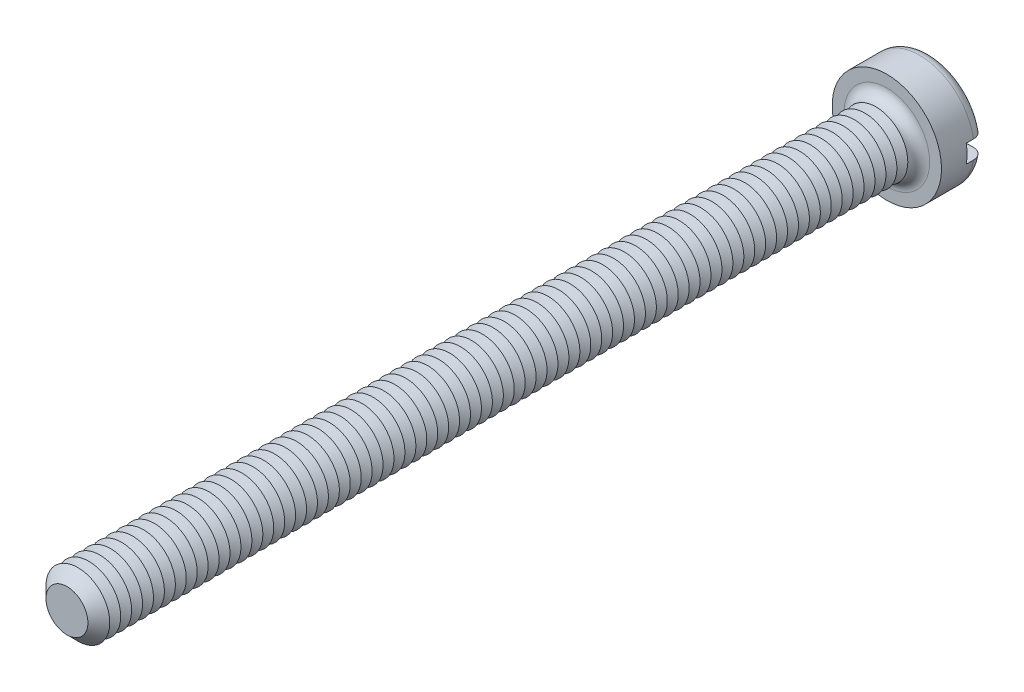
ISO-10303-21;
HEADER;
FILE_DESCRIPTION(('STEP AP214'),'2;1');
FILE_NAME('part.step','',(''),(''),'','','');
FILE_SCHEMA(('AUTOMOTIVE_DESIGN { 1 0 10303 214 1 1 1 1 }'));
ENDSEC;
DATA;
#1=APPLICATION_CONTEXT('core data for automotive mechanical design processes');
#2=APPLICATION_PROTOCOL_DEFINITION('international standard','automotive_design',2000,#1);
#3=PRODUCT_CONTEXT('',#1,'mechanical');
#4=PRODUCT('Part','Part','',(#3));
#5=PRODUCT_RELATED_PRODUCT_CATEGORY('part','',(#4));
#6=PRODUCT_DEFINITION_FORMATION('','',#4);
#7=PRODUCT_DEFINITION_CONTEXT('part definition',#1,'design');
#8=PRODUCT_DEFINITION('design','',#6,#7);
#9=PRODUCT_DEFINITION_SHAPE('','',#8);
#10=(LENGTH_UNIT() NAMED_UNIT(*) SI_UNIT(.MILLI.,.METRE.));
#11=(NAMED_UNIT(*) PLANE_ANGLE_UNIT() SI_UNIT($,.RADIAN.));
#12=(NAMED_UNIT(*) SI_UNIT($,.STERADIAN.) SOLID_ANGLE_UNIT());
#13=UNCERTAINTY_MEASURE_WITH_UNIT(LENGTH_MEASURE(1.E-05),#10,'distance_accuracy_value','');
#14=(GEOMETRIC_REPRESENTATION_CONTEXT(3) GLOBAL_UNCERTAINTY_ASSIGNED_CONTEXT((#13)) GLOBAL_UNIT_ASSIGNED_CONTEXT((#10,
#11,#12)) REPRESENTATION_CONTEXT('',''));
#15=CARTESIAN_POINT('',(0.,0.,0.));
#16=DIRECTION('',(0.,0.,1.));
#17=DIRECTION('',(1.,0.,0.));
#18=AXIS2_PLACEMENT_3D('',#15,#16,#17);
#19=CARTESIAN_POINT('',(0.,0.,-2.4));
#20=DIRECTION('',(0.,0.,1.));
#21=DIRECTION('',(1.,0.,0.));
#22=AXIS2_PLACEMENT_3D('',#19,#20,#21);
#23=PLANE('',#22);
#24=CARTESIAN_POINT('',(0.,0.,-2.4));
#25=DIRECTION('',(0.,0.,1.));
#26=DIRECTION('',(1.,0.,0.));
#27=AXIS2_PLACEMENT_3D('',#24,#25,#26);
#28=CIRCLE('',#27,2.4);
#29=CARTESIAN_POINT('',(-2.3473389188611,0.5,-2.4));
#30=VERTEX_POINT('',#29);
#31=CARTESIAN_POINT('',(2.3473389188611,0.5,-2.4));
#32=VERTEX_POINT('',#31);
#33=EDGE_CURVE('E116',#30,#32,#28,.F.);
#34=ORIENTED_EDGE('',*,*,#33,.T.);
#35=DIRECTION('',(1.,0.,0.));
#36=VECTOR('',#35,1.);
#37=CARTESIAN_POINT('',(-3.,0.5,-2.4));
#38=LINE('',#37,#36);
#39=EDGE_CURVE('E111',#30,#32,#38,.T.);
#40=ORIENTED_EDGE('',*,*,#39,.F.);
#41=EDGE_LOOP('',(#34,#40));
#42=FACE_BOUND('',#41,.T.);
#43=ADVANCED_FACE('F39',(#42),#23,.F.);
#44=CARTESIAN_POINT('',(0.,0.,-1.8));
#45=DIRECTION('',(0.,0.,1.));
#46=DIRECTION('',(1.,0.,0.));
#47=AXIS2_PLACEMENT_3D('',#44,#45,#46);
#48=TOROIDAL_SURFACE('',#47,2.4,0.6);
#49=CARTESIAN_POINT('',(-2.85761641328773,0.5,-2.13010535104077));
#50=CARTESIAN_POINT('',(-2.83871556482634,0.5,-2.1583605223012));
#51=CARTESIAN_POINT('',(-2.81738546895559,0.5,-2.18502342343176));
#52=CARTESIAN_POINT('',(-2.7705148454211,0.5,-2.23439244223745));
#53=CARTESIAN_POINT('',(-2.74496859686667,0.5,-2.25709309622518));
#54=CARTESIAN_POINT('',(-2.6904684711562,0.5,-2.29787524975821));
#55=CARTESIAN_POINT('',(-2.66151863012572,0.5,-2.3159621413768));
#56=CARTESIAN_POINT('',(-2.60103287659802,0.5,-2.34708203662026));
#57=CARTESIAN_POINT('',(-2.56949759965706,0.5,-2.36011627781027));
#58=CARTESIAN_POINT('',(-2.50430694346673,0.5,-2.38095952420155));
#59=CARTESIAN_POINT('',(-2.47062984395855,0.5,-2.38870056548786));
#60=CARTESIAN_POINT('',(-2.40245905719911,0.5,-2.39852415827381));
#61=CARTESIAN_POINT('',(-2.36796525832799,0.5,-2.40060593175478));
#62=CARTESIAN_POINT('',(-2.29850850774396,0.5,-2.39907718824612));
#63=CARTESIAN_POINT('',(-2.2635477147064,0.5,-2.3953679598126));
#64=CARTESIAN_POINT('',(-2.19472542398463,0.5,-2.38219781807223));
#65=CARTESIAN_POINT('',(-2.16086402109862,0.5,-2.37273641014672));
#66=CARTESIAN_POINT('',(-2.09483473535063,0.5,-2.3481926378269));
#67=CARTESIAN_POINT('',(-2.06268841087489,0.5,-2.3330521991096));
#68=CARTESIAN_POINT('',(-2.00140871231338,0.5,-2.29756210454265));
#69=CARTESIAN_POINT('',(-1.97227539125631,0.5,-2.27721235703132));
#70=CARTESIAN_POINT('',(-1.91805676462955,0.5,-2.23196210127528));
#71=CARTESIAN_POINT('',(-1.89294995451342,0.5,-2.20708739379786));
#72=CARTESIAN_POINT('',(-1.84740424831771,0.5,-2.1533758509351));
#73=CARTESIAN_POINT('',(-1.82696468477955,0.5,-2.12453958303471));
#74=CARTESIAN_POINT('',(-1.7919439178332,0.5,-2.06452274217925));
#75=CARTESIAN_POINT('',(-1.7772221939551,0.5,-2.03342424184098));
#76=CARTESIAN_POINT('',(-1.75343025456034,0.5,-1.96913621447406));
#77=CARTESIAN_POINT('',(-1.74435859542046,0.5,-1.93594722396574));
#78=CARTESIAN_POINT('',(-1.73243855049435,0.5,-1.86969199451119));
#79=CARTESIAN_POINT('',(-1.72938008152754,0.5,-1.83666346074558));
#80=CARTESIAN_POINT('',(-1.72896592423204,0.5,-1.77057287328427));
#81=CARTESIAN_POINT('',(-1.73160950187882,0.5,-1.73751082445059));
#82=CARTESIAN_POINT('',(-1.7423966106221,0.5,-1.67291835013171));
#83=CARTESIAN_POINT('',(-1.75043952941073,0.5,-1.64137102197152));
#84=CARTESIAN_POINT('',(-1.77163396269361,0.5,-1.58004446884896));
#85=CARTESIAN_POINT('',(-1.78478577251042,0.5,-1.55026534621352));
#86=CARTESIAN_POINT('',(-1.81598186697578,0.5,-1.49283859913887));
#87=CARTESIAN_POINT('',(-1.83409369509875,0.5,-1.46522772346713));
#88=CARTESIAN_POINT('',(-1.87455179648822,0.5,-1.41330756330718));
#89=CARTESIAN_POINT('',(-1.89689874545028,0.5,-1.38899880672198));
#90=CARTESIAN_POINT('',(-1.94600584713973,0.5,-1.34349499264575));
#91=CARTESIAN_POINT('',(-1.97289034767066,0.5,-1.32243411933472));
#92=CARTESIAN_POINT('',(-2.02972905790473,0.5,-1.28496935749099));
#93=CARTESIAN_POINT('',(-2.05968375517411,0.5,-1.26856621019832));
#94=CARTESIAN_POINT('',(-2.12276894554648,0.5,-1.24040709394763));
#95=CARTESIAN_POINT('',(-2.15596700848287,0.5,-1.22880230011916));
#96=CARTESIAN_POINT('',(-2.22383000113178,0.5,-1.21126311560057));
#97=CARTESIAN_POINT('',(-2.25849504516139,0.5,-1.20532916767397));
#98=CARTESIAN_POINT('',(-2.32870403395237,0.5,-1.1992792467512));
#99=CARTESIAN_POINT('',(-2.36425340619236,0.5,-1.19922586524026));
#100=CARTESIAN_POINT('',(-2.4348506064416,0.5,-1.2051326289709));
#101=CARTESIAN_POINT('',(-2.4698984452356,0.5,-1.21109264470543));
#102=CARTESIAN_POINT('',(-2.53821803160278,0.5,-1.22883658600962));
#103=CARTESIAN_POINT('',(-2.57150081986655,0.5,-1.24057794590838));
#104=CARTESIAN_POINT('',(-2.63557260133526,0.5,-1.2695744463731));
#105=CARTESIAN_POINT('',(-2.66636179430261,0.5,-1.28682914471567));
#106=CARTESIAN_POINT('',(-2.72402406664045,0.5,-1.32606063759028));
#107=CARTESIAN_POINT('',(-2.75095352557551,0.5,-1.34795455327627));
#108=CARTESIAN_POINT('',(-2.80067182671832,0.5,-1.39602603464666));
#109=CARTESIAN_POINT('',(-2.82346106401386,0.5,-1.42220319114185));
#110=CARTESIAN_POINT('',(-2.86383281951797,0.5,-1.47760238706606));
#111=CARTESIAN_POINT('',(-2.88149947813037,0.5,-1.50676312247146));
#112=CARTESIAN_POINT('',(-2.91160874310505,0.5,-1.56766595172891));
#113=CARTESIAN_POINT('',(-2.92405198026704,0.5,-1.59940773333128));
#114=CARTESIAN_POINT('',(-2.94319943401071,0.5,-1.66411282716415));
#115=CARTESIAN_POINT('',(-2.94997843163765,0.5,-1.69705402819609));
#116=CARTESIAN_POINT('',(-2.95787009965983,0.5,-1.7636173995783));
#117=CARTESIAN_POINT('',(-2.95898157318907,0.5,-1.79723971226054));
#118=CARTESIAN_POINT('',(-2.95551354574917,0.5,-1.86397776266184));
#119=CARTESIAN_POINT('',(-2.95096897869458,0.5,-1.89709534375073));
#120=CARTESIAN_POINT('',(-2.93638731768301,0.5,-1.96206785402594));
#121=CARTESIAN_POINT('',(-2.92635713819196,0.5,-1.99392431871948));
#122=CARTESIAN_POINT('',(-2.90618743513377,0.5,-2.04315073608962));
#123=CARTESIAN_POINT('',(-2.89769874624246,0.5,-2.06121519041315));
#124=CARTESIAN_POINT('',(-2.87895753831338,0.5,-2.096404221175));
#125=CARTESIAN_POINT('',(-2.86870503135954,0.5,-2.11352880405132));
#126=CARTESIAN_POINT('',(-2.85761641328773,0.5,-2.13010535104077));
#127=B_SPLINE_CURVE_WITH_KNOTS('',3,(#49,#50,#51,#52,#53,#54,#55,#56,#57,#58,#59,#60,#61,#62,
#63,#64,#65,#66,#67,#68,#69,#70,#71,#72,#73,#74,#75,#76,#77,#78,#79,#80,#81,#82,#83,#84,#85,#86,
#87,#88,#89,#90,#91,#92,#93,#94,#95,#96,#97,#98,#99,#100,#101,#102,#103,#104,#105,#106,#107,
#108,#109,#110,#111,#112,#113,#114,#115,#116,#117,#118,#119,#120,#121,#122,#123,#124,#125,#126),
.UNSPECIFIED.,.T.,.F.,(4,2,2,2,2,2,2,2,2,2,2,2,2,2,2,2,2,2,2,2,2,2,2,2,2,2,2,2,2,2,2,2,2,2,2,2,
2,2,4),(0.,0.101907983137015,0.203955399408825,0.305883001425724,0.407785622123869,
0.510973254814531,0.614175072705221,0.719155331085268,0.824144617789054,0.930238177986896,
1.03633360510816,1.14184204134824,1.24733537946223,1.35004136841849,1.45272110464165,
1.5517448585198,1.65075586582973,1.74797128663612,1.84519232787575,1.9438094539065,
2.0424423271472,2.14443321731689,2.24644032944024,2.35145317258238,2.45647421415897,
2.56261297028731,2.66874944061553,2.77411589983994,2.87947390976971,2.98308820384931,
3.08669260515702,3.18848388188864,3.29026286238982,3.39067588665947,3.49111011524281,
3.59092708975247,3.69061853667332,3.75040561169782,3.81019227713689),.UNSPECIFIED.);
#128=CARTESIAN_POINT('',(-2.95803989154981,0.5,-1.8));
#129=VERTEX_POINT('',#128);
#130=EDGE_CURVE('E763',#129,#30,#127,.T.);
#131=ORIENTED_EDGE('',*,*,#130,.F.);
#132=CARTESIAN_POINT('',(0.,0.,-1.8));
#133=DIRECTION('',(0.,0.,1.));
#134=DIRECTION('',(1.,0.,0.));
#135=AXIS2_PLACEMENT_3D('',#132,#133,#134);
#136=CIRCLE('',#135,3.);
#137=CARTESIAN_POINT('',(2.95803989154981,0.5,-1.8));
#138=VERTEX_POINT('',#137);
#139=EDGE_CURVE('E125',#138,#129,#136,.T.);
#140=ORIENTED_EDGE('',*,*,#139,.F.);
#141=CARTESIAN_POINT('',(1.78664846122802,0.5,-2.05158390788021));
#142=CARTESIAN_POINT('',(1.80142751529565,0.5,-2.08239430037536));
#143=CARTESIAN_POINT('',(1.81889355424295,0.5,-2.111949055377));
#144=CARTESIAN_POINT('',(1.8585933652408,0.5,-2.16770384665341));
#145=CARTESIAN_POINT('',(1.88083491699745,0.5,-2.19389829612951));
#146=CARTESIAN_POINT('',(1.92931942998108,0.5,-2.24217519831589));
#147=CARTESIAN_POINT('',(1.95555471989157,0.5,-2.26426535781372));
#148=CARTESIAN_POINT('',(2.01127789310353,0.5,-2.30384045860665));
#149=CARTESIAN_POINT('',(2.04076488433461,0.5,-2.32132665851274));
#150=CARTESIAN_POINT('',(2.10290022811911,0.5,-2.3516259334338));
#151=CARTESIAN_POINT('',(2.13560600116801,0.5,-2.3643213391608));
#152=CARTESIAN_POINT('',(2.20267136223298,0.5,-2.38412242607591));
#153=CARTESIAN_POINT('',(2.23703118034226,0.5,-2.3912273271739));
#154=CARTESIAN_POINT('',(2.30690186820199,0.5,-2.39969404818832));
#155=CARTESIAN_POINT('',(2.34242185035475,0.5,-2.40098100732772));
#156=CARTESIAN_POINT('',(2.41317063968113,0.5,-2.39753827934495));
#157=CARTESIAN_POINT('',(2.44839945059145,0.5,-2.39280866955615));
#158=CARTESIAN_POINT('',(2.51734146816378,0.5,-2.37746773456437));
#159=CARTESIAN_POINT('',(2.55106223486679,0.5,-2.3668904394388));
#160=CARTESIAN_POINT('',(2.61620389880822,0.5,-2.34013333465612));
#161=CARTESIAN_POINT('',(2.64762498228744,0.5,-2.32395397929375));
#162=CARTESIAN_POINT('',(2.70673284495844,0.5,-2.28672393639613));
#163=CARTESIAN_POINT('',(2.73447138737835,0.5,-2.26575544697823));
#164=CARTESIAN_POINT('',(2.78595339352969,0.5,-2.21938197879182));
#165=CARTESIAN_POINT('',(2.80969724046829,0.5,-2.19397742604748));
#166=CARTESIAN_POINT('',(2.85207235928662,0.5,-2.13993965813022));
#167=CARTESIAN_POINT('',(2.87078674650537,0.5,-2.11137160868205));
#168=CARTESIAN_POINT('',(2.90307455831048,0.5,-2.05146448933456));
#169=CARTESIAN_POINT('',(2.91664841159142,0.5,-2.02012565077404));
#170=CARTESIAN_POINT('',(2.93808283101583,0.5,-1.95603682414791));
#171=CARTESIAN_POINT('',(2.94602016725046,0.5,-1.92331249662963));
#172=CARTESIAN_POINT('',(2.95624273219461,0.5,-1.85699296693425));
#173=CARTESIAN_POINT('',(2.95852824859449,0.5,-1.82339780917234));
#174=CARTESIAN_POINT('',(2.95738171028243,0.5,-1.75655451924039));
#175=CARTESIAN_POINT('',(2.95399174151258,0.5,-1.72330565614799));
#176=CARTESIAN_POINT('',(2.94167749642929,0.5,-1.65784996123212));
#177=CARTESIAN_POINT('',(2.93275329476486,0.5,-1.62564311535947));
#178=CARTESIAN_POINT('',(2.90963870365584,0.5,-1.56317641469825));
#179=CARTESIAN_POINT('',(2.89544787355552,0.5,-1.53291672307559));
#180=CARTESIAN_POINT('',(2.86222325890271,0.5,-1.47518589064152));
#181=CARTESIAN_POINT('',(2.84318935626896,0.5,-1.44771481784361));
#182=CARTESIAN_POINT('',(2.80067851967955,0.5,-1.39611362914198));
#183=CARTESIAN_POINT('',(2.77716960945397,0.5,-1.37200986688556));
#184=CARTESIAN_POINT('',(2.72648704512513,0.5,-1.3280274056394));
#185=CARTESIAN_POINT('',(2.69931317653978,0.5,-1.3081489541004));
#186=CARTESIAN_POINT('',(2.64167967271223,0.5,-1.27288334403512));
#187=CARTESIAN_POINT('',(2.61118015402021,0.5,-1.25756138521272));
#188=CARTESIAN_POINT('',(2.54807315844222,0.5,-1.2321564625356));
#189=CARTESIAN_POINT('',(2.51546550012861,0.5,-1.22207395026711));
#190=CARTESIAN_POINT('',(2.44846246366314,0.5,-1.20724783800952));
#191=CARTESIAN_POINT('',(2.41404584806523,0.5,-1.2026002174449));
#192=CARTESIAN_POINT('',(2.34491756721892,0.5,-1.19904907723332));
#193=CARTESIAN_POINT('',(2.3102058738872,0.5,-1.20014611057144));
#194=CARTESIAN_POINT('',(2.24087507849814,0.5,-1.20808958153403));
#195=CARTESIAN_POINT('',(2.20626660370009,0.5,-1.21502895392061));
#196=CARTESIAN_POINT('',(2.13868705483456,0.5,-1.23457616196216));
#197=CARTESIAN_POINT('',(2.10571611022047,0.5,-1.24718444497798));
#198=CARTESIAN_POINT('',(2.04212010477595,0.5,-1.2778419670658));
#199=CARTESIAN_POINT('',(2.0115131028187,0.5,-1.29592871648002));
#200=CARTESIAN_POINT('',(1.95381117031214,0.5,-1.33703838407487));
#201=CARTESIAN_POINT('',(1.92671618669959,0.5,-1.36006122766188));
#202=CARTESIAN_POINT('',(1.8771749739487,0.5,-1.41014760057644));
#203=CARTESIAN_POINT('',(1.85467966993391,0.5,-1.43716252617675));
#204=CARTESIAN_POINT('',(1.8147167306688,0.5,-1.49468601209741));
#205=CARTESIAN_POINT('',(1.79724791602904,0.5,-1.52519375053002));
#206=CARTESIAN_POINT('',(1.76843420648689,0.5,-1.58782676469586));
#207=CARTESIAN_POINT('',(1.75691546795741,0.5,-1.61987202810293));
#208=CARTESIAN_POINT('',(1.73963101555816,0.5,-1.68548715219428));
#209=CARTESIAN_POINT('',(1.73386545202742,0.5,-1.71905705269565));
#210=CARTESIAN_POINT('',(1.72840927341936,0.5,-1.78556262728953));
#211=CARTESIAN_POINT('',(1.72852416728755,0.5,-1.8184825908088));
#212=CARTESIAN_POINT('',(1.73434422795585,0.5,-1.88379362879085));
#213=CARTESIAN_POINT('',(1.74004181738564,0.5,-1.91618535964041));
#214=CARTESIAN_POINT('',(1.75312909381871,0.5,-1.96568884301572));
#215=CARTESIAN_POINT('',(1.75869685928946,0.5,-1.98330302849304));
#216=CARTESIAN_POINT('',(1.77146455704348,0.5,-2.01792824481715));
#217=CARTESIAN_POINT('',(1.7786644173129,0.5,-2.03493930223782));
#218=CARTESIAN_POINT('',(1.78664846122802,0.5,-2.05158390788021));
#219=B_SPLINE_CURVE_WITH_KNOTS('',3,(#141,#142,#143,#144,#145,#146,#147,#148,#149,#150,#151,
#152,#153,#154,#155,#156,#157,#158,#159,#160,#161,#162,#163,#164,#165,#166,#167,#168,#169,#170,
#171,#172,#173,#174,#175,#176,#177,#178,#179,#180,#181,#182,#183,#184,#185,#186,#187,#188,#189,
#190,#191,#192,#193,#194,#195,#196,#197,#198,#199,#200,#201,#202,#203,#204,#205,#206,#207,#208,
#209,#210,#211,#212,#213,#214,#215,#216,#217,#218),.UNSPECIFIED.,.T.,.F.,(4,2,2,2,2,2,2,2,2,2,2,
2,2,2,2,2,2,2,2,2,2,2,2,2,2,2,2,2,2,2,2,2,2,2,2,2,2,2,4),(0.,0.10244464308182,0.205057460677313,
0.307475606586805,0.409865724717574,0.514628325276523,0.619405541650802,0.72552718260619,
0.831647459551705,0.937156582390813,1.04265715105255,1.1464674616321,1.25026780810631,
1.3522293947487,1.45418247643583,1.55471883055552,1.6552500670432,1.75503912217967,
1.8548268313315,1.95462289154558,2.05442138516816,2.15496174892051,2.25550799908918,
2.35743049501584,2.45936177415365,2.56306719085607,2.66678259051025,2.77217967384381,
2.87758507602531,2.98372914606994,3.08987161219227,3.19481457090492,3.29973288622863,
3.40138228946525,3.50303434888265,3.60132659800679,3.69948562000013,3.75483142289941,
3.8101747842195),.UNSPECIFIED.);
#220=EDGE_CURVE('E765',#32,#138,#219,.T.);
#221=ORIENTED_EDGE('',*,*,#220,.F.);
#222=ORIENTED_EDGE('',*,*,#33,.F.);
#223=EDGE_LOOP('',(#131,#140,#221,#222));
#224=FACE_BOUND('',#223,.T.);
#225=ADVANCED_FACE('F747',(#224),#48,.T.);
#226=CARTESIAN_POINT('',(0.,0.,-2.4));
#227=DIRECTION('',(0.,0.,1.));
#228=DIRECTION('',(1.,0.,0.));
#229=AXIS2_PLACEMENT_3D('',#226,#227,#228);
#230=CYLINDRICAL_SURFACE('',#229,3.);
#231=DIRECTION('',(0.,0.,1.));
#232=VECTOR('',#231,1.);
#233=CARTESIAN_POINT('',(2.95803989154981,0.5,-2.4));
#234=LINE('',#233,#232);
#235=CARTESIAN_POINT('',(2.95803989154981,0.5,-1.4));
#236=VERTEX_POINT('',#235);
#237=EDGE_CURVE('E781',#138,#236,#234,.T.);
#238=ORIENTED_EDGE('',*,*,#237,.F.);
#239=ORIENTED_EDGE('',*,*,#139,.T.);
#240=DIRECTION('',(0.,0.,1.));
#241=VECTOR('',#240,1.);
#242=CARTESIAN_POINT('',(-2.95803989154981,0.5,-2.4));
#243=LINE('',#242,#241);
#244=CARTESIAN_POINT('',(-2.95803989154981,0.5,-1.4));
#245=VERTEX_POINT('',#244);
#246=EDGE_CURVE('E63',#245,#129,#243,.F.);
#247=ORIENTED_EDGE('',*,*,#246,.F.);
#248=CARTESIAN_POINT('',(0.,0.,-1.4));
#249=DIRECTION('',(0.,0.,-1.));
#250=DIRECTION('',(-1.,0.,0.));
#251=AXIS2_PLACEMENT_3D('',#248,#249,#250);
#252=CIRCLE('',#251,3.);
#253=CARTESIAN_POINT('',(-2.95803989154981,-0.5,-1.4));
#254=VERTEX_POINT('',#253);
#255=EDGE_CURVE('E43',#245,#254,#252,.F.);
#256=ORIENTED_EDGE('',*,*,#255,.T.);
#257=DIRECTION('',(0.,0.,1.));
#258=VECTOR('',#257,1.);
#259=CARTESIAN_POINT('',(-2.95803989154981,-0.5,-2.4));
#260=LINE('',#259,#258);
#261=CARTESIAN_POINT('',(-2.9580398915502,-0.5,-1.79999999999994));
#262=VERTEX_POINT('',#261);
#263=EDGE_CURVE('E778',#262,#254,#260,.T.);
#264=ORIENTED_EDGE('',*,*,#263,.F.);
#265=CARTESIAN_POINT('',(2.95803989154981,-0.5,-1.8));
#266=VERTEX_POINT('',#265);
#267=EDGE_CURVE('E127',#262,#266,#136,.T.);
#268=ORIENTED_EDGE('',*,*,#267,.T.);
#269=DIRECTION('',(0.,0.,1.));
#270=VECTOR('',#269,1.);
#271=CARTESIAN_POINT('',(2.95803989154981,-0.5,-2.4));
#272=LINE('',#271,#270);
#273=CARTESIAN_POINT('',(2.95803989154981,-0.5,-1.4));
#274=VERTEX_POINT('',#273);
#275=EDGE_CURVE('E55',#274,#266,#272,.F.);
#276=ORIENTED_EDGE('',*,*,#275,.F.);
#277=EDGE_CURVE('E11',#274,#236,#252,.F.);
#278=ORIENTED_EDGE('',*,*,#277,.T.);
#279=EDGE_LOOP('',(#238,#239,#247,#256,#264,#268,#276,#278));
#280=FACE_BOUND('',#279,.T.);
#281=CARTESIAN_POINT('',(0.,0.,0.));
#282=DIRECTION('',(0.,0.,1.));
#283=DIRECTION('',(1.,0.,0.));
#284=AXIS2_PLACEMENT_3D('',#281,#282,#283);
#285=CIRCLE('',#284,3.);
#286=CARTESIAN_POINT('',(3.,0.,0.));
#287=VERTEX_POINT('',#286);
#288=EDGE_CURVE('E784',#287,#287,#285,.T.);
#289=ORIENTED_EDGE('',*,*,#288,.F.);
#290=EDGE_LOOP('',(#289));
#291=FACE_BOUND('',#290,.T.);
#292=ADVANCED_FACE('F743',(#280,#291),#230,.T.);
#293=CARTESIAN_POINT('',(2.3473389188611,-0.5,-2.4));
#294=VERTEX_POINT('',#293);
#295=CARTESIAN_POINT('',(-2.3473389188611,-0.5,-2.4));
#296=VERTEX_POINT('',#295);
#297=EDGE_CURVE('E109',#294,#296,#28,.F.);
#298=ORIENTED_EDGE('',*,*,#297,.T.);
#299=DIRECTION('',(-1.,0.,0.));
#300=VECTOR('',#299,1.);
#301=CARTESIAN_POINT('',(-3.,-0.5,-2.4));
#302=LINE('',#301,#300);
#303=EDGE_CURVE('E96',#294,#296,#302,.T.);
#304=ORIENTED_EDGE('',*,*,#303,.F.);
#305=EDGE_LOOP('',(#298,#304));
#306=FACE_BOUND('',#305,.T.);
#307=ADVANCED_FACE('F108',(#306),#23,.F.);
#308=CARTESIAN_POINT('',(0.,0.,0.));
#309=DIRECTION('',(0.,0.,1.));
#310=DIRECTION('',(1.,0.,0.));
#311=AXIS2_PLACEMENT_3D('',#308,#309,#310);
#312=PLANE('',#311);
#313=CARTESIAN_POINT('',(0.,0.,0.));
#314=DIRECTION('',(0.,0.,1.));
#315=DIRECTION('',(1.,0.,0.));
#316=AXIS2_PLACEMENT_3D('',#313,#314,#315);
#317=CIRCLE('',#316,2.35);
#318=CARTESIAN_POINT('',(2.35,0.,0.));
#319=VERTEX_POINT('',#318);
#320=EDGE_CURVE('E115',#319,#319,#317,.F.);
#321=ORIENTED_EDGE('',*,*,#320,.T.);
#322=EDGE_LOOP('',(#321));
#323=FACE_BOUND('',#322,.T.);
#324=ORIENTED_EDGE('',*,*,#288,.T.);
#325=EDGE_LOOP('',(#324));
#326=FACE_BOUND('',#325,.T.);
#327=ADVANCED_FACE('F742',(#323,#326),#312,.T.);
#328=CARTESIAN_POINT('',(-2.85761641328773,-0.5,-2.13010535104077));
#329=CARTESIAN_POINT('',(-2.87617085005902,-0.5,-2.10236255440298));
#330=CARTESIAN_POINT('',(-2.89241094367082,-0.5,-2.07304478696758));
#331=CARTESIAN_POINT('',(-2.91975805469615,-0.5,-2.01207835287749));
#332=CARTESIAN_POINT('',(-2.93085958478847,-0.5,-1.98042723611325));
#333=CARTESIAN_POINT('',(-2.94757590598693,-0.5,-1.91570997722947));
#334=CARTESIAN_POINT('',(-2.95319165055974,-0.5,-1.88264408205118));
#335=CARTESIAN_POINT('',(-2.95876526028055,-0.5,-1.81604673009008));
#336=CARTESIAN_POINT('',(-2.95872441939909,-0.5,-1.78251538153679));
#337=CARTESIAN_POINT('',(-2.95300126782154,-0.5,-1.71606888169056));
#338=CARTESIAN_POINT('',(-2.94734076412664,-0.5,-1.68315184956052));
#339=CARTESIAN_POINT('',(-2.93058183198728,-0.5,-1.61873244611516));
#340=CARTESIAN_POINT('',(-2.91948325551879,-0.5,-1.58723011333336));
#341=CARTESIAN_POINT('',(-2.89215903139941,-0.5,-1.52647404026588));
#342=CARTESIAN_POINT('',(-2.87592518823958,-0.5,-1.49722398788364));
#343=CARTESIAN_POINT('',(-2.83881787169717,-0.5,-1.44183365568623));
#344=CARTESIAN_POINT('',(-2.81794425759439,-0.5,-1.41569347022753));
#345=CARTESIAN_POINT('',(-2.77196258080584,-0.5,-1.36700890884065));
#346=CARTESIAN_POINT('',(-2.74681874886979,-0.5,-1.34449832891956));
#347=CARTESIAN_POINT('',(-2.69315595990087,-0.5,-1.30394571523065));
#348=CARTESIAN_POINT('',(-2.66463678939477,-0.5,-1.28590396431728));
#349=CARTESIAN_POINT('',(-2.6045885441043,-0.5,-1.25451133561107));
#350=CARTESIAN_POINT('',(-2.573021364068,-0.5,-1.24123336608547));
#351=CARTESIAN_POINT('',(-2.50813094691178,-0.5,-1.22006271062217));
#352=CARTESIAN_POINT('',(-2.47480755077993,-0.5,-1.21217051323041));
#353=CARTESIAN_POINT('',(-2.40672281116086,-0.5,-1.20185046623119));
#354=CARTESIAN_POINT('',(-2.37194646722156,-0.5,-1.19952155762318));
#355=CARTESIAN_POINT('',(-2.30248663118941,-0.5,-1.20064178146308));
#356=CARTESIAN_POINT('',(-2.26780314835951,-0.5,-1.20409147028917));
#357=CARTESIAN_POINT('',(-2.19896003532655,-0.5,-1.21674803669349));
#358=CARTESIAN_POINT('',(-2.16481620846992,-0.5,-1.22604100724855));
#359=CARTESIAN_POINT('',(-2.09855902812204,-0.5,-1.25020237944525));
#360=CARTESIAN_POINT('',(-2.0664458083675,-0.5,-1.2650711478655));
#361=CARTESIAN_POINT('',(-2.00504979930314,-0.5,-1.3000633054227));
#362=CARTESIAN_POINT('',(-1.97577870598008,-0.5,-1.32020724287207));
#363=CARTESIAN_POINT('',(-1.92109882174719,-0.5,-1.36519538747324));
#364=CARTESIAN_POINT('',(-1.89568984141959,-0.5,-1.39003936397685));
#365=CARTESIAN_POINT('',(-1.84992350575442,-0.5,-1.44333696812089));
#366=CARTESIAN_POINT('',(-1.82949305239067,-0.5,-1.47172774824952));
#367=CARTESIAN_POINT('',(-1.79388305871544,-0.5,-1.53163225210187));
#368=CARTESIAN_POINT('',(-1.77870235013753,-0.5,-1.56314527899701));
#369=CARTESIAN_POINT('',(-1.7545759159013,-0.5,-1.62726698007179));
#370=CARTESIAN_POINT('',(-1.74543784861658,-0.5,-1.65980327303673));
#371=CARTESIAN_POINT('',(-1.73294830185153,-0.5,-1.72596654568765));
#372=CARTESIAN_POINT('',(-1.72959555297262,-0.5,-1.7595932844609));
#373=CARTESIAN_POINT('',(-1.72881879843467,-0.5,-1.82588200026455));
#374=CARTESIAN_POINT('',(-1.73121660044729,-0.5,-1.85854202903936));
#375=CARTESIAN_POINT('',(-1.74148022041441,-0.5,-1.9229888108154));
#376=CARTESIAN_POINT('',(-1.74934586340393,-0.5,-1.95477559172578));
#377=CARTESIAN_POINT('',(-1.77023164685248,-0.5,-2.01650910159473));
#378=CARTESIAN_POINT('',(-1.78323812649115,-0.5,-2.04646046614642));
#379=CARTESIAN_POINT('',(-1.81396733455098,-0.5,-2.10383471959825));
#380=CARTESIAN_POINT('',(-1.83169061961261,-0.5,-2.13125730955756));
#381=CARTESIAN_POINT('',(-1.87183626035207,-0.5,-2.18359240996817));
#382=CARTESIAN_POINT('',(-1.89437158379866,-0.5,-2.20841820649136));
#383=CARTESIAN_POINT('',(-1.9431646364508,-0.5,-2.25409214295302));
#384=CARTESIAN_POINT('',(-1.96942301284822,-0.5,-2.27493958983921));
#385=CARTESIAN_POINT('',(-2.025898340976,-0.5,-2.31281042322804));
#386=CARTESIAN_POINT('',(-2.05622082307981,-0.5,-2.32967654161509));
#387=CARTESIAN_POINT('',(-2.11922391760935,-0.5,-2.35820255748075));
#388=CARTESIAN_POINT('',(-2.15190483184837,-0.5,-2.3698617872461));
#389=CARTESIAN_POINT('',(-2.21944675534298,-0.5,-2.38785911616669));
#390=CARTESIAN_POINT('',(-2.25433929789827,-0.5,-2.39407914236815));
#391=CARTESIAN_POINT('',(-2.32467357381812,-0.5,-2.40058243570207));
#392=CARTESIAN_POINT('',(-2.36011530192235,-0.5,-2.40086575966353));
#393=CARTESIAN_POINT('',(-2.43058129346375,-0.5,-2.39545061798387));
#394=CARTESIAN_POINT('',(-2.46560504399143,-0.5,-2.38974544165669));
#395=CARTESIAN_POINT('',(-2.53418188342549,-0.5,-2.37245602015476));
#396=CARTESIAN_POINT('',(-2.56773468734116,-0.5,-2.36087064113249));
#397=CARTESIAN_POINT('',(-2.63195003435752,-0.5,-2.33229154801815));
#398=CARTESIAN_POINT('',(-2.66264330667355,-0.5,-2.31536681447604));
#399=CARTESIAN_POINT('',(-2.72065333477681,-0.5,-2.2765252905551));
#400=CARTESIAN_POINT('',(-2.7479744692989,-0.5,-2.25461508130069));
#401=CARTESIAN_POINT('',(-2.78903570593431,-0.5,-2.21539504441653));
#402=CARTESIAN_POINT('',(-2.80405150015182,-0.5,-2.19939833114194));
#403=CARTESIAN_POINT('',(-2.83224965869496,-0.5,-2.16586257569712));
#404=CARTESIAN_POINT('',(-2.84543204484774,-0.5,-2.14832355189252));
#405=CARTESIAN_POINT('',(-2.85761641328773,-0.5,-2.13010535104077));
#406=B_SPLINE_CURVE_WITH_KNOTS('',3,(#328,#329,#330,#331,#332,#333,#334,#335,#336,#337,#338,
#339,#340,#341,#342,#343,#344,#345,#346,#347,#348,#349,#350,#351,#352,#353,#354,#355,#356,#357,
#358,#359,#360,#361,#362,#363,#364,#365,#366,#367,#368,#369,#370,#371,#372,#373,#374,#375,#376,
#377,#378,#379,#380,#381,#382,#383,#384,#385,#386,#387,#388,#389,#390,#391,#392,#393,#394,#395,
#396,#397,#398,#399,#400,#401,#402,#403,#404,#405),.UNSPECIFIED.,.T.,.F.,(4,2,2,2,2,2,2,2,2,2,2,
2,2,2,2,2,2,2,2,2,2,2,2,2,2,2,2,2,2,2,2,2,2,2,2,2,2,2,4),(0.,0.100047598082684,
0.200201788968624,0.300338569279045,0.400452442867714,0.500179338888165,0.599908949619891,
0.699798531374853,0.799691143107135,0.900465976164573,1.00124718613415,1.10351091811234,
1.20578392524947,1.30986270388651,1.41395150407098,1.51961105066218,1.62527754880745,
1.73136193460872,1.83744111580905,1.94185359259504,2.04624281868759,2.1471248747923,
2.24798479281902,2.34575994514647,2.44353196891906,2.541045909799,2.63857136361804,
2.73870431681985,2.83885469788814,2.94247024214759,3.0460990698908,3.15192527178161,
3.25775046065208,3.36369436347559,3.46965870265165,3.57430655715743,3.67881706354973,
3.74451732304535,3.81021680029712),.UNSPECIFIED.);
#407=EDGE_CURVE('E103',#296,#262,#406,.T.);
#408=ORIENTED_EDGE('',*,*,#407,.F.);
#409=ORIENTED_EDGE('',*,*,#297,.F.);
#410=CARTESIAN_POINT('',(1.78664846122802,-0.5,-2.05158390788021));
#411=CARTESIAN_POINT('',(1.77253256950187,-0.5,-2.02214917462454));
#412=CARTESIAN_POINT('',(1.76084795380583,-0.5,-1.99152692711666));
#413=CARTESIAN_POINT('',(1.74276267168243,-0.5,-1.92873811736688));
#414=CARTESIAN_POINT('',(1.73636622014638,-0.5,-1.89657034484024));
#415=CARTESIAN_POINT('',(1.72910271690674,-0.5,-1.83160458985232));
#416=CARTESIAN_POINT('',(1.72823699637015,-0.5,-1.79880645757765));
#417=CARTESIAN_POINT('',(1.73207277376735,-0.5,-1.73354460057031));
#418=CARTESIAN_POINT('',(1.7367732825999,-0.5,-1.70108081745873));
#419=CARTESIAN_POINT('',(1.75151033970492,-0.5,-1.63763571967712));
#420=CARTESIAN_POINT('',(1.76150868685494,-0.5,-1.60664550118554));
#421=CARTESIAN_POINT('',(1.78646773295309,-0.5,-1.54673433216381));
#422=CARTESIAN_POINT('',(1.80142897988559,-0.5,-1.51781361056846));
#423=CARTESIAN_POINT('',(1.8361687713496,-0.5,-1.46223275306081));
#424=CARTESIAN_POINT('',(1.85603637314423,-0.5,-1.43562834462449));
#425=CARTESIAN_POINT('',(1.89981598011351,-0.5,-1.38598822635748));
#426=CARTESIAN_POINT('',(1.92372865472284,-0.5,-1.3629531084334));
#427=CARTESIAN_POINT('',(1.97581791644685,-0.5,-1.32025912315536));
#428=CARTESIAN_POINT('',(2.00411431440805,-0.5,-1.30074638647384));
#429=CARTESIAN_POINT('',(2.06351340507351,-0.5,-1.26660223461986));
#430=CARTESIAN_POINT('',(2.09461651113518,-0.5,-1.2519715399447));
#431=CARTESIAN_POINT('',(2.15964055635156,-0.5,-1.22763649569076));
#432=CARTESIAN_POINT('',(2.19361437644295,-0.5,-1.21807321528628));
#433=CARTESIAN_POINT('',(2.26268197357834,-0.5,-1.20474094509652));
#434=CARTESIAN_POINT('',(2.29777581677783,-0.5,-1.20097229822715));
#435=CARTESIAN_POINT('',(2.36834397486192,-0.5,-1.19935270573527));
#436=CARTESIAN_POINT('',(2.40381924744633,-0.5,-1.20154258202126));
#437=CARTESIAN_POINT('',(2.47388621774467,-0.5,-1.211906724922));
#438=CARTESIAN_POINT('',(2.50847794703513,-0.5,-1.22008077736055));
#439=CARTESIAN_POINT('',(2.57542869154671,-0.5,-1.24211740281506));
#440=CARTESIAN_POINT('',(2.60780612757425,-0.5,-1.25592395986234));
#441=CARTESIAN_POINT('',(2.66972487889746,-0.5,-1.28886991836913));
#442=CARTESIAN_POINT('',(2.69926644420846,-0.5,-1.3080088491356));
#443=CARTESIAN_POINT('',(2.75412764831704,-0.5,-1.35072337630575));
#444=CARTESIAN_POINT('',(2.77951140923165,-0.5,-1.37421661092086));
#445=CARTESIAN_POINT('',(2.82588981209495,-0.5,-1.42519687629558));
#446=CARTESIAN_POINT('',(2.84688487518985,-0.5,-1.4526835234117));
#447=CARTESIAN_POINT('',(2.88351678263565,-0.5,-1.51036368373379));
#448=CARTESIAN_POINT('',(2.89923879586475,-0.5,-1.54050312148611));
#449=CARTESIAN_POINT('',(2.92532780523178,-0.5,-1.60301687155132));
#450=CARTESIAN_POINT('',(2.93569520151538,-0.5,-1.63539101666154));
#451=CARTESIAN_POINT('',(2.95066155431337,-0.5,-1.70102985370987));
#452=CARTESIAN_POINT('',(2.95532930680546,-0.5,-1.73427887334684));
#453=CARTESIAN_POINT('',(2.9589838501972,-0.5,-1.80108716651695));
#454=CARTESIAN_POINT('',(2.95797087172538,-0.5,-1.83464642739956));
#455=CARTESIAN_POINT('',(2.9503157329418,-0.5,-1.90093629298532));
#456=CARTESIAN_POINT('',(2.9437032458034,-0.5,-1.93367033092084));
#457=CARTESIAN_POINT('',(2.92508830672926,-0.5,-1.99756717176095));
#458=CARTESIAN_POINT('',(2.91308586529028,-0.5,-2.02872997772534));
#459=CARTESIAN_POINT('',(2.88401713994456,-0.5,-2.08868263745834));
#460=CARTESIAN_POINT('',(2.86693946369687,-0.5,-2.11746696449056));
#461=CARTESIAN_POINT('',(2.82823635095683,-0.5,-2.17179415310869));
#462=CARTESIAN_POINT('',(2.80661076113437,-0.5,-2.19733690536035));
#463=CARTESIAN_POINT('',(2.75921750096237,-0.5,-2.24472182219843));
#464=CARTESIAN_POINT('',(2.73341278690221,-0.5,-2.26652692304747));
#465=CARTESIAN_POINT('',(2.67855512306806,-0.5,-2.30557116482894));
#466=CARTESIAN_POINT('',(2.64950194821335,-0.5,-2.32280998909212));
#467=CARTESIAN_POINT('',(2.58850670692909,-0.5,-2.35251615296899));
#468=CARTESIAN_POINT('',(2.55652763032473,-0.5,-2.36490748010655));
#469=CARTESIAN_POINT('',(2.4909651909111,-0.5,-2.38424946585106));
#470=CARTESIAN_POINT('',(2.45738167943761,-0.5,-2.39119961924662));
#471=CARTESIAN_POINT('',(2.38892891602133,-0.5,-2.39958830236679));
#472=CARTESIAN_POINT('',(2.35404742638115,-0.5,-2.40092701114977));
#473=CARTESIAN_POINT('',(2.28454389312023,-0.5,-2.39781917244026));
#474=CARTESIAN_POINT('',(2.24992186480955,-0.5,-2.39337228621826));
#475=CARTESIAN_POINT('',(2.18139250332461,-0.5,-2.37872879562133));
#476=CARTESIAN_POINT('',(2.14750264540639,-0.5,-2.36845030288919));
#477=CARTESIAN_POINT('',(2.08190943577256,-0.5,-2.34236291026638));
#478=CARTESIAN_POINT('',(2.05020675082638,-0.5,-2.32655233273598));
#479=CARTESIAN_POINT('',(1.98982495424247,-0.5,-2.28976285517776));
#480=CARTESIAN_POINT('',(1.96115527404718,-0.5,-2.26876847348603));
#481=CARTESIAN_POINT('',(1.90785147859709,-0.5,-2.22220002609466));
#482=CARTESIAN_POINT('',(1.88321231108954,-0.5,-2.19663177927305));
#483=CARTESIAN_POINT('',(1.84638483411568,-0.5,-2.15106161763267));
#484=CARTESIAN_POINT('',(1.8328227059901,-0.5,-2.13215328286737));
#485=CARTESIAN_POINT('',(1.80797918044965,-0.5,-2.09289185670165));
#486=CARTESIAN_POINT('',(1.79669771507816,-0.5,-2.07253880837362));
#487=CARTESIAN_POINT('',(1.78664846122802,-0.5,-2.05158390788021));
#488=B_SPLINE_CURVE_WITH_KNOTS('',3,(#410,#411,#412,#413,#414,#415,#416,#417,#418,#419,#420,
#421,#422,#423,#424,#425,#426,#427,#428,#429,#430,#431,#432,#433,#434,#435,#436,#437,#438,#439,
#440,#441,#442,#443,#444,#445,#446,#447,#448,#449,#450,#451,#452,#453,#454,#455,#456,#457,#458,
#459,#460,#461,#462,#463,#464,#465,#466,#467,#468,#469,#470,#471,#472,#473,#474,#475,#476,#477,
#478,#479,#480,#481,#482,#483,#484,#485,#486,#487),.UNSPECIFIED.,.T.,.F.,(4,2,2,2,2,2,2,2,2,2,2,
2,2,2,2,2,2,2,2,2,2,2,2,2,2,2,2,2,2,2,2,2,2,2,2,2,2,2,4),(0.,0.0978512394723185,0.19578039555,
0.293733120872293,0.391668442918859,0.488907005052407,0.58615630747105,0.685320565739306,
0.784501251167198,0.887148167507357,0.989810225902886,1.09519726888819,1.20059054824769,
1.30670769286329,1.41282103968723,1.51790384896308,1.62297738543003,1.72623563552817,
1.82948397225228,1.93097382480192,2.03245609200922,2.13270093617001,2.23294171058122,
2.33265458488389,2.43236726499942,2.53230548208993,2.63224706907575,2.73312861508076,
2.83401715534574,2.93642973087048,3.03885181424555,3.14308833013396,3.24733094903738,
3.35307493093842,3.45885100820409,3.56494689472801,3.67090875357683,3.74057217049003,
3.81023351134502),.UNSPECIFIED.);
#489=EDGE_CURVE('E92',#266,#294,#488,.T.);
#490=ORIENTED_EDGE('',*,*,#489,.F.);
#491=ORIENTED_EDGE('',*,*,#267,.F.);
#492=EDGE_LOOP('',(#408,#409,#490,#491));
#493=FACE_BOUND('',#492,.T.);
#494=ADVANCED_FACE('F113',(#493),#48,.T.);
#495=CARTESIAN_POINT('',(0.,0.,0.600000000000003));
#496=DIRECTION('',(0.,0.,1.));
#497=DIRECTION('',(1.,0.,0.));
#498=AXIS2_PLACEMENT_3D('',#495,#496,#497);
#499=TOROIDAL_SURFACE('',#498,2.35,0.6);
#500=ORIENTED_EDGE('',*,*,#320,.F.);
#501=EDGE_LOOP('',(#500));
#502=FACE_BOUND('',#501,.T.);
#503=CARTESIAN_POINT('',(0.,0.,0.600000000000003));
#504=DIRECTION('',(0.,0.,-1.));
#505=DIRECTION('',(-1.,0.,0.));
#506=AXIS2_PLACEMENT_3D('',#503,#504,#505);
#507=CIRCLE('',#506,1.75);
#508=CARTESIAN_POINT('',(-1.75,0.,0.600000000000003));
#509=VERTEX_POINT('',#508);
#510=EDGE_CURVE('E790',#509,#509,#507,.T.);
#511=ORIENTED_EDGE('',*,*,#510,.T.);
#512=EDGE_LOOP('',(#511));
#513=FACE_BOUND('',#512,.T.);
#514=ADVANCED_FACE('F735',(#502,#513),#499,.F.);
#515=CARTESIAN_POINT('',(0.,0.,0.900000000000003));
#516=DIRECTION('',(0.,0.,-1.));
#517=DIRECTION('',(-1.,0.,0.));
#518=AXIS2_PLACEMENT_3D('',#515,#516,#517);
#519=CONICAL_SURFACE('',#518,1.23038475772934,1.0471975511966);
#520=ORIENTED_EDGE('',*,*,#510,.F.);
#521=EDGE_LOOP('',(#520));
#522=FACE_BOUND('',#521,.T.);
#523=CARTESIAN_POINT('',(0.,0.,0.900000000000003));
#524=DIRECTION('',(0.,0.,-1.));
#525=DIRECTION('',(-1.,0.,0.));
#526=AXIS2_PLACEMENT_3D('',#523,#524,#525);
#527=CIRCLE('',#526,1.23038475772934);
#528=CARTESIAN_POINT('',(-1.23038475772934,0.,0.900000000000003));
#529=VERTEX_POINT('',#528);
#530=EDGE_CURVE('E797',#529,#529,#527,.T.);
#531=ORIENTED_EDGE('',*,*,#530,.T.);
#532=EDGE_LOOP('',(#531));
#533=FACE_BOUND('',#532,.T.);
#534=ADVANCED_FACE('F731',(#522,#533),#519,.T.);
#535=CARTESIAN_POINT('',(0.,0.,1.2));
#536=DIRECTION('',(0.,0.,1.));
#537=DIRECTION('',(1.,0.,0.));
#538=AXIS2_PLACEMENT_3D('',#535,#536,#537);
#539=CONICAL_SURFACE('',#538,1.75,1.0471975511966);
#540=ORIENTED_EDGE('',*,*,#530,.F.);
#541=EDGE_LOOP('',(#540));
#542=FACE_BOUND('',#541,.T.);
#543=CARTESIAN_POINT('',(0.,0.,1.2));
#544=DIRECTION('',(0.,0.,-1.));
#545=DIRECTION('',(-1.,0.,0.));
#546=AXIS2_PLACEMENT_3D('',#543,#544,#545);
#547=CIRCLE('',#546,1.75);
#548=CARTESIAN_POINT('',(-1.75,0.,1.2));
#549=VERTEX_POINT('',#548);
#550=EDGE_CURVE('E802',#549,#549,#547,.T.);
#551=ORIENTED_EDGE('',*,*,#550,.T.);
#552=EDGE_LOOP('',(#551));
#553=FACE_BOUND('',#552,.T.);
#554=ADVANCED_FACE('F727',(#542,#553),#539,.T.);
#555=CARTESIAN_POINT('',(0.,0.,1.5));
#556=DIRECTION('',(0.,0.,-1.));
#557=DIRECTION('',(-1.,0.,0.));
#558=AXIS2_PLACEMENT_3D('',#555,#556,#557);
#559=CONICAL_SURFACE('',#558,1.23038475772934,1.0471975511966);
#560=ORIENTED_EDGE('',*,*,#550,.F.);
#561=EDGE_LOOP('',(#560));
#562=FACE_BOUND('',#561,.T.);
#563=CARTESIAN_POINT('',(0.,0.,1.5));
#564=DIRECTION('',(0.,0.,-1.));
#565=DIRECTION('',(-1.,0.,0.));
#566=AXIS2_PLACEMENT_3D('',#563,#564,#565);
#567=CIRCLE('',#566,1.23038475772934);
#568=CARTESIAN_POINT('',(-1.23038475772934,0.,1.5));
#569=VERTEX_POINT('',#568);
#570=EDGE_CURVE('E806',#569,#569,#567,.T.);
#571=ORIENTED_EDGE('',*,*,#570,.T.);
#572=EDGE_LOOP('',(#571));
#573=FACE_BOUND('',#572,.T.);
#574=ADVANCED_FACE('F723',(#562,#573),#559,.T.);
#575=CARTESIAN_POINT('',(0.,0.,1.8));
#576=DIRECTION('',(0.,0.,1.));
#577=DIRECTION('',(1.,0.,0.));
#578=AXIS2_PLACEMENT_3D('',#575,#576,#577);
#579=CONICAL_SURFACE('',#578,1.75,1.0471975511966);
#580=ORIENTED_EDGE('',*,*,#570,.F.);
#581=EDGE_LOOP('',(#580));
#582=FACE_BOUND('',#581,.T.);
#583=CARTESIAN_POINT('',(0.,0.,1.8));
#584=DIRECTION('',(0.,0.,-1.));
#585=DIRECTION('',(-1.,0.,0.));
#586=AXIS2_PLACEMENT_3D('',#583,#584,#585);
#587=CIRCLE('',#586,1.75);
#588=CARTESIAN_POINT('',(-1.75,0.,1.8));
#589=VERTEX_POINT('',#588);
#590=EDGE_CURVE('E810',#589,#589,#587,.T.);
#591=ORIENTED_EDGE('',*,*,#590,.T.);
#592=EDGE_LOOP('',(#591));
#593=FACE_BOUND('',#592,.T.);
#594=ADVANCED_FACE('F719',(#582,#593),#579,.T.);
#595=CARTESIAN_POINT('',(0.,0.,2.1));
#596=DIRECTION('',(0.,0.,-1.));
#597=DIRECTION('',(-1.,0.,0.));
#598=AXIS2_PLACEMENT_3D('',#595,#596,#597);
#599=CONICAL_SURFACE('',#598,1.23038475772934,1.0471975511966);
#600=ORIENTED_EDGE('',*,*,#590,.F.);
#601=EDGE_LOOP('',(#600));
#602=FACE_BOUND('',#601,.T.);
#603=CARTESIAN_POINT('',(0.,0.,2.1));
#604=DIRECTION('',(0.,0.,-1.));
#605=DIRECTION('',(-1.,0.,0.));
#606=AXIS2_PLACEMENT_3D('',#603,#604,#605);
#607=CIRCLE('',#606,1.23038475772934);
#608=CARTESIAN_POINT('',(-1.23038475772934,0.,2.1));
#609=VERTEX_POINT('',#608);
#610=EDGE_CURVE('E813',#609,#609,#607,.T.);
#611=ORIENTED_EDGE('',*,*,#610,.T.);
#612=EDGE_LOOP('',(#611));
#613=FACE_BOUND('',#612,.T.);
#614=ADVANCED_FACE('F715',(#602,#613),#599,.T.);
#615=CARTESIAN_POINT('',(0.,0.,2.4));
#616=DIRECTION('',(0.,0.,1.));
#617=DIRECTION('',(1.,0.,0.));
#618=AXIS2_PLACEMENT_3D('',#615,#616,#617);
#619=CONICAL_SURFACE('',#618,1.75,1.0471975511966);
#620=ORIENTED_EDGE('',*,*,#610,.F.);
#621=EDGE_LOOP('',(#620));
#622=FACE_BOUND('',#621,.T.);
#623=CARTESIAN_POINT('',(0.,0.,2.4));
#624=DIRECTION('',(0.,0.,-1.));
#625=DIRECTION('',(-1.,0.,0.));
#626=AXIS2_PLACEMENT_3D('',#623,#624,#625);
#627=CIRCLE('',#626,1.75);
#628=CARTESIAN_POINT('',(-1.75,0.,2.4));
#629=VERTEX_POINT('',#628);
#630=EDGE_CURVE('E817',#629,#629,#627,.T.);
#631=ORIENTED_EDGE('',*,*,#630,.T.);
#632=EDGE_LOOP('',(#631));
#633=FACE_BOUND('',#632,.T.);
#634=ADVANCED_FACE('F711',(#622,#633),#619,.T.);
#635=CARTESIAN_POINT('',(0.,0.,2.7));
#636=DIRECTION('',(0.,0.,-1.));
#637=DIRECTION('',(-1.,0.,0.));
#638=AXIS2_PLACEMENT_3D('',#635,#636,#637);
#639=CONICAL_SURFACE('',#638,1.23038475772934,1.0471975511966);
#640=ORIENTED_EDGE('',*,*,#630,.F.);
#641=EDGE_LOOP('',(#640));
#642=FACE_BOUND('',#641,.T.);
#643=CARTESIAN_POINT('',(0.,0.,2.7));
#644=DIRECTION('',(0.,0.,-1.));
#645=DIRECTION('',(-1.,0.,0.));
#646=AXIS2_PLACEMENT_3D('',#643,#644,#645);
#647=CIRCLE('',#646,1.23038475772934);
#648=CARTESIAN_POINT('',(-1.23038475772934,0.,2.7));
#649=VERTEX_POINT('',#648);
#650=EDGE_CURVE('E821',#649,#649,#647,.T.);
#651=ORIENTED_EDGE('',*,*,#650,.T.);
#652=EDGE_LOOP('',(#651));
#653=FACE_BOUND('',#652,.T.);
#654=ADVANCED_FACE('F707',(#642,#653),#639,.T.);
#655=CARTESIAN_POINT('',(0.,0.,3.));
#656=DIRECTION('',(0.,0.,1.));
#657=DIRECTION('',(1.,0.,0.));
#658=AXIS2_PLACEMENT_3D('',#655,#656,#657);
#659=CONICAL_SURFACE('',#658,1.75,1.0471975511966);
#660=ORIENTED_EDGE('',*,*,#650,.F.);
#661=EDGE_LOOP('',(#660));
#662=FACE_BOUND('',#661,.T.);
#663=CARTESIAN_POINT('',(0.,0.,3.));
#664=DIRECTION('',(0.,0.,-1.));
#665=DIRECTION('',(-1.,0.,0.));
#666=AXIS2_PLACEMENT_3D('',#663,#664,#665);
#667=CIRCLE('',#666,1.75);
#668=CARTESIAN_POINT('',(-1.75,0.,3.));
#669=VERTEX_POINT('',#668);
#670=EDGE_CURVE('E825',#669,#669,#667,.T.);
#671=ORIENTED_EDGE('',*,*,#670,.T.);
#672=EDGE_LOOP('',(#671));
#673=FACE_BOUND('',#672,.T.);
#674=ADVANCED_FACE('F703',(#662,#673),#659,.T.);
#675=CARTESIAN_POINT('',(0.,0.,3.3));
#676=DIRECTION('',(0.,0.,-1.));
#677=DIRECTION('',(-1.,0.,0.));
#678=AXIS2_PLACEMENT_3D('',#675,#676,#677);
#679=CONICAL_SURFACE('',#678,1.23038475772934,1.0471975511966);
#680=ORIENTED_EDGE('',*,*,#670,.F.);
#681=EDGE_LOOP('',(#680));
#682=FACE_BOUND('',#681,.T.);
#683=CARTESIAN_POINT('',(0.,0.,3.3));
#684=DIRECTION('',(0.,0.,-1.));
#685=DIRECTION('',(-1.,0.,0.));
#686=AXIS2_PLACEMENT_3D('',#683,#684,#685);
#687=CIRCLE('',#686,1.23038475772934);
#688=CARTESIAN_POINT('',(-1.23038475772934,0.,3.3));
#689=VERTEX_POINT('',#688);
#690=EDGE_CURVE('E829',#689,#689,#687,.T.);
#691=ORIENTED_EDGE('',*,*,#690,.T.);
#692=EDGE_LOOP('',(#691));
#693=FACE_BOUND('',#692,.T.);
#694=ADVANCED_FACE('F699',(#682,#693),#679,.T.);
#695=CARTESIAN_POINT('',(0.,0.,3.6));
#696=DIRECTION('',(0.,0.,1.));
#697=DIRECTION('',(1.,0.,0.));
#698=AXIS2_PLACEMENT_3D('',#695,#696,#697);
#699=CONICAL_SURFACE('',#698,1.75,1.0471975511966);
#700=ORIENTED_EDGE('',*,*,#690,.F.);
#701=EDGE_LOOP('',(#700));
#702=FACE_BOUND('',#701,.T.);
#703=CARTESIAN_POINT('',(0.,0.,3.6));
#704=DIRECTION('',(0.,0.,-1.));
#705=DIRECTION('',(-1.,0.,0.));
#706=AXIS2_PLACEMENT_3D('',#703,#704,#705);
#707=CIRCLE('',#706,1.75);
#708=CARTESIAN_POINT('',(-1.75,0.,3.6));
#709=VERTEX_POINT('',#708);
#710=EDGE_CURVE('E833',#709,#709,#707,.T.);
#711=ORIENTED_EDGE('',*,*,#710,.T.);
#712=EDGE_LOOP('',(#711));
#713=FACE_BOUND('',#712,.T.);
#714=ADVANCED_FACE('F695',(#702,#713),#699,.T.);
#715=CARTESIAN_POINT('',(0.,0.,3.9));
#716=DIRECTION('',(0.,0.,-1.));
#717=DIRECTION('',(-1.,0.,0.));
#718=AXIS2_PLACEMENT_3D('',#715,#716,#717);
#719=CONICAL_SURFACE('',#718,1.23038475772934,1.0471975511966);
#720=ORIENTED_EDGE('',*,*,#710,.F.);
#721=EDGE_LOOP('',(#720));
#722=FACE_BOUND('',#721,.T.);
#723=CARTESIAN_POINT('',(0.,0.,3.9));
#724=DIRECTION('',(0.,0.,-1.));
#725=DIRECTION('',(-1.,0.,0.));
#726=AXIS2_PLACEMENT_3D('',#723,#724,#725);
#727=CIRCLE('',#726,1.23038475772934);
#728=CARTESIAN_POINT('',(-1.23038475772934,0.,3.9));
#729=VERTEX_POINT('',#728);
#730=EDGE_CURVE('E837',#729,#729,#727,.T.);
#731=ORIENTED_EDGE('',*,*,#730,.T.);
#732=EDGE_LOOP('',(#731));
#733=FACE_BOUND('',#732,.T.);
#734=ADVANCED_FACE('F691',(#722,#733),#719,.T.);
#735=CARTESIAN_POINT('',(0.,0.,4.2));
#736=DIRECTION('',(0.,0.,1.));
#737=DIRECTION('',(1.,0.,0.));
#738=AXIS2_PLACEMENT_3D('',#735,#736,#737);
#739=CONICAL_SURFACE('',#738,1.75,1.0471975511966);
#740=ORIENTED_EDGE('',*,*,#730,.F.);
#741=EDGE_LOOP('',(#740));
#742=FACE_BOUND('',#741,.T.);
#743=CARTESIAN_POINT('',(0.,0.,4.2));
#744=DIRECTION('',(0.,0.,-1.));
#745=DIRECTION('',(-1.,0.,0.));
#746=AXIS2_PLACEMENT_3D('',#743,#744,#745);
#747=CIRCLE('',#746,1.75);
#748=CARTESIAN_POINT('',(-1.75,0.,4.2));
#749=VERTEX_POINT('',#748);
#750=EDGE_CURVE('E841',#749,#749,#747,.T.);
#751=ORIENTED_EDGE('',*,*,#750,.T.);
#752=EDGE_LOOP('',(#751));
#753=FACE_BOUND('',#752,.T.);
#754=ADVANCED_FACE('F687',(#742,#753),#739,.T.);
#755=CARTESIAN_POINT('',(0.,0.,4.5));
#756=DIRECTION('',(0.,0.,-1.));
#757=DIRECTION('',(-1.,0.,0.));
#758=AXIS2_PLACEMENT_3D('',#755,#756,#757);
#759=CONICAL_SURFACE('',#758,1.23038475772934,1.0471975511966);
#760=ORIENTED_EDGE('',*,*,#750,.F.);
#761=EDGE_LOOP('',(#760));
#762=FACE_BOUND('',#761,.T.);
#763=CARTESIAN_POINT('',(0.,0.,4.5));
#764=DIRECTION('',(0.,0.,-1.));
#765=DIRECTION('',(-1.,0.,0.));
#766=AXIS2_PLACEMENT_3D('',#763,#764,#765);
#767=CIRCLE('',#766,1.23038475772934);
#768=CARTESIAN_POINT('',(-1.23038475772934,0.,4.5));
#769=VERTEX_POINT('',#768);
#770=EDGE_CURVE('E844',#769,#769,#767,.T.);
#771=ORIENTED_EDGE('',*,*,#770,.T.);
#772=EDGE_LOOP('',(#771));
#773=FACE_BOUND('',#772,.T.);
#774=ADVANCED_FACE('F683',(#762,#773),#759,.T.);
#775=CARTESIAN_POINT('',(0.,0.,4.8));
#776=DIRECTION('',(0.,0.,1.));
#777=DIRECTION('',(1.,0.,0.));
#778=AXIS2_PLACEMENT_3D('',#775,#776,#777);
#779=CONICAL_SURFACE('',#778,1.75,1.0471975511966);
#780=ORIENTED_EDGE('',*,*,#770,.F.);
#781=EDGE_LOOP('',(#780));
#782=FACE_BOUND('',#781,.T.);
#783=CARTESIAN_POINT('',(0.,0.,4.8));
#784=DIRECTION('',(0.,0.,-1.));
#785=DIRECTION('',(-1.,0.,0.));
#786=AXIS2_PLACEMENT_3D('',#783,#784,#785);
#787=CIRCLE('',#786,1.75);
#788=CARTESIAN_POINT('',(-1.75,0.,4.8));
#789=VERTEX_POINT('',#788);
#790=EDGE_CURVE('E848',#789,#789,#787,.T.);
#791=ORIENTED_EDGE('',*,*,#790,.T.);
#792=EDGE_LOOP('',(#791));
#793=FACE_BOUND('',#792,.T.);
#794=ADVANCED_FACE('F679',(#782,#793),#779,.T.);
#795=CARTESIAN_POINT('',(0.,0.,5.1));
#796=DIRECTION('',(0.,0.,-1.));
#797=DIRECTION('',(-1.,0.,0.));
#798=AXIS2_PLACEMENT_3D('',#795,#796,#797);
#799=CONICAL_SURFACE('',#798,1.23038475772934,1.0471975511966);
#800=ORIENTED_EDGE('',*,*,#790,.F.);
#801=EDGE_LOOP('',(#800));
#802=FACE_BOUND('',#801,.T.);
#803=CARTESIAN_POINT('',(0.,0.,5.1));
#804=DIRECTION('',(0.,0.,-1.));
#805=DIRECTION('',(-1.,0.,0.));
#806=AXIS2_PLACEMENT_3D('',#803,#804,#805);
#807=CIRCLE('',#806,1.23038475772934);
#808=CARTESIAN_POINT('',(-1.23038475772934,0.,5.1));
#809=VERTEX_POINT('',#808);
#810=EDGE_CURVE('E852',#809,#809,#807,.T.);
#811=ORIENTED_EDGE('',*,*,#810,.T.);
#812=EDGE_LOOP('',(#811));
#813=FACE_BOUND('',#812,.T.);
#814=ADVANCED_FACE('F675',(#802,#813),#799,.T.);
#815=CARTESIAN_POINT('',(0.,0.,5.4));
#816=DIRECTION('',(0.,0.,1.));
#817=DIRECTION('',(1.,0.,0.));
#818=AXIS2_PLACEMENT_3D('',#815,#816,#817);
#819=CONICAL_SURFACE('',#818,1.75,1.0471975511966);
#820=ORIENTED_EDGE('',*,*,#810,.F.);
#821=EDGE_LOOP('',(#820));
#822=FACE_BOUND('',#821,.T.);
#823=CARTESIAN_POINT('',(0.,0.,5.4));
#824=DIRECTION('',(0.,0.,-1.));
#825=DIRECTION('',(-1.,0.,0.));
#826=AXIS2_PLACEMENT_3D('',#823,#824,#825);
#827=CIRCLE('',#826,1.75);
#828=CARTESIAN_POINT('',(-1.75,0.,5.4));
#829=VERTEX_POINT('',#828);
#830=EDGE_CURVE('E856',#829,#829,#827,.T.);
#831=ORIENTED_EDGE('',*,*,#830,.T.);
#832=EDGE_LOOP('',(#831));
#833=FACE_BOUND('',#832,.T.);
#834=ADVANCED_FACE('F671',(#822,#833),#819,.T.);
#835=CARTESIAN_POINT('',(0.,0.,5.7));
#836=DIRECTION('',(0.,0.,-1.));
#837=DIRECTION('',(-1.,0.,0.));
#838=AXIS2_PLACEMENT_3D('',#835,#836,#837);
#839=CONICAL_SURFACE('',#838,1.23038475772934,1.0471975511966);
#840=ORIENTED_EDGE('',*,*,#830,.F.);
#841=EDGE_LOOP('',(#840));
#842=FACE_BOUND('',#841,.T.);
#843=CARTESIAN_POINT('',(0.,0.,5.7));
#844=DIRECTION('',(0.,0.,-1.));
#845=DIRECTION('',(-1.,0.,0.));
#846=AXIS2_PLACEMENT_3D('',#843,#844,#845);
#847=CIRCLE('',#846,1.23038475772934);
#848=CARTESIAN_POINT('',(-1.23038475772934,0.,5.7));
#849=VERTEX_POINT('',#848);
#850=EDGE_CURVE('E860',#849,#849,#847,.T.);
#851=ORIENTED_EDGE('',*,*,#850,.T.);
#852=EDGE_LOOP('',(#851));
#853=FACE_BOUND('',#852,.T.);
#854=ADVANCED_FACE('F667',(#842,#853),#839,.T.);
#855=CARTESIAN_POINT('',(0.,0.,6.));
#856=DIRECTION('',(0.,0.,1.));
#857=DIRECTION('',(1.,0.,0.));
#858=AXIS2_PLACEMENT_3D('',#855,#856,#857);
#859=CONICAL_SURFACE('',#858,1.75,1.0471975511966);
#860=ORIENTED_EDGE('',*,*,#850,.F.);
#861=EDGE_LOOP('',(#860));
#862=FACE_BOUND('',#861,.T.);
#863=CARTESIAN_POINT('',(0.,0.,6.));
#864=DIRECTION('',(0.,0.,-1.));
#865=DIRECTION('',(-1.,0.,0.));
#866=AXIS2_PLACEMENT_3D('',#863,#864,#865);
#867=CIRCLE('',#866,1.75);
#868=CARTESIAN_POINT('',(-1.75,0.,6.));
#869=VERTEX_POINT('',#868);
#870=EDGE_CURVE('E864',#869,#869,#867,.T.);
#871=ORIENTED_EDGE('',*,*,#870,.T.);
#872=EDGE_LOOP('',(#871));
#873=FACE_BOUND('',#872,.T.);
#874=ADVANCED_FACE('F663',(#862,#873),#859,.T.);
#875=CARTESIAN_POINT('',(0.,0.,6.3));
#876=DIRECTION('',(0.,0.,-1.));
#877=DIRECTION('',(-1.,0.,0.));
#878=AXIS2_PLACEMENT_3D('',#875,#876,#877);
#879=CONICAL_SURFACE('',#878,1.23038475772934,1.0471975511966);
#880=ORIENTED_EDGE('',*,*,#870,.F.);
#881=EDGE_LOOP('',(#880));
#882=FACE_BOUND('',#881,.T.);
#883=CARTESIAN_POINT('',(0.,0.,6.3));
#884=DIRECTION('',(0.,0.,-1.));
#885=DIRECTION('',(-1.,0.,0.));
#886=AXIS2_PLACEMENT_3D('',#883,#884,#885);
#887=CIRCLE('',#886,1.23038475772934);
#888=CARTESIAN_POINT('',(-1.23038475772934,0.,6.3));
#889=VERTEX_POINT('',#888);
#890=EDGE_CURVE('E868',#889,#889,#887,.T.);
#891=ORIENTED_EDGE('',*,*,#890,.T.);
#892=EDGE_LOOP('',(#891));
#893=FACE_BOUND('',#892,.T.);
#894=ADVANCED_FACE('F659',(#882,#893),#879,.T.);
#895=CARTESIAN_POINT('',(0.,0.,6.6));
#896=DIRECTION('',(0.,0.,1.));
#897=DIRECTION('',(1.,0.,0.));
#898=AXIS2_PLACEMENT_3D('',#895,#896,#897);
#899=CONICAL_SURFACE('',#898,1.75,1.0471975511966);
#900=ORIENTED_EDGE('',*,*,#890,.F.);
#901=EDGE_LOOP('',(#900));
#902=FACE_BOUND('',#901,.T.);
#903=CARTESIAN_POINT('',(0.,0.,6.6));
#904=DIRECTION('',(0.,0.,-1.));
#905=DIRECTION('',(-1.,0.,0.));
#906=AXIS2_PLACEMENT_3D('',#903,#904,#905);
#907=CIRCLE('',#906,1.75);
#908=CARTESIAN_POINT('',(-1.75,0.,6.6));
#909=VERTEX_POINT('',#908);
#910=EDGE_CURVE('E872',#909,#909,#907,.T.);
#911=ORIENTED_EDGE('',*,*,#910,.T.);
#912=EDGE_LOOP('',(#911));
#913=FACE_BOUND('',#912,.T.);
#914=ADVANCED_FACE('F655',(#902,#913),#899,.T.);
#915=CARTESIAN_POINT('',(0.,0.,6.9));
#916=DIRECTION('',(0.,0.,-1.));
#917=DIRECTION('',(-1.,0.,0.));
#918=AXIS2_PLACEMENT_3D('',#915,#916,#917);
#919=CONICAL_SURFACE('',#918,1.23038475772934,1.0471975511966);
#920=ORIENTED_EDGE('',*,*,#910,.F.);
#921=EDGE_LOOP('',(#920));
#922=FACE_BOUND('',#921,.T.);
#923=CARTESIAN_POINT('',(0.,0.,6.9));
#924=DIRECTION('',(0.,0.,-1.));
#925=DIRECTION('',(-1.,0.,0.));
#926=AXIS2_PLACEMENT_3D('',#923,#924,#925);
#927=CIRCLE('',#926,1.23038475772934);
#928=CARTESIAN_POINT('',(-1.23038475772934,0.,6.9));
#929=VERTEX_POINT('',#928);
#930=EDGE_CURVE('E876',#929,#929,#927,.T.);
#931=ORIENTED_EDGE('',*,*,#930,.T.);
#932=EDGE_LOOP('',(#931));
#933=FACE_BOUND('',#932,.T.);
#934=ADVANCED_FACE('F651',(#922,#933),#919,.T.);
#935=CARTESIAN_POINT('',(0.,0.,7.2));
#936=DIRECTION('',(0.,0.,1.));
#937=DIRECTION('',(1.,0.,0.));
#938=AXIS2_PLACEMENT_3D('',#935,#936,#937);
#939=CONICAL_SURFACE('',#938,1.75,1.0471975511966);
#940=ORIENTED_EDGE('',*,*,#930,.F.);
#941=EDGE_LOOP('',(#940));
#942=FACE_BOUND('',#941,.T.);
#943=CARTESIAN_POINT('',(0.,0.,7.2));
#944=DIRECTION('',(0.,0.,-1.));
#945=DIRECTION('',(-1.,0.,0.));
#946=AXIS2_PLACEMENT_3D('',#943,#944,#945);
#947=CIRCLE('',#946,1.75);
#948=CARTESIAN_POINT('',(-1.75,0.,7.2));
#949=VERTEX_POINT('',#948);
#950=EDGE_CURVE('E880',#949,#949,#947,.T.);
#951=ORIENTED_EDGE('',*,*,#950,.T.);
#952=EDGE_LOOP('',(#951));
#953=FACE_BOUND('',#952,.T.);
#954=ADVANCED_FACE('F647',(#942,#953),#939,.T.);
#955=CARTESIAN_POINT('',(0.,0.,7.5));
#956=DIRECTION('',(0.,0.,-1.));
#957=DIRECTION('',(-1.,0.,0.));
#958=AXIS2_PLACEMENT_3D('',#955,#956,#957);
#959=CONICAL_SURFACE('',#958,1.23038475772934,1.0471975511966);
#960=ORIENTED_EDGE('',*,*,#950,.F.);
#961=EDGE_LOOP('',(#960));
#962=FACE_BOUND('',#961,.T.);
#963=CARTESIAN_POINT('',(0.,0.,7.5));
#964=DIRECTION('',(0.,0.,-1.));
#965=DIRECTION('',(-1.,0.,0.));
#966=AXIS2_PLACEMENT_3D('',#963,#964,#965);
#967=CIRCLE('',#966,1.23038475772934);
#968=CARTESIAN_POINT('',(-1.23038475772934,0.,7.5));
#969=VERTEX_POINT('',#968);
#970=EDGE_CURVE('E884',#969,#969,#967,.T.);
#971=ORIENTED_EDGE('',*,*,#970,.T.);
#972=EDGE_LOOP('',(#971));
#973=FACE_BOUND('',#972,.T.);
#974=ADVANCED_FACE('F643',(#962,#973),#959,.T.);
#975=CARTESIAN_POINT('',(0.,0.,7.8));
#976=DIRECTION('',(0.,0.,1.));
#977=DIRECTION('',(1.,0.,0.));
#978=AXIS2_PLACEMENT_3D('',#975,#976,#977);
#979=CONICAL_SURFACE('',#978,1.75,1.0471975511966);
#980=ORIENTED_EDGE('',*,*,#970,.F.);
#981=EDGE_LOOP('',(#980));
#982=FACE_BOUND('',#981,.T.);
#983=CARTESIAN_POINT('',(0.,0.,7.8));
#984=DIRECTION('',(0.,0.,-1.));
#985=DIRECTION('',(-1.,0.,0.));
#986=AXIS2_PLACEMENT_3D('',#983,#984,#985);
#987=CIRCLE('',#986,1.75);
#988=CARTESIAN_POINT('',(-1.75,0.,7.8));
#989=VERTEX_POINT('',#988);
#990=EDGE_CURVE('E888',#989,#989,#987,.T.);
#991=ORIENTED_EDGE('',*,*,#990,.T.);
#992=EDGE_LOOP('',(#991));
#993=FACE_BOUND('',#992,.T.);
#994=ADVANCED_FACE('F639',(#982,#993),#979,.T.);
#995=CARTESIAN_POINT('',(0.,0.,8.1));
#996=DIRECTION('',(0.,0.,-1.));
#997=DIRECTION('',(-1.,0.,0.));
#998=AXIS2_PLACEMENT_3D('',#995,#996,#997);
#999=CONICAL_SURFACE('',#998,1.23038475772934,1.0471975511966);
#1000=ORIENTED_EDGE('',*,*,#990,.F.);
#1001=EDGE_LOOP('',(#1000));
#1002=FACE_BOUND('',#1001,.T.);
#1003=CARTESIAN_POINT('',(0.,0.,8.1));
#1004=DIRECTION('',(0.,0.,-1.));
#1005=DIRECTION('',(-1.,0.,0.));
#1006=AXIS2_PLACEMENT_3D('',#1003,#1004,#1005);
#1007=CIRCLE('',#1006,1.23038475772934);
#1008=CARTESIAN_POINT('',(-1.23038475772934,0.,8.1));
#1009=VERTEX_POINT('',#1008);
#1010=EDGE_CURVE('E892',#1009,#1009,#1007,.T.);
#1011=ORIENTED_EDGE('',*,*,#1010,.T.);
#1012=EDGE_LOOP('',(#1011));
#1013=FACE_BOUND('',#1012,.T.);
#1014=ADVANCED_FACE('F635',(#1002,#1013),#999,.T.);
#1015=CARTESIAN_POINT('',(0.,0.,8.4));
#1016=DIRECTION('',(0.,0.,1.));
#1017=DIRECTION('',(1.,0.,0.));
#1018=AXIS2_PLACEMENT_3D('',#1015,#1016,#1017);
#1019=CONICAL_SURFACE('',#1018,1.75,1.0471975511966);
#1020=ORIENTED_EDGE('',*,*,#1010,.F.);
#1021=EDGE_LOOP('',(#1020));
#1022=FACE_BOUND('',#1021,.T.);
#1023=CARTESIAN_POINT('',(0.,0.,8.4));
#1024=DIRECTION('',(0.,0.,-1.));
#1025=DIRECTION('',(-1.,0.,0.));
#1026=AXIS2_PLACEMENT_3D('',#1023,#1024,#1025);
#1027=CIRCLE('',#1026,1.75);
#1028=CARTESIAN_POINT('',(-1.75,0.,8.4));
#1029=VERTEX_POINT('',#1028);
#1030=EDGE_CURVE('E896',#1029,#1029,#1027,.T.);
#1031=ORIENTED_EDGE('',*,*,#1030,.T.);
#1032=EDGE_LOOP('',(#1031));
#1033=FACE_BOUND('',#1032,.T.);
#1034=ADVANCED_FACE('F631',(#1022,#1033),#1019,.T.);
#1035=CARTESIAN_POINT('',(0.,0.,8.7));
#1036=DIRECTION('',(0.,0.,-1.));
#1037=DIRECTION('',(-1.,0.,0.));
#1038=AXIS2_PLACEMENT_3D('',#1035,#1036,#1037);
#1039=CONICAL_SURFACE('',#1038,1.23038475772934,1.0471975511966);
#1040=ORIENTED_EDGE('',*,*,#1030,.F.);
#1041=EDGE_LOOP('',(#1040));
#1042=FACE_BOUND('',#1041,.T.);
#1043=CARTESIAN_POINT('',(0.,0.,8.7));
#1044=DIRECTION('',(0.,0.,-1.));
#1045=DIRECTION('',(-1.,0.,0.));
#1046=AXIS2_PLACEMENT_3D('',#1043,#1044,#1045);
#1047=CIRCLE('',#1046,1.23038475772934);
#1048=CARTESIAN_POINT('',(-1.23038475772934,0.,8.7));
#1049=VERTEX_POINT('',#1048);
#1050=EDGE_CURVE('E900',#1049,#1049,#1047,.T.);
#1051=ORIENTED_EDGE('',*,*,#1050,.T.);
#1052=EDGE_LOOP('',(#1051));
#1053=FACE_BOUND('',#1052,.T.);
#1054=ADVANCED_FACE('F627',(#1042,#1053),#1039,.T.);
#1055=CARTESIAN_POINT('',(0.,0.,9.));
#1056=DIRECTION('',(0.,0.,1.));
#1057=DIRECTION('',(1.,0.,0.));
#1058=AXIS2_PLACEMENT_3D('',#1055,#1056,#1057);
#1059=CONICAL_SURFACE('',#1058,1.75,1.0471975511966);
#1060=ORIENTED_EDGE('',*,*,#1050,.F.);
#1061=EDGE_LOOP('',(#1060));
#1062=FACE_BOUND('',#1061,.T.);
#1063=CARTESIAN_POINT('',(0.,0.,9.));
#1064=DIRECTION('',(0.,0.,-1.));
#1065=DIRECTION('',(-1.,0.,0.));
#1066=AXIS2_PLACEMENT_3D('',#1063,#1064,#1065);
#1067=CIRCLE('',#1066,1.75);
#1068=CARTESIAN_POINT('',(-1.75,0.,9.));
#1069=VERTEX_POINT('',#1068);
#1070=EDGE_CURVE('E904',#1069,#1069,#1067,.T.);
#1071=ORIENTED_EDGE('',*,*,#1070,.T.);
#1072=EDGE_LOOP('',(#1071));
#1073=FACE_BOUND('',#1072,.T.);
#1074=ADVANCED_FACE('F623',(#1062,#1073),#1059,.T.);
#1075=CARTESIAN_POINT('',(0.,0.,9.3));
#1076=DIRECTION('',(0.,0.,-1.));
#1077=DIRECTION('',(-1.,0.,0.));
#1078=AXIS2_PLACEMENT_3D('',#1075,#1076,#1077);
#1079=CONICAL_SURFACE('',#1078,1.23038475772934,1.0471975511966);
#1080=ORIENTED_EDGE('',*,*,#1070,.F.);
#1081=EDGE_LOOP('',(#1080));
#1082=FACE_BOUND('',#1081,.T.);
#1083=CARTESIAN_POINT('',(0.,0.,9.3));
#1084=DIRECTION('',(0.,0.,-1.));
#1085=DIRECTION('',(-1.,0.,0.));
#1086=AXIS2_PLACEMENT_3D('',#1083,#1084,#1085);
#1087=CIRCLE('',#1086,1.23038475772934);
#1088=CARTESIAN_POINT('',(-1.23038475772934,0.,9.3));
#1089=VERTEX_POINT('',#1088);
#1090=EDGE_CURVE('E908',#1089,#1089,#1087,.T.);
#1091=ORIENTED_EDGE('',*,*,#1090,.T.);
#1092=EDGE_LOOP('',(#1091));
#1093=FACE_BOUND('',#1092,.T.);
#1094=ADVANCED_FACE('F619',(#1082,#1093),#1079,.T.);
#1095=CARTESIAN_POINT('',(0.,0.,9.6));
#1096=DIRECTION('',(0.,0.,1.));
#1097=DIRECTION('',(1.,0.,0.));
#1098=AXIS2_PLACEMENT_3D('',#1095,#1096,#1097);
#1099=CONICAL_SURFACE('',#1098,1.75,1.0471975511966);
#1100=ORIENTED_EDGE('',*,*,#1090,.F.);
#1101=EDGE_LOOP('',(#1100));
#1102=FACE_BOUND('',#1101,.T.);
#1103=CARTESIAN_POINT('',(0.,0.,9.6));
#1104=DIRECTION('',(0.,0.,-1.));
#1105=DIRECTION('',(-1.,0.,0.));
#1106=AXIS2_PLACEMENT_3D('',#1103,#1104,#1105);
#1107=CIRCLE('',#1106,1.75);
#1108=CARTESIAN_POINT('',(-1.75,0.,9.6));
#1109=VERTEX_POINT('',#1108);
#1110=EDGE_CURVE('E912',#1109,#1109,#1107,.T.);
#1111=ORIENTED_EDGE('',*,*,#1110,.T.);
#1112=EDGE_LOOP('',(#1111));
#1113=FACE_BOUND('',#1112,.T.);
#1114=ADVANCED_FACE('F615',(#1102,#1113),#1099,.T.);
#1115=CARTESIAN_POINT('',(0.,0.,9.9));
#1116=DIRECTION('',(0.,0.,-1.));
#1117=DIRECTION('',(-1.,0.,0.));
#1118=AXIS2_PLACEMENT_3D('',#1115,#1116,#1117);
#1119=CONICAL_SURFACE('',#1118,1.23038475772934,1.0471975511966);
#1120=ORIENTED_EDGE('',*,*,#1110,.F.);
#1121=EDGE_LOOP('',(#1120));
#1122=FACE_BOUND('',#1121,.T.);
#1123=CARTESIAN_POINT('',(0.,0.,9.9));
#1124=DIRECTION('',(0.,0.,-1.));
#1125=DIRECTION('',(-1.,0.,0.));
#1126=AXIS2_PLACEMENT_3D('',#1123,#1124,#1125);
#1127=CIRCLE('',#1126,1.23038475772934);
#1128=CARTESIAN_POINT('',(-1.23038475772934,0.,9.9));
#1129=VERTEX_POINT('',#1128);
#1130=EDGE_CURVE('E915',#1129,#1129,#1127,.T.);
#1131=ORIENTED_EDGE('',*,*,#1130,.T.);
#1132=EDGE_LOOP('',(#1131));
#1133=FACE_BOUND('',#1132,.T.);
#1134=ADVANCED_FACE('F611',(#1122,#1133),#1119,.T.);
#1135=CARTESIAN_POINT('',(0.,0.,10.2));
#1136=DIRECTION('',(0.,0.,1.));
#1137=DIRECTION('',(1.,0.,0.));
#1138=AXIS2_PLACEMENT_3D('',#1135,#1136,#1137);
#1139=CONICAL_SURFACE('',#1138,1.75,1.0471975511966);
#1140=ORIENTED_EDGE('',*,*,#1130,.F.);
#1141=EDGE_LOOP('',(#1140));
#1142=FACE_BOUND('',#1141,.T.);
#1143=CARTESIAN_POINT('',(0.,0.,10.2));
#1144=DIRECTION('',(0.,0.,-1.));
#1145=DIRECTION('',(-1.,0.,0.));
#1146=AXIS2_PLACEMENT_3D('',#1143,#1144,#1145);
#1147=CIRCLE('',#1146,1.75);
#1148=CARTESIAN_POINT('',(-1.75,0.,10.2));
#1149=VERTEX_POINT('',#1148);
#1150=EDGE_CURVE('E919',#1149,#1149,#1147,.T.);
#1151=ORIENTED_EDGE('',*,*,#1150,.T.);
#1152=EDGE_LOOP('',(#1151));
#1153=FACE_BOUND('',#1152,.T.);
#1154=ADVANCED_FACE('F607',(#1142,#1153),#1139,.T.);
#1155=CARTESIAN_POINT('',(0.,0.,10.5));
#1156=DIRECTION('',(0.,0.,-1.));
#1157=DIRECTION('',(-1.,0.,0.));
#1158=AXIS2_PLACEMENT_3D('',#1155,#1156,#1157);
#1159=CONICAL_SURFACE('',#1158,1.23038475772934,1.0471975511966);
#1160=ORIENTED_EDGE('',*,*,#1150,.F.);
#1161=EDGE_LOOP('',(#1160));
#1162=FACE_BOUND('',#1161,.T.);
#1163=CARTESIAN_POINT('',(0.,0.,10.5));
#1164=DIRECTION('',(0.,0.,-1.));
#1165=DIRECTION('',(-1.,0.,0.));
#1166=AXIS2_PLACEMENT_3D('',#1163,#1164,#1165);
#1167=CIRCLE('',#1166,1.23038475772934);
#1168=CARTESIAN_POINT('',(-1.23038475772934,0.,10.5));
#1169=VERTEX_POINT('',#1168);
#1170=EDGE_CURVE('E923',#1169,#1169,#1167,.T.);
#1171=ORIENTED_EDGE('',*,*,#1170,.T.);
#1172=EDGE_LOOP('',(#1171));
#1173=FACE_BOUND('',#1172,.T.);
#1174=ADVANCED_FACE('F603',(#1162,#1173),#1159,.T.);
#1175=CARTESIAN_POINT('',(0.,0.,10.8));
#1176=DIRECTION('',(0.,0.,1.));
#1177=DIRECTION('',(1.,0.,0.));
#1178=AXIS2_PLACEMENT_3D('',#1175,#1176,#1177);
#1179=CONICAL_SURFACE('',#1178,1.75,1.0471975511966);
#1180=ORIENTED_EDGE('',*,*,#1170,.F.);
#1181=EDGE_LOOP('',(#1180));
#1182=FACE_BOUND('',#1181,.T.);
#1183=CARTESIAN_POINT('',(0.,0.,10.8));
#1184=DIRECTION('',(0.,0.,-1.));
#1185=DIRECTION('',(-1.,0.,0.));
#1186=AXIS2_PLACEMENT_3D('',#1183,#1184,#1185);
#1187=CIRCLE('',#1186,1.75);
#1188=CARTESIAN_POINT('',(-1.75,0.,10.8));
#1189=VERTEX_POINT('',#1188);
#1190=EDGE_CURVE('E927',#1189,#1189,#1187,.T.);
#1191=ORIENTED_EDGE('',*,*,#1190,.T.);
#1192=EDGE_LOOP('',(#1191));
#1193=FACE_BOUND('',#1192,.T.);
#1194=ADVANCED_FACE('F599',(#1182,#1193),#1179,.T.);
#1195=CARTESIAN_POINT('',(0.,0.,11.1));
#1196=DIRECTION('',(0.,0.,-1.));
#1197=DIRECTION('',(-1.,0.,0.));
#1198=AXIS2_PLACEMENT_3D('',#1195,#1196,#1197);
#1199=CONICAL_SURFACE('',#1198,1.23038475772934,1.0471975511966);
#1200=ORIENTED_EDGE('',*,*,#1190,.F.);
#1201=EDGE_LOOP('',(#1200));
#1202=FACE_BOUND('',#1201,.T.);
#1203=CARTESIAN_POINT('',(0.,0.,11.1));
#1204=DIRECTION('',(0.,0.,-1.));
#1205=DIRECTION('',(-1.,0.,0.));
#1206=AXIS2_PLACEMENT_3D('',#1203,#1204,#1205);
#1207=CIRCLE('',#1206,1.23038475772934);
#1208=CARTESIAN_POINT('',(-1.23038475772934,0.,11.1));
#1209=VERTEX_POINT('',#1208);
#1210=EDGE_CURVE('E931',#1209,#1209,#1207,.T.);
#1211=ORIENTED_EDGE('',*,*,#1210,.T.);
#1212=EDGE_LOOP('',(#1211));
#1213=FACE_BOUND('',#1212,.T.);
#1214=ADVANCED_FACE('F595',(#1202,#1213),#1199,.T.);
#1215=CARTESIAN_POINT('',(0.,0.,11.4));
#1216=DIRECTION('',(0.,0.,1.));
#1217=DIRECTION('',(1.,0.,0.));
#1218=AXIS2_PLACEMENT_3D('',#1215,#1216,#1217);
#1219=CONICAL_SURFACE('',#1218,1.75,1.0471975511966);
#1220=ORIENTED_EDGE('',*,*,#1210,.F.);
#1221=EDGE_LOOP('',(#1220));
#1222=FACE_BOUND('',#1221,.T.);
#1223=CARTESIAN_POINT('',(0.,0.,11.4));
#1224=DIRECTION('',(0.,0.,-1.));
#1225=DIRECTION('',(-1.,0.,0.));
#1226=AXIS2_PLACEMENT_3D('',#1223,#1224,#1225);
#1227=CIRCLE('',#1226,1.75);
#1228=CARTESIAN_POINT('',(-1.75,0.,11.4));
#1229=VERTEX_POINT('',#1228);
#1230=EDGE_CURVE('E935',#1229,#1229,#1227,.T.);
#1231=ORIENTED_EDGE('',*,*,#1230,.T.);
#1232=EDGE_LOOP('',(#1231));
#1233=FACE_BOUND('',#1232,.T.);
#1234=ADVANCED_FACE('F591',(#1222,#1233),#1219,.T.);
#1235=CARTESIAN_POINT('',(0.,0.,11.7));
#1236=DIRECTION('',(0.,0.,-1.));
#1237=DIRECTION('',(-1.,0.,0.));
#1238=AXIS2_PLACEMENT_3D('',#1235,#1236,#1237);
#1239=CONICAL_SURFACE('',#1238,1.23038475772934,1.0471975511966);
#1240=ORIENTED_EDGE('',*,*,#1230,.F.);
#1241=EDGE_LOOP('',(#1240));
#1242=FACE_BOUND('',#1241,.T.);
#1243=CARTESIAN_POINT('',(0.,0.,11.7));
#1244=DIRECTION('',(0.,0.,-1.));
#1245=DIRECTION('',(-1.,0.,0.));
#1246=AXIS2_PLACEMENT_3D('',#1243,#1244,#1245);
#1247=CIRCLE('',#1246,1.23038475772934);
#1248=CARTESIAN_POINT('',(-1.23038475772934,0.,11.7));
#1249=VERTEX_POINT('',#1248);
#1250=EDGE_CURVE('E939',#1249,#1249,#1247,.T.);
#1251=ORIENTED_EDGE('',*,*,#1250,.T.);
#1252=EDGE_LOOP('',(#1251));
#1253=FACE_BOUND('',#1252,.T.);
#1254=ADVANCED_FACE('F587',(#1242,#1253),#1239,.T.);
#1255=CARTESIAN_POINT('',(0.,0.,12.));
#1256=DIRECTION('',(0.,0.,1.));
#1257=DIRECTION('',(1.,0.,0.));
#1258=AXIS2_PLACEMENT_3D('',#1255,#1256,#1257);
#1259=CONICAL_SURFACE('',#1258,1.75,1.0471975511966);
#1260=ORIENTED_EDGE('',*,*,#1250,.F.);
#1261=EDGE_LOOP('',(#1260));
#1262=FACE_BOUND('',#1261,.T.);
#1263=CARTESIAN_POINT('',(0.,0.,12.));
#1264=DIRECTION('',(0.,0.,-1.));
#1265=DIRECTION('',(-1.,0.,0.));
#1266=AXIS2_PLACEMENT_3D('',#1263,#1264,#1265);
#1267=CIRCLE('',#1266,1.75);
#1268=CARTESIAN_POINT('',(-1.75,0.,12.));
#1269=VERTEX_POINT('',#1268);
#1270=EDGE_CURVE('E943',#1269,#1269,#1267,.T.);
#1271=ORIENTED_EDGE('',*,*,#1270,.T.);
#1272=EDGE_LOOP('',(#1271));
#1273=FACE_BOUND('',#1272,.T.);
#1274=ADVANCED_FACE('F583',(#1262,#1273),#1259,.T.);
#1275=CARTESIAN_POINT('',(0.,0.,12.3));
#1276=DIRECTION('',(0.,0.,-1.));
#1277=DIRECTION('',(-1.,0.,0.));
#1278=AXIS2_PLACEMENT_3D('',#1275,#1276,#1277);
#1279=CONICAL_SURFACE('',#1278,1.23038475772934,1.0471975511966);
#1280=ORIENTED_EDGE('',*,*,#1270,.F.);
#1281=EDGE_LOOP('',(#1280));
#1282=FACE_BOUND('',#1281,.T.);
#1283=CARTESIAN_POINT('',(0.,0.,12.3));
#1284=DIRECTION('',(0.,0.,-1.));
#1285=DIRECTION('',(-1.,0.,0.));
#1286=AXIS2_PLACEMENT_3D('',#1283,#1284,#1285);
#1287=CIRCLE('',#1286,1.23038475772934);
#1288=CARTESIAN_POINT('',(-1.23038475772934,0.,12.3));
#1289=VERTEX_POINT('',#1288);
#1290=EDGE_CURVE('E947',#1289,#1289,#1287,.T.);
#1291=ORIENTED_EDGE('',*,*,#1290,.T.);
#1292=EDGE_LOOP('',(#1291));
#1293=FACE_BOUND('',#1292,.T.);
#1294=ADVANCED_FACE('F579',(#1282,#1293),#1279,.T.);
#1295=CARTESIAN_POINT('',(0.,0.,12.6));
#1296=DIRECTION('',(0.,0.,1.));
#1297=DIRECTION('',(1.,0.,0.));
#1298=AXIS2_PLACEMENT_3D('',#1295,#1296,#1297);
#1299=CONICAL_SURFACE('',#1298,1.75,1.0471975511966);
#1300=ORIENTED_EDGE('',*,*,#1290,.F.);
#1301=EDGE_LOOP('',(#1300));
#1302=FACE_BOUND('',#1301,.T.);
#1303=CARTESIAN_POINT('',(0.,0.,12.6));
#1304=DIRECTION('',(0.,0.,-1.));
#1305=DIRECTION('',(-1.,0.,0.));
#1306=AXIS2_PLACEMENT_3D('',#1303,#1304,#1305);
#1307=CIRCLE('',#1306,1.75);
#1308=CARTESIAN_POINT('',(-1.75,0.,12.6));
#1309=VERTEX_POINT('',#1308);
#1310=EDGE_CURVE('E951',#1309,#1309,#1307,.T.);
#1311=ORIENTED_EDGE('',*,*,#1310,.T.);
#1312=EDGE_LOOP('',(#1311));
#1313=FACE_BOUND('',#1312,.T.);
#1314=ADVANCED_FACE('F575',(#1302,#1313),#1299,.T.);
#1315=CARTESIAN_POINT('',(0.,0.,12.9));
#1316=DIRECTION('',(0.,0.,-1.));
#1317=DIRECTION('',(-1.,0.,0.));
#1318=AXIS2_PLACEMENT_3D('',#1315,#1316,#1317);
#1319=CONICAL_SURFACE('',#1318,1.23038475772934,1.0471975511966);
#1320=ORIENTED_EDGE('',*,*,#1310,.F.);
#1321=EDGE_LOOP('',(#1320));
#1322=FACE_BOUND('',#1321,.T.);
#1323=CARTESIAN_POINT('',(0.,0.,12.9));
#1324=DIRECTION('',(0.,0.,-1.));
#1325=DIRECTION('',(-1.,0.,0.));
#1326=AXIS2_PLACEMENT_3D('',#1323,#1324,#1325);
#1327=CIRCLE('',#1326,1.23038475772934);
#1328=CARTESIAN_POINT('',(-1.23038475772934,0.,12.9));
#1329=VERTEX_POINT('',#1328);
#1330=EDGE_CURVE('E955',#1329,#1329,#1327,.T.);
#1331=ORIENTED_EDGE('',*,*,#1330,.T.);
#1332=EDGE_LOOP('',(#1331));
#1333=FACE_BOUND('',#1332,.T.);
#1334=ADVANCED_FACE('F571',(#1322,#1333),#1319,.T.);
#1335=CARTESIAN_POINT('',(0.,0.,13.2));
#1336=DIRECTION('',(0.,0.,1.));
#1337=DIRECTION('',(1.,0.,0.));
#1338=AXIS2_PLACEMENT_3D('',#1335,#1336,#1337);
#1339=CONICAL_SURFACE('',#1338,1.75,1.0471975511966);
#1340=ORIENTED_EDGE('',*,*,#1330,.F.);
#1341=EDGE_LOOP('',(#1340));
#1342=FACE_BOUND('',#1341,.T.);
#1343=CARTESIAN_POINT('',(0.,0.,13.2));
#1344=DIRECTION('',(0.,0.,-1.));
#1345=DIRECTION('',(-1.,0.,0.));
#1346=AXIS2_PLACEMENT_3D('',#1343,#1344,#1345);
#1347=CIRCLE('',#1346,1.75);
#1348=CARTESIAN_POINT('',(-1.75,0.,13.2));
#1349=VERTEX_POINT('',#1348);
#1350=EDGE_CURVE('E959',#1349,#1349,#1347,.T.);
#1351=ORIENTED_EDGE('',*,*,#1350,.T.);
#1352=EDGE_LOOP('',(#1351));
#1353=FACE_BOUND('',#1352,.T.);
#1354=ADVANCED_FACE('F567',(#1342,#1353),#1339,.T.);
#1355=CARTESIAN_POINT('',(0.,0.,13.5));
#1356=DIRECTION('',(0.,0.,-1.));
#1357=DIRECTION('',(-1.,0.,0.));
#1358=AXIS2_PLACEMENT_3D('',#1355,#1356,#1357);
#1359=CONICAL_SURFACE('',#1358,1.23038475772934,1.0471975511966);
#1360=ORIENTED_EDGE('',*,*,#1350,.F.);
#1361=EDGE_LOOP('',(#1360));
#1362=FACE_BOUND('',#1361,.T.);
#1363=CARTESIAN_POINT('',(0.,0.,13.5));
#1364=DIRECTION('',(0.,0.,-1.));
#1365=DIRECTION('',(-1.,0.,0.));
#1366=AXIS2_PLACEMENT_3D('',#1363,#1364,#1365);
#1367=CIRCLE('',#1366,1.23038475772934);
#1368=CARTESIAN_POINT('',(-1.23038475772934,0.,13.5));
#1369=VERTEX_POINT('',#1368);
#1370=EDGE_CURVE('E963',#1369,#1369,#1367,.T.);
#1371=ORIENTED_EDGE('',*,*,#1370,.T.);
#1372=EDGE_LOOP('',(#1371));
#1373=FACE_BOUND('',#1372,.T.);
#1374=ADVANCED_FACE('F563',(#1362,#1373),#1359,.T.);
#1375=CARTESIAN_POINT('',(0.,0.,13.8));
#1376=DIRECTION('',(0.,0.,1.));
#1377=DIRECTION('',(1.,0.,0.));
#1378=AXIS2_PLACEMENT_3D('',#1375,#1376,#1377);
#1379=CONICAL_SURFACE('',#1378,1.75,1.0471975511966);
#1380=ORIENTED_EDGE('',*,*,#1370,.F.);
#1381=EDGE_LOOP('',(#1380));
#1382=FACE_BOUND('',#1381,.T.);
#1383=CARTESIAN_POINT('',(0.,0.,13.8));
#1384=DIRECTION('',(0.,0.,-1.));
#1385=DIRECTION('',(-1.,0.,0.));
#1386=AXIS2_PLACEMENT_3D('',#1383,#1384,#1385);
#1387=CIRCLE('',#1386,1.75);
#1388=CARTESIAN_POINT('',(-1.75,0.,13.8));
#1389=VERTEX_POINT('',#1388);
#1390=EDGE_CURVE('E967',#1389,#1389,#1387,.T.);
#1391=ORIENTED_EDGE('',*,*,#1390,.T.);
#1392=EDGE_LOOP('',(#1391));
#1393=FACE_BOUND('',#1392,.T.);
#1394=ADVANCED_FACE('F559',(#1382,#1393),#1379,.T.);
#1395=CARTESIAN_POINT('',(0.,0.,14.1));
#1396=DIRECTION('',(0.,0.,-1.));
#1397=DIRECTION('',(-1.,0.,0.));
#1398=AXIS2_PLACEMENT_3D('',#1395,#1396,#1397);
#1399=CONICAL_SURFACE('',#1398,1.23038475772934,1.0471975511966);
#1400=ORIENTED_EDGE('',*,*,#1390,.F.);
#1401=EDGE_LOOP('',(#1400));
#1402=FACE_BOUND('',#1401,.T.);
#1403=CARTESIAN_POINT('',(0.,0.,14.1));
#1404=DIRECTION('',(0.,0.,-1.));
#1405=DIRECTION('',(-1.,0.,0.));
#1406=AXIS2_PLACEMENT_3D('',#1403,#1404,#1405);
#1407=CIRCLE('',#1406,1.23038475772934);
#1408=CARTESIAN_POINT('',(-1.23038475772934,0.,14.1));
#1409=VERTEX_POINT('',#1408);
#1410=EDGE_CURVE('E971',#1409,#1409,#1407,.T.);
#1411=ORIENTED_EDGE('',*,*,#1410,.T.);
#1412=EDGE_LOOP('',(#1411));
#1413=FACE_BOUND('',#1412,.T.);
#1414=ADVANCED_FACE('F555',(#1402,#1413),#1399,.T.);
#1415=CARTESIAN_POINT('',(0.,0.,14.4));
#1416=DIRECTION('',(0.,0.,1.));
#1417=DIRECTION('',(1.,0.,0.));
#1418=AXIS2_PLACEMENT_3D('',#1415,#1416,#1417);
#1419=CONICAL_SURFACE('',#1418,1.75,1.0471975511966);
#1420=ORIENTED_EDGE('',*,*,#1410,.F.);
#1421=EDGE_LOOP('',(#1420));
#1422=FACE_BOUND('',#1421,.T.);
#1423=CARTESIAN_POINT('',(0.,0.,14.4));
#1424=DIRECTION('',(0.,0.,-1.));
#1425=DIRECTION('',(-1.,0.,0.));
#1426=AXIS2_PLACEMENT_3D('',#1423,#1424,#1425);
#1427=CIRCLE('',#1426,1.75);
#1428=CARTESIAN_POINT('',(-1.75,0.,14.4));
#1429=VERTEX_POINT('',#1428);
#1430=EDGE_CURVE('E975',#1429,#1429,#1427,.T.);
#1431=ORIENTED_EDGE('',*,*,#1430,.T.);
#1432=EDGE_LOOP('',(#1431));
#1433=FACE_BOUND('',#1432,.T.);
#1434=ADVANCED_FACE('F551',(#1422,#1433),#1419,.T.);
#1435=CARTESIAN_POINT('',(0.,0.,14.7));
#1436=DIRECTION('',(0.,0.,-1.));
#1437=DIRECTION('',(-1.,0.,0.));
#1438=AXIS2_PLACEMENT_3D('',#1435,#1436,#1437);
#1439=CONICAL_SURFACE('',#1438,1.23038475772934,1.0471975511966);
#1440=ORIENTED_EDGE('',*,*,#1430,.F.);
#1441=EDGE_LOOP('',(#1440));
#1442=FACE_BOUND('',#1441,.T.);
#1443=CARTESIAN_POINT('',(0.,0.,14.7));
#1444=DIRECTION('',(0.,0.,-1.));
#1445=DIRECTION('',(-1.,0.,0.));
#1446=AXIS2_PLACEMENT_3D('',#1443,#1444,#1445);
#1447=CIRCLE('',#1446,1.23038475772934);
#1448=CARTESIAN_POINT('',(-1.23038475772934,0.,14.7));
#1449=VERTEX_POINT('',#1448);
#1450=EDGE_CURVE('E979',#1449,#1449,#1447,.T.);
#1451=ORIENTED_EDGE('',*,*,#1450,.T.);
#1452=EDGE_LOOP('',(#1451));
#1453=FACE_BOUND('',#1452,.T.);
#1454=ADVANCED_FACE('F547',(#1442,#1453),#1439,.T.);
#1455=CARTESIAN_POINT('',(0.,0.,15.));
#1456=DIRECTION('',(0.,0.,1.));
#1457=DIRECTION('',(1.,0.,0.));
#1458=AXIS2_PLACEMENT_3D('',#1455,#1456,#1457);
#1459=CONICAL_SURFACE('',#1458,1.75,1.0471975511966);
#1460=ORIENTED_EDGE('',*,*,#1450,.F.);
#1461=EDGE_LOOP('',(#1460));
#1462=FACE_BOUND('',#1461,.T.);
#1463=CARTESIAN_POINT('',(0.,0.,15.));
#1464=DIRECTION('',(0.,0.,-1.));
#1465=DIRECTION('',(-1.,0.,0.));
#1466=AXIS2_PLACEMENT_3D('',#1463,#1464,#1465);
#1467=CIRCLE('',#1466,1.75);
#1468=CARTESIAN_POINT('',(-1.75,0.,15.));
#1469=VERTEX_POINT('',#1468);
#1470=EDGE_CURVE('E983',#1469,#1469,#1467,.T.);
#1471=ORIENTED_EDGE('',*,*,#1470,.T.);
#1472=EDGE_LOOP('',(#1471));
#1473=FACE_BOUND('',#1472,.T.);
#1474=ADVANCED_FACE('F543',(#1462,#1473),#1459,.T.);
#1475=CARTESIAN_POINT('',(0.,0.,15.3));
#1476=DIRECTION('',(0.,0.,-1.));
#1477=DIRECTION('',(-1.,0.,0.));
#1478=AXIS2_PLACEMENT_3D('',#1475,#1476,#1477);
#1479=CONICAL_SURFACE('',#1478,1.23038475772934,1.0471975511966);
#1480=ORIENTED_EDGE('',*,*,#1470,.F.);
#1481=EDGE_LOOP('',(#1480));
#1482=FACE_BOUND('',#1481,.T.);
#1483=CARTESIAN_POINT('',(0.,0.,15.3));
#1484=DIRECTION('',(0.,0.,-1.));
#1485=DIRECTION('',(-1.,0.,0.));
#1486=AXIS2_PLACEMENT_3D('',#1483,#1484,#1485);
#1487=CIRCLE('',#1486,1.23038475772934);
#1488=CARTESIAN_POINT('',(-1.23038475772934,0.,15.3));
#1489=VERTEX_POINT('',#1488);
#1490=EDGE_CURVE('E987',#1489,#1489,#1487,.T.);
#1491=ORIENTED_EDGE('',*,*,#1490,.T.);
#1492=EDGE_LOOP('',(#1491));
#1493=FACE_BOUND('',#1492,.T.);
#1494=ADVANCED_FACE('F539',(#1482,#1493),#1479,.T.);
#1495=CARTESIAN_POINT('',(0.,0.,15.6));
#1496=DIRECTION('',(0.,0.,1.));
#1497=DIRECTION('',(1.,0.,0.));
#1498=AXIS2_PLACEMENT_3D('',#1495,#1496,#1497);
#1499=CONICAL_SURFACE('',#1498,1.75,1.0471975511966);
#1500=ORIENTED_EDGE('',*,*,#1490,.F.);
#1501=EDGE_LOOP('',(#1500));
#1502=FACE_BOUND('',#1501,.T.);
#1503=CARTESIAN_POINT('',(0.,0.,15.6));
#1504=DIRECTION('',(0.,0.,-1.));
#1505=DIRECTION('',(-1.,0.,0.));
#1506=AXIS2_PLACEMENT_3D('',#1503,#1504,#1505);
#1507=CIRCLE('',#1506,1.75);
#1508=CARTESIAN_POINT('',(-1.75,0.,15.6));
#1509=VERTEX_POINT('',#1508);
#1510=EDGE_CURVE('E991',#1509,#1509,#1507,.T.);
#1511=ORIENTED_EDGE('',*,*,#1510,.T.);
#1512=EDGE_LOOP('',(#1511));
#1513=FACE_BOUND('',#1512,.T.);
#1514=ADVANCED_FACE('F535',(#1502,#1513),#1499,.T.);
#1515=CARTESIAN_POINT('',(0.,0.,15.9));
#1516=DIRECTION('',(0.,0.,-1.));
#1517=DIRECTION('',(-1.,0.,0.));
#1518=AXIS2_PLACEMENT_3D('',#1515,#1516,#1517);
#1519=CONICAL_SURFACE('',#1518,1.23038475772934,1.0471975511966);
#1520=ORIENTED_EDGE('',*,*,#1510,.F.);
#1521=EDGE_LOOP('',(#1520));
#1522=FACE_BOUND('',#1521,.T.);
#1523=CARTESIAN_POINT('',(0.,0.,15.9));
#1524=DIRECTION('',(0.,0.,-1.));
#1525=DIRECTION('',(-1.,0.,0.));
#1526=AXIS2_PLACEMENT_3D('',#1523,#1524,#1525);
#1527=CIRCLE('',#1526,1.23038475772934);
#1528=CARTESIAN_POINT('',(-1.23038475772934,0.,15.9));
#1529=VERTEX_POINT('',#1528);
#1530=EDGE_CURVE('E995',#1529,#1529,#1527,.T.);
#1531=ORIENTED_EDGE('',*,*,#1530,.T.);
#1532=EDGE_LOOP('',(#1531));
#1533=FACE_BOUND('',#1532,.T.);
#1534=ADVANCED_FACE('F531',(#1522,#1533),#1519,.T.);
#1535=CARTESIAN_POINT('',(0.,0.,16.2));
#1536=DIRECTION('',(0.,0.,1.));
#1537=DIRECTION('',(1.,0.,0.));
#1538=AXIS2_PLACEMENT_3D('',#1535,#1536,#1537);
#1539=CONICAL_SURFACE('',#1538,1.75,1.0471975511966);
#1540=ORIENTED_EDGE('',*,*,#1530,.F.);
#1541=EDGE_LOOP('',(#1540));
#1542=FACE_BOUND('',#1541,.T.);
#1543=CARTESIAN_POINT('',(0.,0.,16.2));
#1544=DIRECTION('',(0.,0.,-1.));
#1545=DIRECTION('',(-1.,0.,0.));
#1546=AXIS2_PLACEMENT_3D('',#1543,#1544,#1545);
#1547=CIRCLE('',#1546,1.75);
#1548=CARTESIAN_POINT('',(-1.75,0.,16.2));
#1549=VERTEX_POINT('',#1548);
#1550=EDGE_CURVE('E999',#1549,#1549,#1547,.T.);
#1551=ORIENTED_EDGE('',*,*,#1550,.T.);
#1552=EDGE_LOOP('',(#1551));
#1553=FACE_BOUND('',#1552,.T.);
#1554=ADVANCED_FACE('F527',(#1542,#1553),#1539,.T.);
#1555=CARTESIAN_POINT('',(0.,0.,16.5));
#1556=DIRECTION('',(0.,0.,-1.));
#1557=DIRECTION('',(-1.,0.,0.));
#1558=AXIS2_PLACEMENT_3D('',#1555,#1556,#1557);
#1559=CONICAL_SURFACE('',#1558,1.23038475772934,1.0471975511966);
#1560=ORIENTED_EDGE('',*,*,#1550,.F.);
#1561=EDGE_LOOP('',(#1560));
#1562=FACE_BOUND('',#1561,.T.);
#1563=CARTESIAN_POINT('',(0.,0.,16.5));
#1564=DIRECTION('',(0.,0.,-1.));
#1565=DIRECTION('',(-1.,0.,0.));
#1566=AXIS2_PLACEMENT_3D('',#1563,#1564,#1565);
#1567=CIRCLE('',#1566,1.23038475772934);
#1568=CARTESIAN_POINT('',(-1.23038475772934,0.,16.5));
#1569=VERTEX_POINT('',#1568);
#1570=EDGE_CURVE('E1003',#1569,#1569,#1567,.T.);
#1571=ORIENTED_EDGE('',*,*,#1570,.T.);
#1572=EDGE_LOOP('',(#1571));
#1573=FACE_BOUND('',#1572,.T.);
#1574=ADVANCED_FACE('F523',(#1562,#1573),#1559,.T.);
#1575=CARTESIAN_POINT('',(0.,0.,16.8));
#1576=DIRECTION('',(0.,0.,1.));
#1577=DIRECTION('',(1.,0.,0.));
#1578=AXIS2_PLACEMENT_3D('',#1575,#1576,#1577);
#1579=CONICAL_SURFACE('',#1578,1.75,1.0471975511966);
#1580=ORIENTED_EDGE('',*,*,#1570,.F.);
#1581=EDGE_LOOP('',(#1580));
#1582=FACE_BOUND('',#1581,.T.);
#1583=CARTESIAN_POINT('',(0.,0.,16.8));
#1584=DIRECTION('',(0.,0.,-1.));
#1585=DIRECTION('',(-1.,0.,0.));
#1586=AXIS2_PLACEMENT_3D('',#1583,#1584,#1585);
#1587=CIRCLE('',#1586,1.75);
#1588=CARTESIAN_POINT('',(-1.75,0.,16.8));
#1589=VERTEX_POINT('',#1588);
#1590=EDGE_CURVE('E1007',#1589,#1589,#1587,.T.);
#1591=ORIENTED_EDGE('',*,*,#1590,.T.);
#1592=EDGE_LOOP('',(#1591));
#1593=FACE_BOUND('',#1592,.T.);
#1594=ADVANCED_FACE('F519',(#1582,#1593),#1579,.T.);
#1595=CARTESIAN_POINT('',(0.,0.,17.1));
#1596=DIRECTION('',(0.,0.,-1.));
#1597=DIRECTION('',(-1.,0.,0.));
#1598=AXIS2_PLACEMENT_3D('',#1595,#1596,#1597);
#1599=CONICAL_SURFACE('',#1598,1.23038475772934,1.0471975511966);
#1600=ORIENTED_EDGE('',*,*,#1590,.F.);
#1601=EDGE_LOOP('',(#1600));
#1602=FACE_BOUND('',#1601,.T.);
#1603=CARTESIAN_POINT('',(0.,0.,17.1));
#1604=DIRECTION('',(0.,0.,-1.));
#1605=DIRECTION('',(-1.,0.,0.));
#1606=AXIS2_PLACEMENT_3D('',#1603,#1604,#1605);
#1607=CIRCLE('',#1606,1.23038475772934);
#1608=CARTESIAN_POINT('',(-1.23038475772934,0.,17.1));
#1609=VERTEX_POINT('',#1608);
#1610=EDGE_CURVE('E1011',#1609,#1609,#1607,.T.);
#1611=ORIENTED_EDGE('',*,*,#1610,.T.);
#1612=EDGE_LOOP('',(#1611));
#1613=FACE_BOUND('',#1612,.T.);
#1614=ADVANCED_FACE('F515',(#1602,#1613),#1599,.T.);
#1615=CARTESIAN_POINT('',(0.,0.,17.4));
#1616=DIRECTION('',(0.,0.,1.));
#1617=DIRECTION('',(1.,0.,0.));
#1618=AXIS2_PLACEMENT_3D('',#1615,#1616,#1617);
#1619=CONICAL_SURFACE('',#1618,1.75,1.0471975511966);
#1620=ORIENTED_EDGE('',*,*,#1610,.F.);
#1621=EDGE_LOOP('',(#1620));
#1622=FACE_BOUND('',#1621,.T.);
#1623=CARTESIAN_POINT('',(0.,0.,17.4));
#1624=DIRECTION('',(0.,0.,-1.));
#1625=DIRECTION('',(-1.,0.,0.));
#1626=AXIS2_PLACEMENT_3D('',#1623,#1624,#1625);
#1627=CIRCLE('',#1626,1.75);
#1628=CARTESIAN_POINT('',(-1.75,0.,17.4));
#1629=VERTEX_POINT('',#1628);
#1630=EDGE_CURVE('E1015',#1629,#1629,#1627,.T.);
#1631=ORIENTED_EDGE('',*,*,#1630,.T.);
#1632=EDGE_LOOP('',(#1631));
#1633=FACE_BOUND('',#1632,.T.);
#1634=ADVANCED_FACE('F511',(#1622,#1633),#1619,.T.);
#1635=CARTESIAN_POINT('',(0.,0.,17.7));
#1636=DIRECTION('',(0.,0.,-1.));
#1637=DIRECTION('',(-1.,0.,0.));
#1638=AXIS2_PLACEMENT_3D('',#1635,#1636,#1637);
#1639=CONICAL_SURFACE('',#1638,1.23038475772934,1.0471975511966);
#1640=ORIENTED_EDGE('',*,*,#1630,.F.);
#1641=EDGE_LOOP('',(#1640));
#1642=FACE_BOUND('',#1641,.T.);
#1643=CARTESIAN_POINT('',(0.,0.,17.7));
#1644=DIRECTION('',(0.,0.,-1.));
#1645=DIRECTION('',(-1.,0.,0.));
#1646=AXIS2_PLACEMENT_3D('',#1643,#1644,#1645);
#1647=CIRCLE('',#1646,1.23038475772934);
#1648=CARTESIAN_POINT('',(-1.23038475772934,0.,17.7));
#1649=VERTEX_POINT('',#1648);
#1650=EDGE_CURVE('E1019',#1649,#1649,#1647,.T.);
#1651=ORIENTED_EDGE('',*,*,#1650,.T.);
#1652=EDGE_LOOP('',(#1651));
#1653=FACE_BOUND('',#1652,.T.);
#1654=ADVANCED_FACE('F507',(#1642,#1653),#1639,.T.);
#1655=CARTESIAN_POINT('',(0.,0.,18.));
#1656=DIRECTION('',(0.,0.,1.));
#1657=DIRECTION('',(1.,0.,0.));
#1658=AXIS2_PLACEMENT_3D('',#1655,#1656,#1657);
#1659=CONICAL_SURFACE('',#1658,1.75,1.0471975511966);
#1660=ORIENTED_EDGE('',*,*,#1650,.F.);
#1661=EDGE_LOOP('',(#1660));
#1662=FACE_BOUND('',#1661,.T.);
#1663=CARTESIAN_POINT('',(0.,0.,18.));
#1664=DIRECTION('',(0.,0.,-1.));
#1665=DIRECTION('',(-1.,0.,0.));
#1666=AXIS2_PLACEMENT_3D('',#1663,#1664,#1665);
#1667=CIRCLE('',#1666,1.75);
#1668=CARTESIAN_POINT('',(-1.75,0.,18.));
#1669=VERTEX_POINT('',#1668);
#1670=EDGE_CURVE('E1023',#1669,#1669,#1667,.T.);
#1671=ORIENTED_EDGE('',*,*,#1670,.T.);
#1672=EDGE_LOOP('',(#1671));
#1673=FACE_BOUND('',#1672,.T.);
#1674=ADVANCED_FACE('F503',(#1662,#1673),#1659,.T.);
#1675=CARTESIAN_POINT('',(0.,0.,18.3));
#1676=DIRECTION('',(0.,0.,-1.));
#1677=DIRECTION('',(-1.,0.,0.));
#1678=AXIS2_PLACEMENT_3D('',#1675,#1676,#1677);
#1679=CONICAL_SURFACE('',#1678,1.23038475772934,1.0471975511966);
#1680=ORIENTED_EDGE('',*,*,#1670,.F.);
#1681=EDGE_LOOP('',(#1680));
#1682=FACE_BOUND('',#1681,.T.);
#1683=CARTESIAN_POINT('',(0.,0.,18.3));
#1684=DIRECTION('',(0.,0.,-1.));
#1685=DIRECTION('',(-1.,0.,0.));
#1686=AXIS2_PLACEMENT_3D('',#1683,#1684,#1685);
#1687=CIRCLE('',#1686,1.23038475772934);
#1688=CARTESIAN_POINT('',(-1.23038475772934,0.,18.3));
#1689=VERTEX_POINT('',#1688);
#1690=EDGE_CURVE('E1027',#1689,#1689,#1687,.T.);
#1691=ORIENTED_EDGE('',*,*,#1690,.T.);
#1692=EDGE_LOOP('',(#1691));
#1693=FACE_BOUND('',#1692,.T.);
#1694=ADVANCED_FACE('F499',(#1682,#1693),#1679,.T.);
#1695=CARTESIAN_POINT('',(0.,0.,18.6));
#1696=DIRECTION('',(0.,0.,1.));
#1697=DIRECTION('',(1.,0.,0.));
#1698=AXIS2_PLACEMENT_3D('',#1695,#1696,#1697);
#1699=CONICAL_SURFACE('',#1698,1.75,1.0471975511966);
#1700=ORIENTED_EDGE('',*,*,#1690,.F.);
#1701=EDGE_LOOP('',(#1700));
#1702=FACE_BOUND('',#1701,.T.);
#1703=CARTESIAN_POINT('',(0.,0.,18.6));
#1704=DIRECTION('',(0.,0.,-1.));
#1705=DIRECTION('',(-1.,0.,0.));
#1706=AXIS2_PLACEMENT_3D('',#1703,#1704,#1705);
#1707=CIRCLE('',#1706,1.75);
#1708=CARTESIAN_POINT('',(-1.75,0.,18.6));
#1709=VERTEX_POINT('',#1708);
#1710=EDGE_CURVE('E1031',#1709,#1709,#1707,.T.);
#1711=ORIENTED_EDGE('',*,*,#1710,.T.);
#1712=EDGE_LOOP('',(#1711));
#1713=FACE_BOUND('',#1712,.T.);
#1714=ADVANCED_FACE('F495',(#1702,#1713),#1699,.T.);
#1715=CARTESIAN_POINT('',(0.,0.,18.9));
#1716=DIRECTION('',(0.,0.,-1.));
#1717=DIRECTION('',(-1.,0.,0.));
#1718=AXIS2_PLACEMENT_3D('',#1715,#1716,#1717);
#1719=CONICAL_SURFACE('',#1718,1.23038475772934,1.0471975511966);
#1720=ORIENTED_EDGE('',*,*,#1710,.F.);
#1721=EDGE_LOOP('',(#1720));
#1722=FACE_BOUND('',#1721,.T.);
#1723=CARTESIAN_POINT('',(0.,0.,18.9));
#1724=DIRECTION('',(0.,0.,-1.));
#1725=DIRECTION('',(-1.,0.,0.));
#1726=AXIS2_PLACEMENT_3D('',#1723,#1724,#1725);
#1727=CIRCLE('',#1726,1.23038475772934);
#1728=CARTESIAN_POINT('',(-1.23038475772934,0.,18.9));
#1729=VERTEX_POINT('',#1728);
#1730=EDGE_CURVE('E1035',#1729,#1729,#1727,.T.);
#1731=ORIENTED_EDGE('',*,*,#1730,.T.);
#1732=EDGE_LOOP('',(#1731));
#1733=FACE_BOUND('',#1732,.T.);
#1734=ADVANCED_FACE('F491',(#1722,#1733),#1719,.T.);
#1735=CARTESIAN_POINT('',(0.,0.,19.2));
#1736=DIRECTION('',(0.,0.,1.));
#1737=DIRECTION('',(1.,0.,0.));
#1738=AXIS2_PLACEMENT_3D('',#1735,#1736,#1737);
#1739=CONICAL_SURFACE('',#1738,1.75,1.0471975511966);
#1740=ORIENTED_EDGE('',*,*,#1730,.F.);
#1741=EDGE_LOOP('',(#1740));
#1742=FACE_BOUND('',#1741,.T.);
#1743=CARTESIAN_POINT('',(0.,0.,19.2));
#1744=DIRECTION('',(0.,0.,-1.));
#1745=DIRECTION('',(-1.,0.,0.));
#1746=AXIS2_PLACEMENT_3D('',#1743,#1744,#1745);
#1747=CIRCLE('',#1746,1.75);
#1748=CARTESIAN_POINT('',(-1.75,0.,19.2));
#1749=VERTEX_POINT('',#1748);
#1750=EDGE_CURVE('E1039',#1749,#1749,#1747,.T.);
#1751=ORIENTED_EDGE('',*,*,#1750,.T.);
#1752=EDGE_LOOP('',(#1751));
#1753=FACE_BOUND('',#1752,.T.);
#1754=ADVANCED_FACE('F487',(#1742,#1753),#1739,.T.);
#1755=CARTESIAN_POINT('',(0.,0.,19.5));
#1756=DIRECTION('',(0.,0.,-1.));
#1757=DIRECTION('',(-1.,0.,0.));
#1758=AXIS2_PLACEMENT_3D('',#1755,#1756,#1757);
#1759=CONICAL_SURFACE('',#1758,1.23038475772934,1.0471975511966);
#1760=ORIENTED_EDGE('',*,*,#1750,.F.);
#1761=EDGE_LOOP('',(#1760));
#1762=FACE_BOUND('',#1761,.T.);
#1763=CARTESIAN_POINT('',(0.,0.,19.5));
#1764=DIRECTION('',(0.,0.,-1.));
#1765=DIRECTION('',(-1.,0.,0.));
#1766=AXIS2_PLACEMENT_3D('',#1763,#1764,#1765);
#1767=CIRCLE('',#1766,1.23038475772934);
#1768=CARTESIAN_POINT('',(-1.23038475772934,0.,19.5));
#1769=VERTEX_POINT('',#1768);
#1770=EDGE_CURVE('E1043',#1769,#1769,#1767,.T.);
#1771=ORIENTED_EDGE('',*,*,#1770,.T.);
#1772=EDGE_LOOP('',(#1771));
#1773=FACE_BOUND('',#1772,.T.);
#1774=ADVANCED_FACE('F483',(#1762,#1773),#1759,.T.);
#1775=CARTESIAN_POINT('',(0.,0.,19.8));
#1776=DIRECTION('',(0.,0.,1.));
#1777=DIRECTION('',(1.,0.,0.));
#1778=AXIS2_PLACEMENT_3D('',#1775,#1776,#1777);
#1779=CONICAL_SURFACE('',#1778,1.75,1.0471975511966);
#1780=ORIENTED_EDGE('',*,*,#1770,.F.);
#1781=EDGE_LOOP('',(#1780));
#1782=FACE_BOUND('',#1781,.T.);
#1783=CARTESIAN_POINT('',(0.,0.,19.8));
#1784=DIRECTION('',(0.,0.,-1.));
#1785=DIRECTION('',(-1.,0.,0.));
#1786=AXIS2_PLACEMENT_3D('',#1783,#1784,#1785);
#1787=CIRCLE('',#1786,1.75);
#1788=CARTESIAN_POINT('',(-1.75,0.,19.8));
#1789=VERTEX_POINT('',#1788);
#1790=EDGE_CURVE('E1047',#1789,#1789,#1787,.T.);
#1791=ORIENTED_EDGE('',*,*,#1790,.T.);
#1792=EDGE_LOOP('',(#1791));
#1793=FACE_BOUND('',#1792,.T.);
#1794=ADVANCED_FACE('F479',(#1782,#1793),#1779,.T.);
#1795=CARTESIAN_POINT('',(0.,0.,20.1));
#1796=DIRECTION('',(0.,0.,-1.));
#1797=DIRECTION('',(-1.,0.,0.));
#1798=AXIS2_PLACEMENT_3D('',#1795,#1796,#1797);
#1799=CONICAL_SURFACE('',#1798,1.23038475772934,1.0471975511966);
#1800=ORIENTED_EDGE('',*,*,#1790,.F.);
#1801=EDGE_LOOP('',(#1800));
#1802=FACE_BOUND('',#1801,.T.);
#1803=CARTESIAN_POINT('',(0.,0.,20.1));
#1804=DIRECTION('',(0.,0.,-1.));
#1805=DIRECTION('',(-1.,0.,0.));
#1806=AXIS2_PLACEMENT_3D('',#1803,#1804,#1805);
#1807=CIRCLE('',#1806,1.23038475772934);
#1808=CARTESIAN_POINT('',(-1.23038475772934,0.,20.1));
#1809=VERTEX_POINT('',#1808);
#1810=EDGE_CURVE('E1051',#1809,#1809,#1807,.T.);
#1811=ORIENTED_EDGE('',*,*,#1810,.T.);
#1812=EDGE_LOOP('',(#1811));
#1813=FACE_BOUND('',#1812,.T.);
#1814=ADVANCED_FACE('F475',(#1802,#1813),#1799,.T.);
#1815=CARTESIAN_POINT('',(0.,0.,20.4));
#1816=DIRECTION('',(0.,0.,1.));
#1817=DIRECTION('',(1.,0.,0.));
#1818=AXIS2_PLACEMENT_3D('',#1815,#1816,#1817);
#1819=CONICAL_SURFACE('',#1818,1.75,1.0471975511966);
#1820=ORIENTED_EDGE('',*,*,#1810,.F.);
#1821=EDGE_LOOP('',(#1820));
#1822=FACE_BOUND('',#1821,.T.);
#1823=CARTESIAN_POINT('',(0.,0.,20.4));
#1824=DIRECTION('',(0.,0.,-1.));
#1825=DIRECTION('',(-1.,0.,0.));
#1826=AXIS2_PLACEMENT_3D('',#1823,#1824,#1825);
#1827=CIRCLE('',#1826,1.75);
#1828=CARTESIAN_POINT('',(-1.75,0.,20.4));
#1829=VERTEX_POINT('',#1828);
#1830=EDGE_CURVE('E1055',#1829,#1829,#1827,.T.);
#1831=ORIENTED_EDGE('',*,*,#1830,.T.);
#1832=EDGE_LOOP('',(#1831));
#1833=FACE_BOUND('',#1832,.T.);
#1834=ADVANCED_FACE('F471',(#1822,#1833),#1819,.T.);
#1835=CARTESIAN_POINT('',(0.,0.,20.7));
#1836=DIRECTION('',(0.,0.,-1.));
#1837=DIRECTION('',(-1.,0.,0.));
#1838=AXIS2_PLACEMENT_3D('',#1835,#1836,#1837);
#1839=CONICAL_SURFACE('',#1838,1.23038475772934,1.0471975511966);
#1840=ORIENTED_EDGE('',*,*,#1830,.F.);
#1841=EDGE_LOOP('',(#1840));
#1842=FACE_BOUND('',#1841,.T.);
#1843=CARTESIAN_POINT('',(0.,0.,20.7));
#1844=DIRECTION('',(0.,0.,-1.));
#1845=DIRECTION('',(-1.,0.,0.));
#1846=AXIS2_PLACEMENT_3D('',#1843,#1844,#1845);
#1847=CIRCLE('',#1846,1.23038475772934);
#1848=CARTESIAN_POINT('',(-1.23038475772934,0.,20.7));
#1849=VERTEX_POINT('',#1848);
#1850=EDGE_CURVE('E1059',#1849,#1849,#1847,.T.);
#1851=ORIENTED_EDGE('',*,*,#1850,.T.);
#1852=EDGE_LOOP('',(#1851));
#1853=FACE_BOUND('',#1852,.T.);
#1854=ADVANCED_FACE('F467',(#1842,#1853),#1839,.T.);
#1855=CARTESIAN_POINT('',(0.,0.,21.));
#1856=DIRECTION('',(0.,0.,1.));
#1857=DIRECTION('',(1.,0.,0.));
#1858=AXIS2_PLACEMENT_3D('',#1855,#1856,#1857);
#1859=CONICAL_SURFACE('',#1858,1.75,1.0471975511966);
#1860=ORIENTED_EDGE('',*,*,#1850,.F.);
#1861=EDGE_LOOP('',(#1860));
#1862=FACE_BOUND('',#1861,.T.);
#1863=CARTESIAN_POINT('',(0.,0.,21.));
#1864=DIRECTION('',(0.,0.,-1.));
#1865=DIRECTION('',(-1.,0.,0.));
#1866=AXIS2_PLACEMENT_3D('',#1863,#1864,#1865);
#1867=CIRCLE('',#1866,1.75);
#1868=CARTESIAN_POINT('',(-1.75,0.,21.));
#1869=VERTEX_POINT('',#1868);
#1870=EDGE_CURVE('E1063',#1869,#1869,#1867,.T.);
#1871=ORIENTED_EDGE('',*,*,#1870,.T.);
#1872=EDGE_LOOP('',(#1871));
#1873=FACE_BOUND('',#1872,.T.);
#1874=ADVANCED_FACE('F463',(#1862,#1873),#1859,.T.);
#1875=CARTESIAN_POINT('',(0.,0.,21.3));
#1876=DIRECTION('',(0.,0.,-1.));
#1877=DIRECTION('',(-1.,0.,0.));
#1878=AXIS2_PLACEMENT_3D('',#1875,#1876,#1877);
#1879=CONICAL_SURFACE('',#1878,1.23038475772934,1.0471975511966);
#1880=ORIENTED_EDGE('',*,*,#1870,.F.);
#1881=EDGE_LOOP('',(#1880));
#1882=FACE_BOUND('',#1881,.T.);
#1883=CARTESIAN_POINT('',(0.,0.,21.3));
#1884=DIRECTION('',(0.,0.,-1.));
#1885=DIRECTION('',(-1.,0.,0.));
#1886=AXIS2_PLACEMENT_3D('',#1883,#1884,#1885);
#1887=CIRCLE('',#1886,1.23038475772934);
#1888=CARTESIAN_POINT('',(-1.23038475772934,0.,21.3));
#1889=VERTEX_POINT('',#1888);
#1890=EDGE_CURVE('E1067',#1889,#1889,#1887,.T.);
#1891=ORIENTED_EDGE('',*,*,#1890,.T.);
#1892=EDGE_LOOP('',(#1891));
#1893=FACE_BOUND('',#1892,.T.);
#1894=ADVANCED_FACE('F459',(#1882,#1893),#1879,.T.);
#1895=CARTESIAN_POINT('',(0.,0.,21.6));
#1896=DIRECTION('',(0.,0.,1.));
#1897=DIRECTION('',(1.,0.,0.));
#1898=AXIS2_PLACEMENT_3D('',#1895,#1896,#1897);
#1899=CONICAL_SURFACE('',#1898,1.75,1.0471975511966);
#1900=ORIENTED_EDGE('',*,*,#1890,.F.);
#1901=EDGE_LOOP('',(#1900));
#1902=FACE_BOUND('',#1901,.T.);
#1903=CARTESIAN_POINT('',(0.,0.,21.6));
#1904=DIRECTION('',(0.,0.,-1.));
#1905=DIRECTION('',(-1.,0.,0.));
#1906=AXIS2_PLACEMENT_3D('',#1903,#1904,#1905);
#1907=CIRCLE('',#1906,1.75);
#1908=CARTESIAN_POINT('',(-1.75,0.,21.6));
#1909=VERTEX_POINT('',#1908);
#1910=EDGE_CURVE('E1071',#1909,#1909,#1907,.T.);
#1911=ORIENTED_EDGE('',*,*,#1910,.T.);
#1912=EDGE_LOOP('',(#1911));
#1913=FACE_BOUND('',#1912,.T.);
#1914=ADVANCED_FACE('F455',(#1902,#1913),#1899,.T.);
#1915=CARTESIAN_POINT('',(0.,0.,21.9));
#1916=DIRECTION('',(0.,0.,-1.));
#1917=DIRECTION('',(-1.,0.,0.));
#1918=AXIS2_PLACEMENT_3D('',#1915,#1916,#1917);
#1919=CONICAL_SURFACE('',#1918,1.23038475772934,1.0471975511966);
#1920=ORIENTED_EDGE('',*,*,#1910,.F.);
#1921=EDGE_LOOP('',(#1920));
#1922=FACE_BOUND('',#1921,.T.);
#1923=CARTESIAN_POINT('',(0.,0.,21.9));
#1924=DIRECTION('',(0.,0.,-1.));
#1925=DIRECTION('',(-1.,0.,0.));
#1926=AXIS2_PLACEMENT_3D('',#1923,#1924,#1925);
#1927=CIRCLE('',#1926,1.23038475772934);
#1928=CARTESIAN_POINT('',(-1.23038475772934,0.,21.9));
#1929=VERTEX_POINT('',#1928);
#1930=EDGE_CURVE('E1075',#1929,#1929,#1927,.T.);
#1931=ORIENTED_EDGE('',*,*,#1930,.T.);
#1932=EDGE_LOOP('',(#1931));
#1933=FACE_BOUND('',#1932,.T.);
#1934=ADVANCED_FACE('F451',(#1922,#1933),#1919,.T.);
#1935=CARTESIAN_POINT('',(0.,0.,22.2));
#1936=DIRECTION('',(0.,0.,1.));
#1937=DIRECTION('',(1.,0.,0.));
#1938=AXIS2_PLACEMENT_3D('',#1935,#1936,#1937);
#1939=CONICAL_SURFACE('',#1938,1.75,1.0471975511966);
#1940=ORIENTED_EDGE('',*,*,#1930,.F.);
#1941=EDGE_LOOP('',(#1940));
#1942=FACE_BOUND('',#1941,.T.);
#1943=CARTESIAN_POINT('',(0.,0.,22.2));
#1944=DIRECTION('',(0.,0.,-1.));
#1945=DIRECTION('',(-1.,0.,0.));
#1946=AXIS2_PLACEMENT_3D('',#1943,#1944,#1945);
#1947=CIRCLE('',#1946,1.75);
#1948=CARTESIAN_POINT('',(-1.75,0.,22.2));
#1949=VERTEX_POINT('',#1948);
#1950=EDGE_CURVE('E1079',#1949,#1949,#1947,.T.);
#1951=ORIENTED_EDGE('',*,*,#1950,.T.);
#1952=EDGE_LOOP('',(#1951));
#1953=FACE_BOUND('',#1952,.T.);
#1954=ADVANCED_FACE('F447',(#1942,#1953),#1939,.T.);
#1955=CARTESIAN_POINT('',(0.,0.,22.5));
#1956=DIRECTION('',(0.,0.,-1.));
#1957=DIRECTION('',(-1.,0.,0.));
#1958=AXIS2_PLACEMENT_3D('',#1955,#1956,#1957);
#1959=CONICAL_SURFACE('',#1958,1.23038475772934,1.0471975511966);
#1960=ORIENTED_EDGE('',*,*,#1950,.F.);
#1961=EDGE_LOOP('',(#1960));
#1962=FACE_BOUND('',#1961,.T.);
#1963=CARTESIAN_POINT('',(0.,0.,22.5));
#1964=DIRECTION('',(0.,0.,-1.));
#1965=DIRECTION('',(-1.,0.,0.));
#1966=AXIS2_PLACEMENT_3D('',#1963,#1964,#1965);
#1967=CIRCLE('',#1966,1.23038475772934);
#1968=CARTESIAN_POINT('',(-1.23038475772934,0.,22.5));
#1969=VERTEX_POINT('',#1968);
#1970=EDGE_CURVE('E1083',#1969,#1969,#1967,.T.);
#1971=ORIENTED_EDGE('',*,*,#1970,.T.);
#1972=EDGE_LOOP('',(#1971));
#1973=FACE_BOUND('',#1972,.T.);
#1974=ADVANCED_FACE('F443',(#1962,#1973),#1959,.T.);
#1975=CARTESIAN_POINT('',(0.,0.,22.8));
#1976=DIRECTION('',(0.,0.,1.));
#1977=DIRECTION('',(1.,0.,0.));
#1978=AXIS2_PLACEMENT_3D('',#1975,#1976,#1977);
#1979=CONICAL_SURFACE('',#1978,1.75,1.0471975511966);
#1980=ORIENTED_EDGE('',*,*,#1970,.F.);
#1981=EDGE_LOOP('',(#1980));
#1982=FACE_BOUND('',#1981,.T.);
#1983=CARTESIAN_POINT('',(0.,0.,22.8));
#1984=DIRECTION('',(0.,0.,-1.));
#1985=DIRECTION('',(-1.,0.,0.));
#1986=AXIS2_PLACEMENT_3D('',#1983,#1984,#1985);
#1987=CIRCLE('',#1986,1.75);
#1988=CARTESIAN_POINT('',(-1.75,0.,22.8));
#1989=VERTEX_POINT('',#1988);
#1990=EDGE_CURVE('E1087',#1989,#1989,#1987,.T.);
#1991=ORIENTED_EDGE('',*,*,#1990,.T.);
#1992=EDGE_LOOP('',(#1991));
#1993=FACE_BOUND('',#1992,.T.);
#1994=ADVANCED_FACE('F439',(#1982,#1993),#1979,.T.);
#1995=CARTESIAN_POINT('',(0.,0.,23.1));
#1996=DIRECTION('',(0.,0.,-1.));
#1997=DIRECTION('',(-1.,0.,0.));
#1998=AXIS2_PLACEMENT_3D('',#1995,#1996,#1997);
#1999=CONICAL_SURFACE('',#1998,1.23038475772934,1.0471975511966);
#2000=ORIENTED_EDGE('',*,*,#1990,.F.);
#2001=EDGE_LOOP('',(#2000));
#2002=FACE_BOUND('',#2001,.T.);
#2003=CARTESIAN_POINT('',(0.,0.,23.1));
#2004=DIRECTION('',(0.,0.,-1.));
#2005=DIRECTION('',(-1.,0.,0.));
#2006=AXIS2_PLACEMENT_3D('',#2003,#2004,#2005);
#2007=CIRCLE('',#2006,1.23038475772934);
#2008=CARTESIAN_POINT('',(-1.23038475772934,0.,23.1));
#2009=VERTEX_POINT('',#2008);
#2010=EDGE_CURVE('E1091',#2009,#2009,#2007,.T.);
#2011=ORIENTED_EDGE('',*,*,#2010,.T.);
#2012=EDGE_LOOP('',(#2011));
#2013=FACE_BOUND('',#2012,.T.);
#2014=ADVANCED_FACE('F435',(#2002,#2013),#1999,.T.);
#2015=CARTESIAN_POINT('',(0.,0.,23.4));
#2016=DIRECTION('',(0.,0.,1.));
#2017=DIRECTION('',(1.,0.,0.));
#2018=AXIS2_PLACEMENT_3D('',#2015,#2016,#2017);
#2019=CONICAL_SURFACE('',#2018,1.75,1.0471975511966);
#2020=ORIENTED_EDGE('',*,*,#2010,.F.);
#2021=EDGE_LOOP('',(#2020));
#2022=FACE_BOUND('',#2021,.T.);
#2023=CARTESIAN_POINT('',(0.,0.,23.4));
#2024=DIRECTION('',(0.,0.,-1.));
#2025=DIRECTION('',(-1.,0.,0.));
#2026=AXIS2_PLACEMENT_3D('',#2023,#2024,#2025);
#2027=CIRCLE('',#2026,1.75);
#2028=CARTESIAN_POINT('',(-1.75,0.,23.4));
#2029=VERTEX_POINT('',#2028);
#2030=EDGE_CURVE('E1095',#2029,#2029,#2027,.T.);
#2031=ORIENTED_EDGE('',*,*,#2030,.T.);
#2032=EDGE_LOOP('',(#2031));
#2033=FACE_BOUND('',#2032,.T.);
#2034=ADVANCED_FACE('F431',(#2022,#2033),#2019,.T.);
#2035=CARTESIAN_POINT('',(0.,0.,23.7));
#2036=DIRECTION('',(0.,0.,-1.));
#2037=DIRECTION('',(-1.,0.,0.));
#2038=AXIS2_PLACEMENT_3D('',#2035,#2036,#2037);
#2039=CONICAL_SURFACE('',#2038,1.23038475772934,1.0471975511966);
#2040=ORIENTED_EDGE('',*,*,#2030,.F.);
#2041=EDGE_LOOP('',(#2040));
#2042=FACE_BOUND('',#2041,.T.);
#2043=CARTESIAN_POINT('',(0.,0.,23.7));
#2044=DIRECTION('',(0.,0.,-1.));
#2045=DIRECTION('',(-1.,0.,0.));
#2046=AXIS2_PLACEMENT_3D('',#2043,#2044,#2045);
#2047=CIRCLE('',#2046,1.23038475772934);
#2048=CARTESIAN_POINT('',(-1.23038475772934,0.,23.7));
#2049=VERTEX_POINT('',#2048);
#2050=EDGE_CURVE('E1099',#2049,#2049,#2047,.T.);
#2051=ORIENTED_EDGE('',*,*,#2050,.T.);
#2052=EDGE_LOOP('',(#2051));
#2053=FACE_BOUND('',#2052,.T.);
#2054=ADVANCED_FACE('F427',(#2042,#2053),#2039,.T.);
#2055=CARTESIAN_POINT('',(0.,0.,24.));
#2056=DIRECTION('',(0.,0.,1.));
#2057=DIRECTION('',(1.,0.,0.));
#2058=AXIS2_PLACEMENT_3D('',#2055,#2056,#2057);
#2059=CONICAL_SURFACE('',#2058,1.75,1.0471975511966);
#2060=ORIENTED_EDGE('',*,*,#2050,.F.);
#2061=EDGE_LOOP('',(#2060));
#2062=FACE_BOUND('',#2061,.T.);
#2063=CARTESIAN_POINT('',(0.,0.,24.));
#2064=DIRECTION('',(0.,0.,-1.));
#2065=DIRECTION('',(-1.,0.,0.));
#2066=AXIS2_PLACEMENT_3D('',#2063,#2064,#2065);
#2067=CIRCLE('',#2066,1.75);
#2068=CARTESIAN_POINT('',(-1.75,0.,24.));
#2069=VERTEX_POINT('',#2068);
#2070=EDGE_CURVE('E1103',#2069,#2069,#2067,.T.);
#2071=ORIENTED_EDGE('',*,*,#2070,.T.);
#2072=EDGE_LOOP('',(#2071));
#2073=FACE_BOUND('',#2072,.T.);
#2074=ADVANCED_FACE('F423',(#2062,#2073),#2059,.T.);
#2075=CARTESIAN_POINT('',(0.,0.,24.3));
#2076=DIRECTION('',(0.,0.,-1.));
#2077=DIRECTION('',(-1.,0.,0.));
#2078=AXIS2_PLACEMENT_3D('',#2075,#2076,#2077);
#2079=CONICAL_SURFACE('',#2078,1.23038475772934,1.0471975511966);
#2080=ORIENTED_EDGE('',*,*,#2070,.F.);
#2081=EDGE_LOOP('',(#2080));
#2082=FACE_BOUND('',#2081,.T.);
#2083=CARTESIAN_POINT('',(0.,0.,24.3));
#2084=DIRECTION('',(0.,0.,-1.));
#2085=DIRECTION('',(-1.,0.,0.));
#2086=AXIS2_PLACEMENT_3D('',#2083,#2084,#2085);
#2087=CIRCLE('',#2086,1.23038475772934);
#2088=CARTESIAN_POINT('',(-1.23038475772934,0.,24.3));
#2089=VERTEX_POINT('',#2088);
#2090=EDGE_CURVE('E1107',#2089,#2089,#2087,.T.);
#2091=ORIENTED_EDGE('',*,*,#2090,.T.);
#2092=EDGE_LOOP('',(#2091));
#2093=FACE_BOUND('',#2092,.T.);
#2094=ADVANCED_FACE('F419',(#2082,#2093),#2079,.T.);
#2095=CARTESIAN_POINT('',(0.,0.,24.6));
#2096=DIRECTION('',(0.,0.,1.));
#2097=DIRECTION('',(1.,0.,0.));
#2098=AXIS2_PLACEMENT_3D('',#2095,#2096,#2097);
#2099=CONICAL_SURFACE('',#2098,1.75,1.0471975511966);
#2100=ORIENTED_EDGE('',*,*,#2090,.F.);
#2101=EDGE_LOOP('',(#2100));
#2102=FACE_BOUND('',#2101,.T.);
#2103=CARTESIAN_POINT('',(0.,0.,24.6));
#2104=DIRECTION('',(0.,0.,-1.));
#2105=DIRECTION('',(-1.,0.,0.));
#2106=AXIS2_PLACEMENT_3D('',#2103,#2104,#2105);
#2107=CIRCLE('',#2106,1.75);
#2108=CARTESIAN_POINT('',(-1.75,0.,24.6));
#2109=VERTEX_POINT('',#2108);
#2110=EDGE_CURVE('E1111',#2109,#2109,#2107,.T.);
#2111=ORIENTED_EDGE('',*,*,#2110,.T.);
#2112=EDGE_LOOP('',(#2111));
#2113=FACE_BOUND('',#2112,.T.);
#2114=ADVANCED_FACE('F415',(#2102,#2113),#2099,.T.);
#2115=CARTESIAN_POINT('',(0.,0.,24.9));
#2116=DIRECTION('',(0.,0.,-1.));
#2117=DIRECTION('',(-1.,0.,0.));
#2118=AXIS2_PLACEMENT_3D('',#2115,#2116,#2117);
#2119=CONICAL_SURFACE('',#2118,1.23038475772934,1.0471975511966);
#2120=ORIENTED_EDGE('',*,*,#2110,.F.);
#2121=EDGE_LOOP('',(#2120));
#2122=FACE_BOUND('',#2121,.T.);
#2123=CARTESIAN_POINT('',(0.,0.,24.9));
#2124=DIRECTION('',(0.,0.,-1.));
#2125=DIRECTION('',(-1.,0.,0.));
#2126=AXIS2_PLACEMENT_3D('',#2123,#2124,#2125);
#2127=CIRCLE('',#2126,1.23038475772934);
#2128=CARTESIAN_POINT('',(-1.23038475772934,0.,24.9));
#2129=VERTEX_POINT('',#2128);
#2130=EDGE_CURVE('E1115',#2129,#2129,#2127,.T.);
#2131=ORIENTED_EDGE('',*,*,#2130,.T.);
#2132=EDGE_LOOP('',(#2131));
#2133=FACE_BOUND('',#2132,.T.);
#2134=ADVANCED_FACE('F411',(#2122,#2133),#2119,.T.);
#2135=CARTESIAN_POINT('',(0.,0.,25.2));
#2136=DIRECTION('',(0.,0.,1.));
#2137=DIRECTION('',(1.,0.,0.));
#2138=AXIS2_PLACEMENT_3D('',#2135,#2136,#2137);
#2139=CONICAL_SURFACE('',#2138,1.75,1.0471975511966);
#2140=ORIENTED_EDGE('',*,*,#2130,.F.);
#2141=EDGE_LOOP('',(#2140));
#2142=FACE_BOUND('',#2141,.T.);
#2143=CARTESIAN_POINT('',(0.,0.,25.2));
#2144=DIRECTION('',(0.,0.,-1.));
#2145=DIRECTION('',(-1.,0.,0.));
#2146=AXIS2_PLACEMENT_3D('',#2143,#2144,#2145);
#2147=CIRCLE('',#2146,1.75);
#2148=CARTESIAN_POINT('',(-1.75,0.,25.2));
#2149=VERTEX_POINT('',#2148);
#2150=EDGE_CURVE('E1119',#2149,#2149,#2147,.T.);
#2151=ORIENTED_EDGE('',*,*,#2150,.T.);
#2152=EDGE_LOOP('',(#2151));
#2153=FACE_BOUND('',#2152,.T.);
#2154=ADVANCED_FACE('F407',(#2142,#2153),#2139,.T.);
#2155=CARTESIAN_POINT('',(0.,0.,25.5));
#2156=DIRECTION('',(0.,0.,-1.));
#2157=DIRECTION('',(-1.,0.,0.));
#2158=AXIS2_PLACEMENT_3D('',#2155,#2156,#2157);
#2159=CONICAL_SURFACE('',#2158,1.23038475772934,1.0471975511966);
#2160=ORIENTED_EDGE('',*,*,#2150,.F.);
#2161=EDGE_LOOP('',(#2160));
#2162=FACE_BOUND('',#2161,.T.);
#2163=CARTESIAN_POINT('',(0.,0.,25.5));
#2164=DIRECTION('',(0.,0.,-1.));
#2165=DIRECTION('',(-1.,0.,0.));
#2166=AXIS2_PLACEMENT_3D('',#2163,#2164,#2165);
#2167=CIRCLE('',#2166,1.23038475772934);
#2168=CARTESIAN_POINT('',(-1.23038475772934,0.,25.5));
#2169=VERTEX_POINT('',#2168);
#2170=EDGE_CURVE('E1123',#2169,#2169,#2167,.T.);
#2171=ORIENTED_EDGE('',*,*,#2170,.T.);
#2172=EDGE_LOOP('',(#2171));
#2173=FACE_BOUND('',#2172,.T.);
#2174=ADVANCED_FACE('F403',(#2162,#2173),#2159,.T.);
#2175=CARTESIAN_POINT('',(0.,0.,25.8));
#2176=DIRECTION('',(0.,0.,1.));
#2177=DIRECTION('',(1.,0.,0.));
#2178=AXIS2_PLACEMENT_3D('',#2175,#2176,#2177);
#2179=CONICAL_SURFACE('',#2178,1.75,1.0471975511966);
#2180=ORIENTED_EDGE('',*,*,#2170,.F.);
#2181=EDGE_LOOP('',(#2180));
#2182=FACE_BOUND('',#2181,.T.);
#2183=CARTESIAN_POINT('',(0.,0.,25.8));
#2184=DIRECTION('',(0.,0.,-1.));
#2185=DIRECTION('',(-1.,0.,0.));
#2186=AXIS2_PLACEMENT_3D('',#2183,#2184,#2185);
#2187=CIRCLE('',#2186,1.75);
#2188=CARTESIAN_POINT('',(-1.75,0.,25.8));
#2189=VERTEX_POINT('',#2188);
#2190=EDGE_CURVE('E1127',#2189,#2189,#2187,.T.);
#2191=ORIENTED_EDGE('',*,*,#2190,.T.);
#2192=EDGE_LOOP('',(#2191));
#2193=FACE_BOUND('',#2192,.T.);
#2194=ADVANCED_FACE('F399',(#2182,#2193),#2179,.T.);
#2195=CARTESIAN_POINT('',(0.,0.,26.1));
#2196=DIRECTION('',(0.,0.,-1.));
#2197=DIRECTION('',(-1.,0.,0.));
#2198=AXIS2_PLACEMENT_3D('',#2195,#2196,#2197);
#2199=CONICAL_SURFACE('',#2198,1.23038475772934,1.0471975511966);
#2200=ORIENTED_EDGE('',*,*,#2190,.F.);
#2201=EDGE_LOOP('',(#2200));
#2202=FACE_BOUND('',#2201,.T.);
#2203=CARTESIAN_POINT('',(0.,0.,26.1));
#2204=DIRECTION('',(0.,0.,-1.));
#2205=DIRECTION('',(-1.,0.,0.));
#2206=AXIS2_PLACEMENT_3D('',#2203,#2204,#2205);
#2207=CIRCLE('',#2206,1.23038475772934);
#2208=CARTESIAN_POINT('',(-1.23038475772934,0.,26.1));
#2209=VERTEX_POINT('',#2208);
#2210=EDGE_CURVE('E1131',#2209,#2209,#2207,.T.);
#2211=ORIENTED_EDGE('',*,*,#2210,.T.);
#2212=EDGE_LOOP('',(#2211));
#2213=FACE_BOUND('',#2212,.T.);
#2214=ADVANCED_FACE('F395',(#2202,#2213),#2199,.T.);
#2215=CARTESIAN_POINT('',(0.,0.,26.4));
#2216=DIRECTION('',(0.,0.,1.));
#2217=DIRECTION('',(1.,0.,0.));
#2218=AXIS2_PLACEMENT_3D('',#2215,#2216,#2217);
#2219=CONICAL_SURFACE('',#2218,1.75,1.0471975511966);
#2220=ORIENTED_EDGE('',*,*,#2210,.F.);
#2221=EDGE_LOOP('',(#2220));
#2222=FACE_BOUND('',#2221,.T.);
#2223=CARTESIAN_POINT('',(0.,0.,26.4));
#2224=DIRECTION('',(0.,0.,-1.));
#2225=DIRECTION('',(-1.,0.,0.));
#2226=AXIS2_PLACEMENT_3D('',#2223,#2224,#2225);
#2227=CIRCLE('',#2226,1.75);
#2228=CARTESIAN_POINT('',(-1.75,0.,26.4));
#2229=VERTEX_POINT('',#2228);
#2230=EDGE_CURVE('E1135',#2229,#2229,#2227,.T.);
#2231=ORIENTED_EDGE('',*,*,#2230,.T.);
#2232=EDGE_LOOP('',(#2231));
#2233=FACE_BOUND('',#2232,.T.);
#2234=ADVANCED_FACE('F391',(#2222,#2233),#2219,.T.);
#2235=CARTESIAN_POINT('',(0.,0.,26.7));
#2236=DIRECTION('',(0.,0.,-1.));
#2237=DIRECTION('',(-1.,0.,0.));
#2238=AXIS2_PLACEMENT_3D('',#2235,#2236,#2237);
#2239=CONICAL_SURFACE('',#2238,1.23038475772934,1.0471975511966);
#2240=ORIENTED_EDGE('',*,*,#2230,.F.);
#2241=EDGE_LOOP('',(#2240));
#2242=FACE_BOUND('',#2241,.T.);
#2243=CARTESIAN_POINT('',(0.,0.,26.7));
#2244=DIRECTION('',(0.,0.,-1.));
#2245=DIRECTION('',(-1.,0.,0.));
#2246=AXIS2_PLACEMENT_3D('',#2243,#2244,#2245);
#2247=CIRCLE('',#2246,1.23038475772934);
#2248=CARTESIAN_POINT('',(-1.23038475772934,0.,26.7));
#2249=VERTEX_POINT('',#2248);
#2250=EDGE_CURVE('E1139',#2249,#2249,#2247,.T.);
#2251=ORIENTED_EDGE('',*,*,#2250,.T.);
#2252=EDGE_LOOP('',(#2251));
#2253=FACE_BOUND('',#2252,.T.);
#2254=ADVANCED_FACE('F387',(#2242,#2253),#2239,.T.);
#2255=CARTESIAN_POINT('',(0.,0.,27.));
#2256=DIRECTION('',(0.,0.,1.));
#2257=DIRECTION('',(1.,0.,0.));
#2258=AXIS2_PLACEMENT_3D('',#2255,#2256,#2257);
#2259=CONICAL_SURFACE('',#2258,1.75,1.0471975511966);
#2260=ORIENTED_EDGE('',*,*,#2250,.F.);
#2261=EDGE_LOOP('',(#2260));
#2262=FACE_BOUND('',#2261,.T.);
#2263=CARTESIAN_POINT('',(0.,0.,27.));
#2264=DIRECTION('',(0.,0.,-1.));
#2265=DIRECTION('',(-1.,0.,0.));
#2266=AXIS2_PLACEMENT_3D('',#2263,#2264,#2265);
#2267=CIRCLE('',#2266,1.75);
#2268=CARTESIAN_POINT('',(-1.75,0.,27.));
#2269=VERTEX_POINT('',#2268);
#2270=EDGE_CURVE('E1143',#2269,#2269,#2267,.T.);
#2271=ORIENTED_EDGE('',*,*,#2270,.T.);
#2272=EDGE_LOOP('',(#2271));
#2273=FACE_BOUND('',#2272,.T.);
#2274=ADVANCED_FACE('F383',(#2262,#2273),#2259,.T.);
#2275=CARTESIAN_POINT('',(0.,0.,27.3));
#2276=DIRECTION('',(0.,0.,-1.));
#2277=DIRECTION('',(-1.,0.,0.));
#2278=AXIS2_PLACEMENT_3D('',#2275,#2276,#2277);
#2279=CONICAL_SURFACE('',#2278,1.23038475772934,1.0471975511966);
#2280=ORIENTED_EDGE('',*,*,#2270,.F.);
#2281=EDGE_LOOP('',(#2280));
#2282=FACE_BOUND('',#2281,.T.);
#2283=CARTESIAN_POINT('',(0.,0.,27.3));
#2284=DIRECTION('',(0.,0.,-1.));
#2285=DIRECTION('',(-1.,0.,0.));
#2286=AXIS2_PLACEMENT_3D('',#2283,#2284,#2285);
#2287=CIRCLE('',#2286,1.23038475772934);
#2288=CARTESIAN_POINT('',(-1.23038475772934,0.,27.3));
#2289=VERTEX_POINT('',#2288);
#2290=EDGE_CURVE('E1147',#2289,#2289,#2287,.T.);
#2291=ORIENTED_EDGE('',*,*,#2290,.T.);
#2292=EDGE_LOOP('',(#2291));
#2293=FACE_BOUND('',#2292,.T.);
#2294=ADVANCED_FACE('F379',(#2282,#2293),#2279,.T.);
#2295=CARTESIAN_POINT('',(0.,0.,27.6));
#2296=DIRECTION('',(0.,0.,1.));
#2297=DIRECTION('',(1.,0.,0.));
#2298=AXIS2_PLACEMENT_3D('',#2295,#2296,#2297);
#2299=CONICAL_SURFACE('',#2298,1.75,1.0471975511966);
#2300=ORIENTED_EDGE('',*,*,#2290,.F.);
#2301=EDGE_LOOP('',(#2300));
#2302=FACE_BOUND('',#2301,.T.);
#2303=CARTESIAN_POINT('',(0.,0.,27.6));
#2304=DIRECTION('',(0.,0.,-1.));
#2305=DIRECTION('',(-1.,0.,0.));
#2306=AXIS2_PLACEMENT_3D('',#2303,#2304,#2305);
#2307=CIRCLE('',#2306,1.75);
#2308=CARTESIAN_POINT('',(-1.75,0.,27.6));
#2309=VERTEX_POINT('',#2308);
#2310=EDGE_CURVE('E1151',#2309,#2309,#2307,.T.);
#2311=ORIENTED_EDGE('',*,*,#2310,.T.);
#2312=EDGE_LOOP('',(#2311));
#2313=FACE_BOUND('',#2312,.T.);
#2314=ADVANCED_FACE('F375',(#2302,#2313),#2299,.T.);
#2315=CARTESIAN_POINT('',(0.,0.,27.9));
#2316=DIRECTION('',(0.,0.,-1.));
#2317=DIRECTION('',(-1.,0.,0.));
#2318=AXIS2_PLACEMENT_3D('',#2315,#2316,#2317);
#2319=CONICAL_SURFACE('',#2318,1.23038475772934,1.0471975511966);
#2320=ORIENTED_EDGE('',*,*,#2310,.F.);
#2321=EDGE_LOOP('',(#2320));
#2322=FACE_BOUND('',#2321,.T.);
#2323=CARTESIAN_POINT('',(0.,0.,27.9));
#2324=DIRECTION('',(0.,0.,-1.));
#2325=DIRECTION('',(-1.,0.,0.));
#2326=AXIS2_PLACEMENT_3D('',#2323,#2324,#2325);
#2327=CIRCLE('',#2326,1.23038475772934);
#2328=CARTESIAN_POINT('',(-1.23038475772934,0.,27.9));
#2329=VERTEX_POINT('',#2328);
#2330=EDGE_CURVE('E1155',#2329,#2329,#2327,.T.);
#2331=ORIENTED_EDGE('',*,*,#2330,.T.);
#2332=EDGE_LOOP('',(#2331));
#2333=FACE_BOUND('',#2332,.T.);
#2334=ADVANCED_FACE('F371',(#2322,#2333),#2319,.T.);
#2335=CARTESIAN_POINT('',(0.,0.,28.2));
#2336=DIRECTION('',(0.,0.,1.));
#2337=DIRECTION('',(1.,0.,0.));
#2338=AXIS2_PLACEMENT_3D('',#2335,#2336,#2337);
#2339=CONICAL_SURFACE('',#2338,1.75,1.0471975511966);
#2340=ORIENTED_EDGE('',*,*,#2330,.F.);
#2341=EDGE_LOOP('',(#2340));
#2342=FACE_BOUND('',#2341,.T.);
#2343=CARTESIAN_POINT('',(0.,0.,28.2));
#2344=DIRECTION('',(0.,0.,-1.));
#2345=DIRECTION('',(-1.,0.,0.));
#2346=AXIS2_PLACEMENT_3D('',#2343,#2344,#2345);
#2347=CIRCLE('',#2346,1.75);
#2348=CARTESIAN_POINT('',(-1.75,0.,28.2));
#2349=VERTEX_POINT('',#2348);
#2350=EDGE_CURVE('E1159',#2349,#2349,#2347,.T.);
#2351=ORIENTED_EDGE('',*,*,#2350,.T.);
#2352=EDGE_LOOP('',(#2351));
#2353=FACE_BOUND('',#2352,.T.);
#2354=ADVANCED_FACE('F367',(#2342,#2353),#2339,.T.);
#2355=CARTESIAN_POINT('',(0.,0.,28.5));
#2356=DIRECTION('',(0.,0.,-1.));
#2357=DIRECTION('',(-1.,0.,0.));
#2358=AXIS2_PLACEMENT_3D('',#2355,#2356,#2357);
#2359=CONICAL_SURFACE('',#2358,1.23038475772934,1.0471975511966);
#2360=ORIENTED_EDGE('',*,*,#2350,.F.);
#2361=EDGE_LOOP('',(#2360));
#2362=FACE_BOUND('',#2361,.T.);
#2363=CARTESIAN_POINT('',(0.,0.,28.5));
#2364=DIRECTION('',(0.,0.,-1.));
#2365=DIRECTION('',(-1.,0.,0.));
#2366=AXIS2_PLACEMENT_3D('',#2363,#2364,#2365);
#2367=CIRCLE('',#2366,1.23038475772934);
#2368=CARTESIAN_POINT('',(-1.23038475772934,0.,28.5));
#2369=VERTEX_POINT('',#2368);
#2370=EDGE_CURVE('E1163',#2369,#2369,#2367,.T.);
#2371=ORIENTED_EDGE('',*,*,#2370,.T.);
#2372=EDGE_LOOP('',(#2371));
#2373=FACE_BOUND('',#2372,.T.);
#2374=ADVANCED_FACE('F363',(#2362,#2373),#2359,.T.);
#2375=CARTESIAN_POINT('',(0.,0.,28.8));
#2376=DIRECTION('',(0.,0.,1.));
#2377=DIRECTION('',(1.,0.,0.));
#2378=AXIS2_PLACEMENT_3D('',#2375,#2376,#2377);
#2379=CONICAL_SURFACE('',#2378,1.75,1.0471975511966);
#2380=ORIENTED_EDGE('',*,*,#2370,.F.);
#2381=EDGE_LOOP('',(#2380));
#2382=FACE_BOUND('',#2381,.T.);
#2383=CARTESIAN_POINT('',(0.,0.,28.8));
#2384=DIRECTION('',(0.,0.,-1.));
#2385=DIRECTION('',(-1.,0.,0.));
#2386=AXIS2_PLACEMENT_3D('',#2383,#2384,#2385);
#2387=CIRCLE('',#2386,1.75);
#2388=CARTESIAN_POINT('',(-1.75,0.,28.8));
#2389=VERTEX_POINT('',#2388);
#2390=EDGE_CURVE('E1167',#2389,#2389,#2387,.T.);
#2391=ORIENTED_EDGE('',*,*,#2390,.T.);
#2392=EDGE_LOOP('',(#2391));
#2393=FACE_BOUND('',#2392,.T.);
#2394=ADVANCED_FACE('F359',(#2382,#2393),#2379,.T.);
#2395=CARTESIAN_POINT('',(0.,0.,29.1));
#2396=DIRECTION('',(0.,0.,-1.));
#2397=DIRECTION('',(-1.,0.,0.));
#2398=AXIS2_PLACEMENT_3D('',#2395,#2396,#2397);
#2399=CONICAL_SURFACE('',#2398,1.23038475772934,1.0471975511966);
#2400=ORIENTED_EDGE('',*,*,#2390,.F.);
#2401=EDGE_LOOP('',(#2400));
#2402=FACE_BOUND('',#2401,.T.);
#2403=CARTESIAN_POINT('',(0.,0.,29.1));
#2404=DIRECTION('',(0.,0.,-1.));
#2405=DIRECTION('',(-1.,0.,0.));
#2406=AXIS2_PLACEMENT_3D('',#2403,#2404,#2405);
#2407=CIRCLE('',#2406,1.23038475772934);
#2408=CARTESIAN_POINT('',(-1.23038475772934,0.,29.1));
#2409=VERTEX_POINT('',#2408);
#2410=EDGE_CURVE('E1171',#2409,#2409,#2407,.T.);
#2411=ORIENTED_EDGE('',*,*,#2410,.T.);
#2412=EDGE_LOOP('',(#2411));
#2413=FACE_BOUND('',#2412,.T.);
#2414=ADVANCED_FACE('F355',(#2402,#2413),#2399,.T.);
#2415=CARTESIAN_POINT('',(0.,0.,29.4));
#2416=DIRECTION('',(0.,0.,1.));
#2417=DIRECTION('',(1.,0.,0.));
#2418=AXIS2_PLACEMENT_3D('',#2415,#2416,#2417);
#2419=CONICAL_SURFACE('',#2418,1.75,1.0471975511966);
#2420=ORIENTED_EDGE('',*,*,#2410,.F.);
#2421=EDGE_LOOP('',(#2420));
#2422=FACE_BOUND('',#2421,.T.);
#2423=CARTESIAN_POINT('',(0.,0.,29.4));
#2424=DIRECTION('',(0.,0.,-1.));
#2425=DIRECTION('',(-1.,0.,0.));
#2426=AXIS2_PLACEMENT_3D('',#2423,#2424,#2425);
#2427=CIRCLE('',#2426,1.75);
#2428=CARTESIAN_POINT('',(-1.75,0.,29.4));
#2429=VERTEX_POINT('',#2428);
#2430=EDGE_CURVE('E1175',#2429,#2429,#2427,.T.);
#2431=ORIENTED_EDGE('',*,*,#2430,.T.);
#2432=EDGE_LOOP('',(#2431));
#2433=FACE_BOUND('',#2432,.T.);
#2434=ADVANCED_FACE('F351',(#2422,#2433),#2419,.T.);
#2435=CARTESIAN_POINT('',(0.,0.,29.7));
#2436=DIRECTION('',(0.,0.,-1.));
#2437=DIRECTION('',(-1.,0.,0.));
#2438=AXIS2_PLACEMENT_3D('',#2435,#2436,#2437);
#2439=CONICAL_SURFACE('',#2438,1.23038475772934,1.0471975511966);
#2440=ORIENTED_EDGE('',*,*,#2430,.F.);
#2441=EDGE_LOOP('',(#2440));
#2442=FACE_BOUND('',#2441,.T.);
#2443=CARTESIAN_POINT('',(0.,0.,29.7));
#2444=DIRECTION('',(0.,0.,-1.));
#2445=DIRECTION('',(-1.,0.,0.));
#2446=AXIS2_PLACEMENT_3D('',#2443,#2444,#2445);
#2447=CIRCLE('',#2446,1.23038475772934);
#2448=CARTESIAN_POINT('',(-1.23038475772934,0.,29.7));
#2449=VERTEX_POINT('',#2448);
#2450=EDGE_CURVE('E1179',#2449,#2449,#2447,.T.);
#2451=ORIENTED_EDGE('',*,*,#2450,.T.);
#2452=EDGE_LOOP('',(#2451));
#2453=FACE_BOUND('',#2452,.T.);
#2454=ADVANCED_FACE('F347',(#2442,#2453),#2439,.T.);
#2455=CARTESIAN_POINT('',(0.,0.,30.));
#2456=DIRECTION('',(0.,0.,1.));
#2457=DIRECTION('',(1.,0.,0.));
#2458=AXIS2_PLACEMENT_3D('',#2455,#2456,#2457);
#2459=CONICAL_SURFACE('',#2458,1.75,1.0471975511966);
#2460=ORIENTED_EDGE('',*,*,#2450,.F.);
#2461=EDGE_LOOP('',(#2460));
#2462=FACE_BOUND('',#2461,.T.);
#2463=CARTESIAN_POINT('',(0.,0.,30.));
#2464=DIRECTION('',(0.,0.,-1.));
#2465=DIRECTION('',(-1.,0.,0.));
#2466=AXIS2_PLACEMENT_3D('',#2463,#2464,#2465);
#2467=CIRCLE('',#2466,1.75);
#2468=CARTESIAN_POINT('',(-1.75,0.,30.));
#2469=VERTEX_POINT('',#2468);
#2470=EDGE_CURVE('E1183',#2469,#2469,#2467,.T.);
#2471=ORIENTED_EDGE('',*,*,#2470,.T.);
#2472=EDGE_LOOP('',(#2471));
#2473=FACE_BOUND('',#2472,.T.);
#2474=ADVANCED_FACE('F343',(#2462,#2473),#2459,.T.);
#2475=CARTESIAN_POINT('',(0.,0.,30.3));
#2476=DIRECTION('',(0.,0.,-1.));
#2477=DIRECTION('',(-1.,0.,0.));
#2478=AXIS2_PLACEMENT_3D('',#2475,#2476,#2477);
#2479=CONICAL_SURFACE('',#2478,1.23038475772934,1.0471975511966);
#2480=ORIENTED_EDGE('',*,*,#2470,.F.);
#2481=EDGE_LOOP('',(#2480));
#2482=FACE_BOUND('',#2481,.T.);
#2483=CARTESIAN_POINT('',(0.,0.,30.3));
#2484=DIRECTION('',(0.,0.,-1.));
#2485=DIRECTION('',(-1.,0.,0.));
#2486=AXIS2_PLACEMENT_3D('',#2483,#2484,#2485);
#2487=CIRCLE('',#2486,1.23038475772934);
#2488=CARTESIAN_POINT('',(-1.23038475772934,0.,30.3));
#2489=VERTEX_POINT('',#2488);
#2490=EDGE_CURVE('E1187',#2489,#2489,#2487,.T.);
#2491=ORIENTED_EDGE('',*,*,#2490,.T.);
#2492=EDGE_LOOP('',(#2491));
#2493=FACE_BOUND('',#2492,.T.);
#2494=ADVANCED_FACE('F339',(#2482,#2493),#2479,.T.);
#2495=CARTESIAN_POINT('',(0.,0.,30.6));
#2496=DIRECTION('',(0.,0.,1.));
#2497=DIRECTION('',(1.,0.,0.));
#2498=AXIS2_PLACEMENT_3D('',#2495,#2496,#2497);
#2499=CONICAL_SURFACE('',#2498,1.75,1.0471975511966);
#2500=ORIENTED_EDGE('',*,*,#2490,.F.);
#2501=EDGE_LOOP('',(#2500));
#2502=FACE_BOUND('',#2501,.T.);
#2503=CARTESIAN_POINT('',(0.,0.,30.6));
#2504=DIRECTION('',(0.,0.,-1.));
#2505=DIRECTION('',(-1.,0.,0.));
#2506=AXIS2_PLACEMENT_3D('',#2503,#2504,#2505);
#2507=CIRCLE('',#2506,1.75);
#2508=CARTESIAN_POINT('',(-1.75,0.,30.6));
#2509=VERTEX_POINT('',#2508);
#2510=EDGE_CURVE('E1191',#2509,#2509,#2507,.T.);
#2511=ORIENTED_EDGE('',*,*,#2510,.T.);
#2512=EDGE_LOOP('',(#2511));
#2513=FACE_BOUND('',#2512,.T.);
#2514=ADVANCED_FACE('F335',(#2502,#2513),#2499,.T.);
#2515=CARTESIAN_POINT('',(0.,0.,30.9));
#2516=DIRECTION('',(0.,0.,-1.));
#2517=DIRECTION('',(-1.,0.,0.));
#2518=AXIS2_PLACEMENT_3D('',#2515,#2516,#2517);
#2519=CONICAL_SURFACE('',#2518,1.23038475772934,1.0471975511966);
#2520=ORIENTED_EDGE('',*,*,#2510,.F.);
#2521=EDGE_LOOP('',(#2520));
#2522=FACE_BOUND('',#2521,.T.);
#2523=CARTESIAN_POINT('',(0.,0.,30.9));
#2524=DIRECTION('',(0.,0.,-1.));
#2525=DIRECTION('',(-1.,0.,0.));
#2526=AXIS2_PLACEMENT_3D('',#2523,#2524,#2525);
#2527=CIRCLE('',#2526,1.23038475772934);
#2528=CARTESIAN_POINT('',(-1.23038475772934,0.,30.9));
#2529=VERTEX_POINT('',#2528);
#2530=EDGE_CURVE('E1195',#2529,#2529,#2527,.T.);
#2531=ORIENTED_EDGE('',*,*,#2530,.T.);
#2532=EDGE_LOOP('',(#2531));
#2533=FACE_BOUND('',#2532,.T.);
#2534=ADVANCED_FACE('F331',(#2522,#2533),#2519,.T.);
#2535=CARTESIAN_POINT('',(0.,0.,31.2));
#2536=DIRECTION('',(0.,0.,1.));
#2537=DIRECTION('',(1.,0.,0.));
#2538=AXIS2_PLACEMENT_3D('',#2535,#2536,#2537);
#2539=CONICAL_SURFACE('',#2538,1.75,1.0471975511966);
#2540=ORIENTED_EDGE('',*,*,#2530,.F.);
#2541=EDGE_LOOP('',(#2540));
#2542=FACE_BOUND('',#2541,.T.);
#2543=CARTESIAN_POINT('',(0.,0.,31.2));
#2544=DIRECTION('',(0.,0.,-1.));
#2545=DIRECTION('',(-1.,0.,0.));
#2546=AXIS2_PLACEMENT_3D('',#2543,#2544,#2545);
#2547=CIRCLE('',#2546,1.75);
#2548=CARTESIAN_POINT('',(-1.75,0.,31.2));
#2549=VERTEX_POINT('',#2548);
#2550=EDGE_CURVE('E1199',#2549,#2549,#2547,.T.);
#2551=ORIENTED_EDGE('',*,*,#2550,.T.);
#2552=EDGE_LOOP('',(#2551));
#2553=FACE_BOUND('',#2552,.T.);
#2554=ADVANCED_FACE('F327',(#2542,#2553),#2539,.T.);
#2555=CARTESIAN_POINT('',(0.,0.,31.5));
#2556=DIRECTION('',(0.,0.,-1.));
#2557=DIRECTION('',(-1.,0.,0.));
#2558=AXIS2_PLACEMENT_3D('',#2555,#2556,#2557);
#2559=CONICAL_SURFACE('',#2558,1.23038475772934,1.0471975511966);
#2560=ORIENTED_EDGE('',*,*,#2550,.F.);
#2561=EDGE_LOOP('',(#2560));
#2562=FACE_BOUND('',#2561,.T.);
#2563=CARTESIAN_POINT('',(0.,0.,31.5));
#2564=DIRECTION('',(0.,0.,-1.));
#2565=DIRECTION('',(-1.,0.,0.));
#2566=AXIS2_PLACEMENT_3D('',#2563,#2564,#2565);
#2567=CIRCLE('',#2566,1.23038475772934);
#2568=CARTESIAN_POINT('',(-1.23038475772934,0.,31.5));
#2569=VERTEX_POINT('',#2568);
#2570=EDGE_CURVE('E1203',#2569,#2569,#2567,.T.);
#2571=ORIENTED_EDGE('',*,*,#2570,.T.);
#2572=EDGE_LOOP('',(#2571));
#2573=FACE_BOUND('',#2572,.T.);
#2574=ADVANCED_FACE('F323',(#2562,#2573),#2559,.T.);
#2575=CARTESIAN_POINT('',(0.,0.,31.8));
#2576=DIRECTION('',(0.,0.,1.));
#2577=DIRECTION('',(1.,0.,0.));
#2578=AXIS2_PLACEMENT_3D('',#2575,#2576,#2577);
#2579=CONICAL_SURFACE('',#2578,1.75,1.0471975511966);
#2580=ORIENTED_EDGE('',*,*,#2570,.F.);
#2581=EDGE_LOOP('',(#2580));
#2582=FACE_BOUND('',#2581,.T.);
#2583=CARTESIAN_POINT('',(0.,0.,31.8));
#2584=DIRECTION('',(0.,0.,-1.));
#2585=DIRECTION('',(-1.,0.,0.));
#2586=AXIS2_PLACEMENT_3D('',#2583,#2584,#2585);
#2587=CIRCLE('',#2586,1.75);
#2588=CARTESIAN_POINT('',(-1.75,0.,31.8));
#2589=VERTEX_POINT('',#2588);
#2590=EDGE_CURVE('E1207',#2589,#2589,#2587,.T.);
#2591=ORIENTED_EDGE('',*,*,#2590,.T.);
#2592=EDGE_LOOP('',(#2591));
#2593=FACE_BOUND('',#2592,.T.);
#2594=ADVANCED_FACE('F319',(#2582,#2593),#2579,.T.);
#2595=CARTESIAN_POINT('',(0.,0.,32.1));
#2596=DIRECTION('',(0.,0.,-1.));
#2597=DIRECTION('',(-1.,0.,0.));
#2598=AXIS2_PLACEMENT_3D('',#2595,#2596,#2597);
#2599=CONICAL_SURFACE('',#2598,1.23038475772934,1.0471975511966);
#2600=ORIENTED_EDGE('',*,*,#2590,.F.);
#2601=EDGE_LOOP('',(#2600));
#2602=FACE_BOUND('',#2601,.T.);
#2603=CARTESIAN_POINT('',(0.,0.,32.1));
#2604=DIRECTION('',(0.,0.,-1.));
#2605=DIRECTION('',(-1.,0.,0.));
#2606=AXIS2_PLACEMENT_3D('',#2603,#2604,#2605);
#2607=CIRCLE('',#2606,1.23038475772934);
#2608=CARTESIAN_POINT('',(-1.23038475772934,0.,32.1));
#2609=VERTEX_POINT('',#2608);
#2610=EDGE_CURVE('E1211',#2609,#2609,#2607,.T.);
#2611=ORIENTED_EDGE('',*,*,#2610,.T.);
#2612=EDGE_LOOP('',(#2611));
#2613=FACE_BOUND('',#2612,.T.);
#2614=ADVANCED_FACE('F315',(#2602,#2613),#2599,.T.);
#2615=CARTESIAN_POINT('',(0.,0.,32.4));
#2616=DIRECTION('',(0.,0.,1.));
#2617=DIRECTION('',(1.,0.,0.));
#2618=AXIS2_PLACEMENT_3D('',#2615,#2616,#2617);
#2619=CONICAL_SURFACE('',#2618,1.75,1.0471975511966);
#2620=ORIENTED_EDGE('',*,*,#2610,.F.);
#2621=EDGE_LOOP('',(#2620));
#2622=FACE_BOUND('',#2621,.T.);
#2623=CARTESIAN_POINT('',(0.,0.,32.4));
#2624=DIRECTION('',(0.,0.,-1.));
#2625=DIRECTION('',(-1.,0.,0.));
#2626=AXIS2_PLACEMENT_3D('',#2623,#2624,#2625);
#2627=CIRCLE('',#2626,1.75);
#2628=CARTESIAN_POINT('',(-1.75,0.,32.4));
#2629=VERTEX_POINT('',#2628);
#2630=EDGE_CURVE('E1215',#2629,#2629,#2627,.T.);
#2631=ORIENTED_EDGE('',*,*,#2630,.T.);
#2632=EDGE_LOOP('',(#2631));
#2633=FACE_BOUND('',#2632,.T.);
#2634=ADVANCED_FACE('F311',(#2622,#2633),#2619,.T.);
#2635=CARTESIAN_POINT('',(0.,0.,32.7));
#2636=DIRECTION('',(0.,0.,-1.));
#2637=DIRECTION('',(-1.,0.,0.));
#2638=AXIS2_PLACEMENT_3D('',#2635,#2636,#2637);
#2639=CONICAL_SURFACE('',#2638,1.23038475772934,1.0471975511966);
#2640=ORIENTED_EDGE('',*,*,#2630,.F.);
#2641=EDGE_LOOP('',(#2640));
#2642=FACE_BOUND('',#2641,.T.);
#2643=CARTESIAN_POINT('',(0.,0.,32.7));
#2644=DIRECTION('',(0.,0.,-1.));
#2645=DIRECTION('',(-1.,0.,0.));
#2646=AXIS2_PLACEMENT_3D('',#2643,#2644,#2645);
#2647=CIRCLE('',#2646,1.23038475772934);
#2648=CARTESIAN_POINT('',(-1.23038475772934,0.,32.7));
#2649=VERTEX_POINT('',#2648);
#2650=EDGE_CURVE('E1219',#2649,#2649,#2647,.T.);
#2651=ORIENTED_EDGE('',*,*,#2650,.T.);
#2652=EDGE_LOOP('',(#2651));
#2653=FACE_BOUND('',#2652,.T.);
#2654=ADVANCED_FACE('F307',(#2642,#2653),#2639,.T.);
#2655=CARTESIAN_POINT('',(0.,0.,33.));
#2656=DIRECTION('',(0.,0.,1.));
#2657=DIRECTION('',(1.,0.,0.));
#2658=AXIS2_PLACEMENT_3D('',#2655,#2656,#2657);
#2659=CONICAL_SURFACE('',#2658,1.75,1.0471975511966);
#2660=ORIENTED_EDGE('',*,*,#2650,.F.);
#2661=EDGE_LOOP('',(#2660));
#2662=FACE_BOUND('',#2661,.T.);
#2663=CARTESIAN_POINT('',(0.,0.,33.));
#2664=DIRECTION('',(0.,0.,-1.));
#2665=DIRECTION('',(-1.,0.,0.));
#2666=AXIS2_PLACEMENT_3D('',#2663,#2664,#2665);
#2667=CIRCLE('',#2666,1.75);
#2668=CARTESIAN_POINT('',(-1.75,0.,33.));
#2669=VERTEX_POINT('',#2668);
#2670=EDGE_CURVE('E1223',#2669,#2669,#2667,.T.);
#2671=ORIENTED_EDGE('',*,*,#2670,.T.);
#2672=EDGE_LOOP('',(#2671));
#2673=FACE_BOUND('',#2672,.T.);
#2674=ADVANCED_FACE('F303',(#2662,#2673),#2659,.T.);
#2675=CARTESIAN_POINT('',(0.,0.,33.3));
#2676=DIRECTION('',(0.,0.,-1.));
#2677=DIRECTION('',(-1.,0.,0.));
#2678=AXIS2_PLACEMENT_3D('',#2675,#2676,#2677);
#2679=CONICAL_SURFACE('',#2678,1.23038475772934,1.0471975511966);
#2680=ORIENTED_EDGE('',*,*,#2670,.F.);
#2681=EDGE_LOOP('',(#2680));
#2682=FACE_BOUND('',#2681,.T.);
#2683=CARTESIAN_POINT('',(0.,0.,33.3));
#2684=DIRECTION('',(0.,0.,-1.));
#2685=DIRECTION('',(-1.,0.,0.));
#2686=AXIS2_PLACEMENT_3D('',#2683,#2684,#2685);
#2687=CIRCLE('',#2686,1.23038475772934);
#2688=CARTESIAN_POINT('',(-1.23038475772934,0.,33.3));
#2689=VERTEX_POINT('',#2688);
#2690=EDGE_CURVE('E1227',#2689,#2689,#2687,.T.);
#2691=ORIENTED_EDGE('',*,*,#2690,.T.);
#2692=EDGE_LOOP('',(#2691));
#2693=FACE_BOUND('',#2692,.T.);
#2694=ADVANCED_FACE('F299',(#2682,#2693),#2679,.T.);
#2695=CARTESIAN_POINT('',(0.,0.,33.6));
#2696=DIRECTION('',(0.,0.,1.));
#2697=DIRECTION('',(1.,0.,0.));
#2698=AXIS2_PLACEMENT_3D('',#2695,#2696,#2697);
#2699=CONICAL_SURFACE('',#2698,1.75,1.0471975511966);
#2700=ORIENTED_EDGE('',*,*,#2690,.F.);
#2701=EDGE_LOOP('',(#2700));
#2702=FACE_BOUND('',#2701,.T.);
#2703=CARTESIAN_POINT('',(0.,0.,33.6));
#2704=DIRECTION('',(0.,0.,-1.));
#2705=DIRECTION('',(-1.,0.,0.));
#2706=AXIS2_PLACEMENT_3D('',#2703,#2704,#2705);
#2707=CIRCLE('',#2706,1.75);
#2708=CARTESIAN_POINT('',(-1.75,0.,33.6));
#2709=VERTEX_POINT('',#2708);
#2710=EDGE_CURVE('E1230',#2709,#2709,#2707,.T.);
#2711=ORIENTED_EDGE('',*,*,#2710,.T.);
#2712=EDGE_LOOP('',(#2711));
#2713=FACE_BOUND('',#2712,.T.);
#2714=ADVANCED_FACE('F295',(#2702,#2713),#2699,.T.);
#2715=CARTESIAN_POINT('',(0.,0.,33.9));
#2716=DIRECTION('',(0.,0.,-1.));
#2717=DIRECTION('',(-1.,0.,0.));
#2718=AXIS2_PLACEMENT_3D('',#2715,#2716,#2717);
#2719=CONICAL_SURFACE('',#2718,1.23038475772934,1.0471975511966);
#2720=ORIENTED_EDGE('',*,*,#2710,.F.);
#2721=EDGE_LOOP('',(#2720));
#2722=FACE_BOUND('',#2721,.T.);
#2723=CARTESIAN_POINT('',(0.,0.,33.9));
#2724=DIRECTION('',(0.,0.,-1.));
#2725=DIRECTION('',(-1.,0.,0.));
#2726=AXIS2_PLACEMENT_3D('',#2723,#2724,#2725);
#2727=CIRCLE('',#2726,1.23038475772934);
#2728=CARTESIAN_POINT('',(-1.23038475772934,0.,33.9));
#2729=VERTEX_POINT('',#2728);
#2730=EDGE_CURVE('E1234',#2729,#2729,#2727,.T.);
#2731=ORIENTED_EDGE('',*,*,#2730,.T.);
#2732=EDGE_LOOP('',(#2731));
#2733=FACE_BOUND('',#2732,.T.);
#2734=ADVANCED_FACE('F291',(#2722,#2733),#2719,.T.);
#2735=CARTESIAN_POINT('',(0.,0.,34.2));
#2736=DIRECTION('',(0.,0.,1.));
#2737=DIRECTION('',(1.,0.,0.));
#2738=AXIS2_PLACEMENT_3D('',#2735,#2736,#2737);
#2739=CONICAL_SURFACE('',#2738,1.75,1.0471975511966);
#2740=ORIENTED_EDGE('',*,*,#2730,.F.);
#2741=EDGE_LOOP('',(#2740));
#2742=FACE_BOUND('',#2741,.T.);
#2743=CARTESIAN_POINT('',(0.,0.,34.2));
#2744=DIRECTION('',(0.,0.,-1.));
#2745=DIRECTION('',(-1.,0.,0.));
#2746=AXIS2_PLACEMENT_3D('',#2743,#2744,#2745);
#2747=CIRCLE('',#2746,1.75);
#2748=CARTESIAN_POINT('',(-1.75,0.,34.2));
#2749=VERTEX_POINT('',#2748);
#2750=EDGE_CURVE('E1238',#2749,#2749,#2747,.T.);
#2751=ORIENTED_EDGE('',*,*,#2750,.T.);
#2752=EDGE_LOOP('',(#2751));
#2753=FACE_BOUND('',#2752,.T.);
#2754=ADVANCED_FACE('F287',(#2742,#2753),#2739,.T.);
#2755=CARTESIAN_POINT('',(0.,0.,34.5));
#2756=DIRECTION('',(0.,0.,-1.));
#2757=DIRECTION('',(-1.,0.,0.));
#2758=AXIS2_PLACEMENT_3D('',#2755,#2756,#2757);
#2759=CONICAL_SURFACE('',#2758,1.23038475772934,1.0471975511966);
#2760=ORIENTED_EDGE('',*,*,#2750,.F.);
#2761=EDGE_LOOP('',(#2760));
#2762=FACE_BOUND('',#2761,.T.);
#2763=CARTESIAN_POINT('',(0.,0.,34.5));
#2764=DIRECTION('',(0.,0.,-1.));
#2765=DIRECTION('',(-1.,0.,0.));
#2766=AXIS2_PLACEMENT_3D('',#2763,#2764,#2765);
#2767=CIRCLE('',#2766,1.23038475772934);
#2768=CARTESIAN_POINT('',(-1.23038475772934,0.,34.5));
#2769=VERTEX_POINT('',#2768);
#2770=EDGE_CURVE('E1242',#2769,#2769,#2767,.T.);
#2771=ORIENTED_EDGE('',*,*,#2770,.T.);
#2772=EDGE_LOOP('',(#2771));
#2773=FACE_BOUND('',#2772,.T.);
#2774=ADVANCED_FACE('F283',(#2762,#2773),#2759,.T.);
#2775=CARTESIAN_POINT('',(0.,0.,34.8));
#2776=DIRECTION('',(0.,0.,1.));
#2777=DIRECTION('',(1.,0.,0.));
#2778=AXIS2_PLACEMENT_3D('',#2775,#2776,#2777);
#2779=CONICAL_SURFACE('',#2778,1.75,1.0471975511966);
#2780=ORIENTED_EDGE('',*,*,#2770,.F.);
#2781=EDGE_LOOP('',(#2780));
#2782=FACE_BOUND('',#2781,.T.);
#2783=CARTESIAN_POINT('',(0.,0.,34.8));
#2784=DIRECTION('',(0.,0.,-1.));
#2785=DIRECTION('',(-1.,0.,0.));
#2786=AXIS2_PLACEMENT_3D('',#2783,#2784,#2785);
#2787=CIRCLE('',#2786,1.75);
#2788=CARTESIAN_POINT('',(-1.75,0.,34.8));
#2789=VERTEX_POINT('',#2788);
#2790=EDGE_CURVE('E1246',#2789,#2789,#2787,.T.);
#2791=ORIENTED_EDGE('',*,*,#2790,.T.);
#2792=EDGE_LOOP('',(#2791));
#2793=FACE_BOUND('',#2792,.T.);
#2794=ADVANCED_FACE('F279',(#2782,#2793),#2779,.T.);
#2795=CARTESIAN_POINT('',(0.,0.,35.1));
#2796=DIRECTION('',(0.,0.,-1.));
#2797=DIRECTION('',(-1.,0.,0.));
#2798=AXIS2_PLACEMENT_3D('',#2795,#2796,#2797);
#2799=CONICAL_SURFACE('',#2798,1.23038475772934,1.0471975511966);
#2800=ORIENTED_EDGE('',*,*,#2790,.F.);
#2801=EDGE_LOOP('',(#2800));
#2802=FACE_BOUND('',#2801,.T.);
#2803=CARTESIAN_POINT('',(0.,0.,35.1));
#2804=DIRECTION('',(0.,0.,-1.));
#2805=DIRECTION('',(-1.,0.,0.));
#2806=AXIS2_PLACEMENT_3D('',#2803,#2804,#2805);
#2807=CIRCLE('',#2806,1.23038475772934);
#2808=CARTESIAN_POINT('',(-1.23038475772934,0.,35.1));
#2809=VERTEX_POINT('',#2808);
#2810=EDGE_CURVE('E1250',#2809,#2809,#2807,.T.);
#2811=ORIENTED_EDGE('',*,*,#2810,.T.);
#2812=EDGE_LOOP('',(#2811));
#2813=FACE_BOUND('',#2812,.T.);
#2814=ADVANCED_FACE('F275',(#2802,#2813),#2799,.T.);
#2815=CARTESIAN_POINT('',(0.,0.,35.4));
#2816=DIRECTION('',(0.,0.,1.));
#2817=DIRECTION('',(1.,0.,0.));
#2818=AXIS2_PLACEMENT_3D('',#2815,#2816,#2817);
#2819=CONICAL_SURFACE('',#2818,1.75,1.0471975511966);
#2820=ORIENTED_EDGE('',*,*,#2810,.F.);
#2821=EDGE_LOOP('',(#2820));
#2822=FACE_BOUND('',#2821,.T.);
#2823=CARTESIAN_POINT('',(0.,0.,35.4));
#2824=DIRECTION('',(0.,0.,-1.));
#2825=DIRECTION('',(-1.,0.,0.));
#2826=AXIS2_PLACEMENT_3D('',#2823,#2824,#2825);
#2827=CIRCLE('',#2826,1.75);
#2828=CARTESIAN_POINT('',(-1.75,0.,35.4));
#2829=VERTEX_POINT('',#2828);
#2830=EDGE_CURVE('E1254',#2829,#2829,#2827,.T.);
#2831=ORIENTED_EDGE('',*,*,#2830,.T.);
#2832=EDGE_LOOP('',(#2831));
#2833=FACE_BOUND('',#2832,.T.);
#2834=ADVANCED_FACE('F271',(#2822,#2833),#2819,.T.);
#2835=CARTESIAN_POINT('',(0.,0.,35.7));
#2836=DIRECTION('',(0.,0.,-1.));
#2837=DIRECTION('',(-1.,0.,0.));
#2838=AXIS2_PLACEMENT_3D('',#2835,#2836,#2837);
#2839=CONICAL_SURFACE('',#2838,1.23038475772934,1.0471975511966);
#2840=ORIENTED_EDGE('',*,*,#2830,.F.);
#2841=EDGE_LOOP('',(#2840));
#2842=FACE_BOUND('',#2841,.T.);
#2843=CARTESIAN_POINT('',(0.,0.,35.7));
#2844=DIRECTION('',(0.,0.,-1.));
#2845=DIRECTION('',(-1.,0.,0.));
#2846=AXIS2_PLACEMENT_3D('',#2843,#2844,#2845);
#2847=CIRCLE('',#2846,1.23038475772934);
#2848=CARTESIAN_POINT('',(-1.23038475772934,0.,35.7));
#2849=VERTEX_POINT('',#2848);
#2850=EDGE_CURVE('E1258',#2849,#2849,#2847,.T.);
#2851=ORIENTED_EDGE('',*,*,#2850,.T.);
#2852=EDGE_LOOP('',(#2851));
#2853=FACE_BOUND('',#2852,.T.);
#2854=ADVANCED_FACE('F267',(#2842,#2853),#2839,.T.);
#2855=CARTESIAN_POINT('',(0.,0.,36.));
#2856=DIRECTION('',(0.,0.,1.));
#2857=DIRECTION('',(1.,0.,0.));
#2858=AXIS2_PLACEMENT_3D('',#2855,#2856,#2857);
#2859=CONICAL_SURFACE('',#2858,1.75,1.0471975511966);
#2860=ORIENTED_EDGE('',*,*,#2850,.F.);
#2861=EDGE_LOOP('',(#2860));
#2862=FACE_BOUND('',#2861,.T.);
#2863=CARTESIAN_POINT('',(0.,0.,36.));
#2864=DIRECTION('',(0.,0.,-1.));
#2865=DIRECTION('',(-1.,0.,0.));
#2866=AXIS2_PLACEMENT_3D('',#2863,#2864,#2865);
#2867=CIRCLE('',#2866,1.75);
#2868=CARTESIAN_POINT('',(-1.75,0.,36.));
#2869=VERTEX_POINT('',#2868);
#2870=EDGE_CURVE('E1261',#2869,#2869,#2867,.T.);
#2871=ORIENTED_EDGE('',*,*,#2870,.T.);
#2872=EDGE_LOOP('',(#2871));
#2873=FACE_BOUND('',#2872,.T.);
#2874=ADVANCED_FACE('F263',(#2862,#2873),#2859,.T.);
#2875=CARTESIAN_POINT('',(0.,0.,36.3));
#2876=DIRECTION('',(0.,0.,-1.));
#2877=DIRECTION('',(-1.,0.,0.));
#2878=AXIS2_PLACEMENT_3D('',#2875,#2876,#2877);
#2879=CONICAL_SURFACE('',#2878,1.23038475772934,1.0471975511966);
#2880=ORIENTED_EDGE('',*,*,#2870,.F.);
#2881=EDGE_LOOP('',(#2880));
#2882=FACE_BOUND('',#2881,.T.);
#2883=CARTESIAN_POINT('',(0.,0.,36.3));
#2884=DIRECTION('',(0.,0.,-1.));
#2885=DIRECTION('',(-1.,0.,0.));
#2886=AXIS2_PLACEMENT_3D('',#2883,#2884,#2885);
#2887=CIRCLE('',#2886,1.23038475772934);
#2888=CARTESIAN_POINT('',(-1.23038475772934,0.,36.3));
#2889=VERTEX_POINT('',#2888);
#2890=EDGE_CURVE('E1265',#2889,#2889,#2887,.T.);
#2891=ORIENTED_EDGE('',*,*,#2890,.T.);
#2892=EDGE_LOOP('',(#2891));
#2893=FACE_BOUND('',#2892,.T.);
#2894=ADVANCED_FACE('F259',(#2882,#2893),#2879,.T.);
#2895=CARTESIAN_POINT('',(0.,0.,36.6));
#2896=DIRECTION('',(0.,0.,1.));
#2897=DIRECTION('',(1.,0.,0.));
#2898=AXIS2_PLACEMENT_3D('',#2895,#2896,#2897);
#2899=CONICAL_SURFACE('',#2898,1.75,1.0471975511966);
#2900=ORIENTED_EDGE('',*,*,#2890,.F.);
#2901=EDGE_LOOP('',(#2900));
#2902=FACE_BOUND('',#2901,.T.);
#2903=CARTESIAN_POINT('',(0.,0.,36.6));
#2904=DIRECTION('',(0.,0.,-1.));
#2905=DIRECTION('',(-1.,0.,0.));
#2906=AXIS2_PLACEMENT_3D('',#2903,#2904,#2905);
#2907=CIRCLE('',#2906,1.75);
#2908=CARTESIAN_POINT('',(-1.75,0.,36.6));
#2909=VERTEX_POINT('',#2908);
#2910=EDGE_CURVE('E1269',#2909,#2909,#2907,.T.);
#2911=ORIENTED_EDGE('',*,*,#2910,.T.);
#2912=EDGE_LOOP('',(#2911));
#2913=FACE_BOUND('',#2912,.T.);
#2914=ADVANCED_FACE('F255',(#2902,#2913),#2899,.T.);
#2915=CARTESIAN_POINT('',(0.,0.,36.9));
#2916=DIRECTION('',(0.,0.,-1.));
#2917=DIRECTION('',(-1.,0.,0.));
#2918=AXIS2_PLACEMENT_3D('',#2915,#2916,#2917);
#2919=CONICAL_SURFACE('',#2918,1.23038475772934,1.0471975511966);
#2920=ORIENTED_EDGE('',*,*,#2910,.F.);
#2921=EDGE_LOOP('',(#2920));
#2922=FACE_BOUND('',#2921,.T.);
#2923=CARTESIAN_POINT('',(0.,0.,36.9));
#2924=DIRECTION('',(0.,0.,-1.));
#2925=DIRECTION('',(-1.,0.,0.));
#2926=AXIS2_PLACEMENT_3D('',#2923,#2924,#2925);
#2927=CIRCLE('',#2926,1.23038475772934);
#2928=CARTESIAN_POINT('',(-1.23038475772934,0.,36.9));
#2929=VERTEX_POINT('',#2928);
#2930=EDGE_CURVE('E1273',#2929,#2929,#2927,.T.);
#2931=ORIENTED_EDGE('',*,*,#2930,.T.);
#2932=EDGE_LOOP('',(#2931));
#2933=FACE_BOUND('',#2932,.T.);
#2934=ADVANCED_FACE('F251',(#2922,#2933),#2919,.T.);
#2935=CARTESIAN_POINT('',(0.,0.,37.2));
#2936=DIRECTION('',(0.,0.,1.));
#2937=DIRECTION('',(1.,0.,0.));
#2938=AXIS2_PLACEMENT_3D('',#2935,#2936,#2937);
#2939=CONICAL_SURFACE('',#2938,1.75,1.0471975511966);
#2940=ORIENTED_EDGE('',*,*,#2930,.F.);
#2941=EDGE_LOOP('',(#2940));
#2942=FACE_BOUND('',#2941,.T.);
#2943=CARTESIAN_POINT('',(0.,0.,37.2));
#2944=DIRECTION('',(0.,0.,-1.));
#2945=DIRECTION('',(-1.,0.,0.));
#2946=AXIS2_PLACEMENT_3D('',#2943,#2944,#2945);
#2947=CIRCLE('',#2946,1.75);
#2948=CARTESIAN_POINT('',(-1.75,0.,37.2));
#2949=VERTEX_POINT('',#2948);
#2950=EDGE_CURVE('E1277',#2949,#2949,#2947,.T.);
#2951=ORIENTED_EDGE('',*,*,#2950,.T.);
#2952=EDGE_LOOP('',(#2951));
#2953=FACE_BOUND('',#2952,.T.);
#2954=ADVANCED_FACE('F247',(#2942,#2953),#2939,.T.);
#2955=CARTESIAN_POINT('',(0.,0.,37.5));
#2956=DIRECTION('',(0.,0.,-1.));
#2957=DIRECTION('',(-1.,0.,0.));
#2958=AXIS2_PLACEMENT_3D('',#2955,#2956,#2957);
#2959=CONICAL_SURFACE('',#2958,1.23038475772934,1.0471975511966);
#2960=ORIENTED_EDGE('',*,*,#2950,.F.);
#2961=EDGE_LOOP('',(#2960));
#2962=FACE_BOUND('',#2961,.T.);
#2963=CARTESIAN_POINT('',(0.,0.,37.5));
#2964=DIRECTION('',(0.,0.,-1.));
#2965=DIRECTION('',(-1.,0.,0.));
#2966=AXIS2_PLACEMENT_3D('',#2963,#2964,#2965);
#2967=CIRCLE('',#2966,1.23038475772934);
#2968=CARTESIAN_POINT('',(-1.23038475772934,0.,37.5));
#2969=VERTEX_POINT('',#2968);
#2970=EDGE_CURVE('E1281',#2969,#2969,#2967,.T.);
#2971=ORIENTED_EDGE('',*,*,#2970,.T.);
#2972=EDGE_LOOP('',(#2971));
#2973=FACE_BOUND('',#2972,.T.);
#2974=ADVANCED_FACE('F243',(#2962,#2973),#2959,.T.);
#2975=CARTESIAN_POINT('',(0.,0.,37.8));
#2976=DIRECTION('',(0.,0.,1.));
#2977=DIRECTION('',(1.,0.,0.));
#2978=AXIS2_PLACEMENT_3D('',#2975,#2976,#2977);
#2979=CONICAL_SURFACE('',#2978,1.75,1.0471975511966);
#2980=ORIENTED_EDGE('',*,*,#2970,.F.);
#2981=EDGE_LOOP('',(#2980));
#2982=FACE_BOUND('',#2981,.T.);
#2983=CARTESIAN_POINT('',(0.,0.,37.8));
#2984=DIRECTION('',(0.,0.,-1.));
#2985=DIRECTION('',(-1.,0.,0.));
#2986=AXIS2_PLACEMENT_3D('',#2983,#2984,#2985);
#2987=CIRCLE('',#2986,1.75);
#2988=CARTESIAN_POINT('',(-1.75,0.,37.8));
#2989=VERTEX_POINT('',#2988);
#2990=EDGE_CURVE('E1285',#2989,#2989,#2987,.T.);
#2991=ORIENTED_EDGE('',*,*,#2990,.T.);
#2992=EDGE_LOOP('',(#2991));
#2993=FACE_BOUND('',#2992,.T.);
#2994=ADVANCED_FACE('F239',(#2982,#2993),#2979,.T.);
#2995=CARTESIAN_POINT('',(0.,0.,38.1));
#2996=DIRECTION('',(0.,0.,-1.));
#2997=DIRECTION('',(-1.,0.,0.));
#2998=AXIS2_PLACEMENT_3D('',#2995,#2996,#2997);
#2999=CONICAL_SURFACE('',#2998,1.23038475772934,1.0471975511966);
#3000=ORIENTED_EDGE('',*,*,#2990,.F.);
#3001=EDGE_LOOP('',(#3000));
#3002=FACE_BOUND('',#3001,.T.);
#3003=CARTESIAN_POINT('',(0.,0.,38.1));
#3004=DIRECTION('',(0.,0.,-1.));
#3005=DIRECTION('',(-1.,0.,0.));
#3006=AXIS2_PLACEMENT_3D('',#3003,#3004,#3005);
#3007=CIRCLE('',#3006,1.23038475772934);
#3008=CARTESIAN_POINT('',(-1.23038475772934,0.,38.1));
#3009=VERTEX_POINT('',#3008);
#3010=EDGE_CURVE('E1289',#3009,#3009,#3007,.T.);
#3011=ORIENTED_EDGE('',*,*,#3010,.T.);
#3012=EDGE_LOOP('',(#3011));
#3013=FACE_BOUND('',#3012,.T.);
#3014=ADVANCED_FACE('F235',(#3002,#3013),#2999,.T.);
#3015=CARTESIAN_POINT('',(0.,0.,38.4));
#3016=DIRECTION('',(0.,0.,1.));
#3017=DIRECTION('',(1.,0.,0.));
#3018=AXIS2_PLACEMENT_3D('',#3015,#3016,#3017);
#3019=CONICAL_SURFACE('',#3018,1.75,1.0471975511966);
#3020=ORIENTED_EDGE('',*,*,#3010,.F.);
#3021=EDGE_LOOP('',(#3020));
#3022=FACE_BOUND('',#3021,.T.);
#3023=CARTESIAN_POINT('',(0.,0.,38.4));
#3024=DIRECTION('',(0.,0.,-1.));
#3025=DIRECTION('',(-1.,0.,0.));
#3026=AXIS2_PLACEMENT_3D('',#3023,#3024,#3025);
#3027=CIRCLE('',#3026,1.75);
#3028=CARTESIAN_POINT('',(-1.75,0.,38.4));
#3029=VERTEX_POINT('',#3028);
#3030=EDGE_CURVE('E1293',#3029,#3029,#3027,.T.);
#3031=ORIENTED_EDGE('',*,*,#3030,.T.);
#3032=EDGE_LOOP('',(#3031));
#3033=FACE_BOUND('',#3032,.T.);
#3034=ADVANCED_FACE('F231',(#3022,#3033),#3019,.T.);
#3035=CARTESIAN_POINT('',(0.,0.,38.7));
#3036=DIRECTION('',(0.,0.,-1.));
#3037=DIRECTION('',(-1.,0.,0.));
#3038=AXIS2_PLACEMENT_3D('',#3035,#3036,#3037);
#3039=CONICAL_SURFACE('',#3038,1.23038475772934,1.0471975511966);
#3040=ORIENTED_EDGE('',*,*,#3030,.F.);
#3041=EDGE_LOOP('',(#3040));
#3042=FACE_BOUND('',#3041,.T.);
#3043=CARTESIAN_POINT('',(0.,0.,38.7));
#3044=DIRECTION('',(0.,0.,-1.));
#3045=DIRECTION('',(-1.,0.,0.));
#3046=AXIS2_PLACEMENT_3D('',#3043,#3044,#3045);
#3047=CIRCLE('',#3046,1.23038475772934);
#3048=CARTESIAN_POINT('',(-1.23038475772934,0.,38.7));
#3049=VERTEX_POINT('',#3048);
#3050=EDGE_CURVE('E1297',#3049,#3049,#3047,.T.);
#3051=ORIENTED_EDGE('',*,*,#3050,.T.);
#3052=EDGE_LOOP('',(#3051));
#3053=FACE_BOUND('',#3052,.T.);
#3054=ADVANCED_FACE('F227',(#3042,#3053),#3039,.T.);
#3055=CARTESIAN_POINT('',(0.,0.,39.));
#3056=DIRECTION('',(0.,0.,1.));
#3057=DIRECTION('',(1.,0.,0.));
#3058=AXIS2_PLACEMENT_3D('',#3055,#3056,#3057);
#3059=CONICAL_SURFACE('',#3058,1.75,1.0471975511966);
#3060=ORIENTED_EDGE('',*,*,#3050,.F.);
#3061=EDGE_LOOP('',(#3060));
#3062=FACE_BOUND('',#3061,.T.);
#3063=CARTESIAN_POINT('',(0.,0.,39.));
#3064=DIRECTION('',(0.,0.,-1.));
#3065=DIRECTION('',(-1.,0.,0.));
#3066=AXIS2_PLACEMENT_3D('',#3063,#3064,#3065);
#3067=CIRCLE('',#3066,1.75);
#3068=CARTESIAN_POINT('',(-1.75,0.,39.));
#3069=VERTEX_POINT('',#3068);
#3070=EDGE_CURVE('E1301',#3069,#3069,#3067,.T.);
#3071=ORIENTED_EDGE('',*,*,#3070,.T.);
#3072=EDGE_LOOP('',(#3071));
#3073=FACE_BOUND('',#3072,.T.);
#3074=ADVANCED_FACE('F223',(#3062,#3073),#3059,.T.);
#3075=CARTESIAN_POINT('',(0.,0.,39.3));
#3076=DIRECTION('',(0.,0.,-1.));
#3077=DIRECTION('',(-1.,0.,0.));
#3078=AXIS2_PLACEMENT_3D('',#3075,#3076,#3077);
#3079=CONICAL_SURFACE('',#3078,1.23038475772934,1.0471975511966);
#3080=ORIENTED_EDGE('',*,*,#3070,.F.);
#3081=EDGE_LOOP('',(#3080));
#3082=FACE_BOUND('',#3081,.T.);
#3083=CARTESIAN_POINT('',(0.,0.,39.3));
#3084=DIRECTION('',(0.,0.,-1.));
#3085=DIRECTION('',(-1.,0.,0.));
#3086=AXIS2_PLACEMENT_3D('',#3083,#3084,#3085);
#3087=CIRCLE('',#3086,1.23038475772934);
#3088=CARTESIAN_POINT('',(-1.23038475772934,0.,39.3));
#3089=VERTEX_POINT('',#3088);
#3090=EDGE_CURVE('E1305',#3089,#3089,#3087,.T.);
#3091=ORIENTED_EDGE('',*,*,#3090,.T.);
#3092=EDGE_LOOP('',(#3091));
#3093=FACE_BOUND('',#3092,.T.);
#3094=ADVANCED_FACE('F219',(#3082,#3093),#3079,.T.);
#3095=CARTESIAN_POINT('',(0.,0.,39.6));
#3096=DIRECTION('',(0.,0.,1.));
#3097=DIRECTION('',(1.,0.,0.));
#3098=AXIS2_PLACEMENT_3D('',#3095,#3096,#3097);
#3099=CONICAL_SURFACE('',#3098,1.75,1.0471975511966);
#3100=ORIENTED_EDGE('',*,*,#3090,.F.);
#3101=EDGE_LOOP('',(#3100));
#3102=FACE_BOUND('',#3101,.T.);
#3103=CARTESIAN_POINT('',(0.,0.,39.6));
#3104=DIRECTION('',(0.,0.,-1.));
#3105=DIRECTION('',(-1.,0.,0.));
#3106=AXIS2_PLACEMENT_3D('',#3103,#3104,#3105);
#3107=CIRCLE('',#3106,1.75);
#3108=CARTESIAN_POINT('',(-1.75,0.,39.6));
#3109=VERTEX_POINT('',#3108);
#3110=EDGE_CURVE('E1309',#3109,#3109,#3107,.T.);
#3111=ORIENTED_EDGE('',*,*,#3110,.T.);
#3112=EDGE_LOOP('',(#3111));
#3113=FACE_BOUND('',#3112,.T.);
#3114=ADVANCED_FACE('F215',(#3102,#3113),#3099,.T.);
#3115=CARTESIAN_POINT('',(0.,0.,39.9));
#3116=DIRECTION('',(0.,0.,-1.));
#3117=DIRECTION('',(-1.,0.,0.));
#3118=AXIS2_PLACEMENT_3D('',#3115,#3116,#3117);
#3119=CONICAL_SURFACE('',#3118,1.23038475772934,1.0471975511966);
#3120=ORIENTED_EDGE('',*,*,#3110,.F.);
#3121=EDGE_LOOP('',(#3120));
#3122=FACE_BOUND('',#3121,.T.);
#3123=CARTESIAN_POINT('',(0.,0.,39.9));
#3124=DIRECTION('',(0.,0.,-1.));
#3125=DIRECTION('',(-1.,0.,0.));
#3126=AXIS2_PLACEMENT_3D('',#3123,#3124,#3125);
#3127=CIRCLE('',#3126,1.23038475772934);
#3128=CARTESIAN_POINT('',(-1.23038475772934,0.,39.9));
#3129=VERTEX_POINT('',#3128);
#3130=EDGE_CURVE('E1313',#3129,#3129,#3127,.T.);
#3131=ORIENTED_EDGE('',*,*,#3130,.T.);
#3132=EDGE_LOOP('',(#3131));
#3133=FACE_BOUND('',#3132,.T.);
#3134=ADVANCED_FACE('F211',(#3122,#3133),#3119,.T.);
#3135=CARTESIAN_POINT('',(0.,0.,40.2));
#3136=DIRECTION('',(0.,0.,1.));
#3137=DIRECTION('',(1.,0.,0.));
#3138=AXIS2_PLACEMENT_3D('',#3135,#3136,#3137);
#3139=CONICAL_SURFACE('',#3138,1.75,1.0471975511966);
#3140=ORIENTED_EDGE('',*,*,#3130,.F.);
#3141=EDGE_LOOP('',(#3140));
#3142=FACE_BOUND('',#3141,.T.);
#3143=CARTESIAN_POINT('',(0.,0.,40.2));
#3144=DIRECTION('',(0.,0.,-1.));
#3145=DIRECTION('',(-1.,0.,0.));
#3146=AXIS2_PLACEMENT_3D('',#3143,#3144,#3145);
#3147=CIRCLE('',#3146,1.75);
#3148=CARTESIAN_POINT('',(-1.75,0.,40.2));
#3149=VERTEX_POINT('',#3148);
#3150=EDGE_CURVE('E1317',#3149,#3149,#3147,.T.);
#3151=ORIENTED_EDGE('',*,*,#3150,.T.);
#3152=EDGE_LOOP('',(#3151));
#3153=FACE_BOUND('',#3152,.T.);
#3154=ADVANCED_FACE('F207',(#3142,#3153),#3139,.T.);
#3155=CARTESIAN_POINT('',(0.,0.,40.5));
#3156=DIRECTION('',(0.,0.,-1.));
#3157=DIRECTION('',(-1.,0.,0.));
#3158=AXIS2_PLACEMENT_3D('',#3155,#3156,#3157);
#3159=CONICAL_SURFACE('',#3158,1.23038475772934,1.0471975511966);
#3160=ORIENTED_EDGE('',*,*,#3150,.F.);
#3161=EDGE_LOOP('',(#3160));
#3162=FACE_BOUND('',#3161,.T.);
#3163=CARTESIAN_POINT('',(0.,0.,40.5));
#3164=DIRECTION('',(0.,0.,-1.));
#3165=DIRECTION('',(-1.,0.,0.));
#3166=AXIS2_PLACEMENT_3D('',#3163,#3164,#3165);
#3167=CIRCLE('',#3166,1.23038475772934);
#3168=CARTESIAN_POINT('',(-1.23038475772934,0.,40.5));
#3169=VERTEX_POINT('',#3168);
#3170=EDGE_CURVE('E1321',#3169,#3169,#3167,.T.);
#3171=ORIENTED_EDGE('',*,*,#3170,.T.);
#3172=EDGE_LOOP('',(#3171));
#3173=FACE_BOUND('',#3172,.T.);
#3174=ADVANCED_FACE('F203',(#3162,#3173),#3159,.T.);
#3175=CARTESIAN_POINT('',(0.,0.,40.8));
#3176=DIRECTION('',(0.,0.,1.));
#3177=DIRECTION('',(1.,0.,0.));
#3178=AXIS2_PLACEMENT_3D('',#3175,#3176,#3177);
#3179=CONICAL_SURFACE('',#3178,1.75,1.0471975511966);
#3180=ORIENTED_EDGE('',*,*,#3170,.F.);
#3181=EDGE_LOOP('',(#3180));
#3182=FACE_BOUND('',#3181,.T.);
#3183=CARTESIAN_POINT('',(0.,0.,40.8));
#3184=DIRECTION('',(0.,0.,-1.));
#3185=DIRECTION('',(-1.,0.,0.));
#3186=AXIS2_PLACEMENT_3D('',#3183,#3184,#3185);
#3187=CIRCLE('',#3186,1.75);
#3188=CARTESIAN_POINT('',(-1.75,0.,40.8));
#3189=VERTEX_POINT('',#3188);
#3190=EDGE_CURVE('E1325',#3189,#3189,#3187,.T.);
#3191=ORIENTED_EDGE('',*,*,#3190,.T.);
#3192=EDGE_LOOP('',(#3191));
#3193=FACE_BOUND('',#3192,.T.);
#3194=ADVANCED_FACE('F199',(#3182,#3193),#3179,.T.);
#3195=CARTESIAN_POINT('',(0.,0.,41.1));
#3196=DIRECTION('',(0.,0.,-1.));
#3197=DIRECTION('',(-1.,0.,0.));
#3198=AXIS2_PLACEMENT_3D('',#3195,#3196,#3197);
#3199=CONICAL_SURFACE('',#3198,1.23038475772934,1.0471975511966);
#3200=ORIENTED_EDGE('',*,*,#3190,.F.);
#3201=EDGE_LOOP('',(#3200));
#3202=FACE_BOUND('',#3201,.T.);
#3203=CARTESIAN_POINT('',(0.,0.,41.1));
#3204=DIRECTION('',(0.,0.,-1.));
#3205=DIRECTION('',(-1.,0.,0.));
#3206=AXIS2_PLACEMENT_3D('',#3203,#3204,#3205);
#3207=CIRCLE('',#3206,1.23038475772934);
#3208=CARTESIAN_POINT('',(-1.23038475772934,0.,41.1));
#3209=VERTEX_POINT('',#3208);
#3210=EDGE_CURVE('E1329',#3209,#3209,#3207,.T.);
#3211=ORIENTED_EDGE('',*,*,#3210,.T.);
#3212=EDGE_LOOP('',(#3211));
#3213=FACE_BOUND('',#3212,.T.);
#3214=ADVANCED_FACE('F195',(#3202,#3213),#3199,.T.);
#3215=CARTESIAN_POINT('',(0.,0.,41.4));
#3216=DIRECTION('',(0.,0.,1.));
#3217=DIRECTION('',(1.,0.,0.));
#3218=AXIS2_PLACEMENT_3D('',#3215,#3216,#3217);
#3219=CONICAL_SURFACE('',#3218,1.75,1.0471975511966);
#3220=ORIENTED_EDGE('',*,*,#3210,.F.);
#3221=EDGE_LOOP('',(#3220));
#3222=FACE_BOUND('',#3221,.T.);
#3223=CARTESIAN_POINT('',(0.,0.,41.4));
#3224=DIRECTION('',(0.,0.,-1.));
#3225=DIRECTION('',(-1.,0.,0.));
#3226=AXIS2_PLACEMENT_3D('',#3223,#3224,#3225);
#3227=CIRCLE('',#3226,1.75);
#3228=CARTESIAN_POINT('',(-1.75,0.,41.4));
#3229=VERTEX_POINT('',#3228);
#3230=EDGE_CURVE('E1333',#3229,#3229,#3227,.T.);
#3231=ORIENTED_EDGE('',*,*,#3230,.T.);
#3232=EDGE_LOOP('',(#3231));
#3233=FACE_BOUND('',#3232,.T.);
#3234=ADVANCED_FACE('F191',(#3222,#3233),#3219,.T.);
#3235=CARTESIAN_POINT('',(0.,0.,41.7));
#3236=DIRECTION('',(0.,0.,-1.));
#3237=DIRECTION('',(-1.,0.,0.));
#3238=AXIS2_PLACEMENT_3D('',#3235,#3236,#3237);
#3239=CONICAL_SURFACE('',#3238,1.23038475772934,1.0471975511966);
#3240=ORIENTED_EDGE('',*,*,#3230,.F.);
#3241=EDGE_LOOP('',(#3240));
#3242=FACE_BOUND('',#3241,.T.);
#3243=CARTESIAN_POINT('',(0.,0.,41.7));
#3244=DIRECTION('',(0.,0.,-1.));
#3245=DIRECTION('',(-1.,0.,0.));
#3246=AXIS2_PLACEMENT_3D('',#3243,#3244,#3245);
#3247=CIRCLE('',#3246,1.23038475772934);
#3248=CARTESIAN_POINT('',(-1.23038475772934,0.,41.7));
#3249=VERTEX_POINT('',#3248);
#3250=EDGE_CURVE('E1336',#3249,#3249,#3247,.T.);
#3251=ORIENTED_EDGE('',*,*,#3250,.T.);
#3252=EDGE_LOOP('',(#3251));
#3253=FACE_BOUND('',#3252,.T.);
#3254=ADVANCED_FACE('F187',(#3242,#3253),#3239,.T.);
#3255=CARTESIAN_POINT('',(0.,0.,42.));
#3256=DIRECTION('',(0.,0.,1.));
#3257=DIRECTION('',(1.,0.,0.));
#3258=AXIS2_PLACEMENT_3D('',#3255,#3256,#3257);
#3259=CONICAL_SURFACE('',#3258,1.75,1.0471975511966);
#3260=ORIENTED_EDGE('',*,*,#3250,.F.);
#3261=EDGE_LOOP('',(#3260));
#3262=FACE_BOUND('',#3261,.T.);
#3263=CARTESIAN_POINT('',(0.,0.,42.));
#3264=DIRECTION('',(0.,0.,-1.));
#3265=DIRECTION('',(-1.,0.,0.));
#3266=AXIS2_PLACEMENT_3D('',#3263,#3264,#3265);
#3267=CIRCLE('',#3266,1.75);
#3268=CARTESIAN_POINT('',(-1.75,0.,42.));
#3269=VERTEX_POINT('',#3268);
#3270=EDGE_CURVE('E1340',#3269,#3269,#3267,.T.);
#3271=ORIENTED_EDGE('',*,*,#3270,.T.);
#3272=EDGE_LOOP('',(#3271));
#3273=FACE_BOUND('',#3272,.T.);
#3274=ADVANCED_FACE('F183',(#3262,#3273),#3259,.T.);
#3275=CARTESIAN_POINT('',(0.,0.,42.3));
#3276=DIRECTION('',(0.,0.,-1.));
#3277=DIRECTION('',(-1.,0.,0.));
#3278=AXIS2_PLACEMENT_3D('',#3275,#3276,#3277);
#3279=CONICAL_SURFACE('',#3278,1.23038475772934,1.0471975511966);
#3280=ORIENTED_EDGE('',*,*,#3270,.F.);
#3281=EDGE_LOOP('',(#3280));
#3282=FACE_BOUND('',#3281,.T.);
#3283=CARTESIAN_POINT('',(0.,0.,42.3));
#3284=DIRECTION('',(0.,0.,-1.));
#3285=DIRECTION('',(-1.,0.,0.));
#3286=AXIS2_PLACEMENT_3D('',#3283,#3284,#3285);
#3287=CIRCLE('',#3286,1.23038475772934);
#3288=CARTESIAN_POINT('',(-1.23038475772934,0.,42.3));
#3289=VERTEX_POINT('',#3288);
#3290=EDGE_CURVE('E1344',#3289,#3289,#3287,.T.);
#3291=ORIENTED_EDGE('',*,*,#3290,.T.);
#3292=EDGE_LOOP('',(#3291));
#3293=FACE_BOUND('',#3292,.T.);
#3294=ADVANCED_FACE('F179',(#3282,#3293),#3279,.T.);
#3295=CARTESIAN_POINT('',(0.,0.,42.6));
#3296=DIRECTION('',(0.,0.,1.));
#3297=DIRECTION('',(1.,0.,0.));
#3298=AXIS2_PLACEMENT_3D('',#3295,#3296,#3297);
#3299=CONICAL_SURFACE('',#3298,1.75,1.0471975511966);
#3300=ORIENTED_EDGE('',*,*,#3290,.F.);
#3301=EDGE_LOOP('',(#3300));
#3302=FACE_BOUND('',#3301,.T.);
#3303=CARTESIAN_POINT('',(0.,0.,42.6));
#3304=DIRECTION('',(0.,0.,-1.));
#3305=DIRECTION('',(-1.,0.,0.));
#3306=AXIS2_PLACEMENT_3D('',#3303,#3304,#3305);
#3307=CIRCLE('',#3306,1.75);
#3308=CARTESIAN_POINT('',(-1.75,0.,42.6));
#3309=VERTEX_POINT('',#3308);
#3310=EDGE_CURVE('E1348',#3309,#3309,#3307,.T.);
#3311=ORIENTED_EDGE('',*,*,#3310,.T.);
#3312=EDGE_LOOP('',(#3311));
#3313=FACE_BOUND('',#3312,.T.);
#3314=ADVANCED_FACE('F175',(#3302,#3313),#3299,.T.);
#3315=CARTESIAN_POINT('',(0.,0.,42.9));
#3316=DIRECTION('',(0.,0.,-1.));
#3317=DIRECTION('',(-1.,0.,0.));
#3318=AXIS2_PLACEMENT_3D('',#3315,#3316,#3317);
#3319=CONICAL_SURFACE('',#3318,1.23038475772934,1.0471975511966);
#3320=ORIENTED_EDGE('',*,*,#3310,.F.);
#3321=EDGE_LOOP('',(#3320));
#3322=FACE_BOUND('',#3321,.T.);
#3323=CARTESIAN_POINT('',(0.,0.,42.9));
#3324=DIRECTION('',(0.,0.,-1.));
#3325=DIRECTION('',(-1.,0.,0.));
#3326=AXIS2_PLACEMENT_3D('',#3323,#3324,#3325);
#3327=CIRCLE('',#3326,1.23038475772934);
#3328=CARTESIAN_POINT('',(-1.23038475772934,0.,42.9));
#3329=VERTEX_POINT('',#3328);
#3330=EDGE_CURVE('E1351',#3329,#3329,#3327,.T.);
#3331=ORIENTED_EDGE('',*,*,#3330,.T.);
#3332=EDGE_LOOP('',(#3331));
#3333=FACE_BOUND('',#3332,.T.);
#3334=ADVANCED_FACE('F171',(#3322,#3333),#3319,.T.);
#3335=CARTESIAN_POINT('',(0.,0.,43.2));
#3336=DIRECTION('',(0.,0.,1.));
#3337=DIRECTION('',(1.,0.,0.));
#3338=AXIS2_PLACEMENT_3D('',#3335,#3336,#3337);
#3339=CONICAL_SURFACE('',#3338,1.75,1.0471975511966);
#3340=ORIENTED_EDGE('',*,*,#3330,.F.);
#3341=EDGE_LOOP('',(#3340));
#3342=FACE_BOUND('',#3341,.T.);
#3343=CARTESIAN_POINT('',(0.,0.,43.2));
#3344=DIRECTION('',(0.,0.,-1.));
#3345=DIRECTION('',(-1.,0.,0.));
#3346=AXIS2_PLACEMENT_3D('',#3343,#3344,#3345);
#3347=CIRCLE('',#3346,1.75);
#3348=CARTESIAN_POINT('',(-1.75,0.,43.2));
#3349=VERTEX_POINT('',#3348);
#3350=EDGE_CURVE('E1355',#3349,#3349,#3347,.T.);
#3351=ORIENTED_EDGE('',*,*,#3350,.T.);
#3352=EDGE_LOOP('',(#3351));
#3353=FACE_BOUND('',#3352,.T.);
#3354=ADVANCED_FACE('F167',(#3342,#3353),#3339,.T.);
#3355=CARTESIAN_POINT('',(0.,0.,43.5));
#3356=DIRECTION('',(0.,0.,-1.));
#3357=DIRECTION('',(-1.,0.,0.));
#3358=AXIS2_PLACEMENT_3D('',#3355,#3356,#3357);
#3359=CONICAL_SURFACE('',#3358,1.23038475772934,1.0471975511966);
#3360=ORIENTED_EDGE('',*,*,#3350,.F.);
#3361=EDGE_LOOP('',(#3360));
#3362=FACE_BOUND('',#3361,.T.);
#3363=CARTESIAN_POINT('',(0.,0.,43.5));
#3364=DIRECTION('',(0.,0.,-1.));
#3365=DIRECTION('',(-1.,0.,0.));
#3366=AXIS2_PLACEMENT_3D('',#3363,#3364,#3365);
#3367=CIRCLE('',#3366,1.23038475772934);
#3368=CARTESIAN_POINT('',(-1.23038475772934,0.,43.5));
#3369=VERTEX_POINT('',#3368);
#3370=EDGE_CURVE('E1358',#3369,#3369,#3367,.T.);
#3371=ORIENTED_EDGE('',*,*,#3370,.T.);
#3372=EDGE_LOOP('',(#3371));
#3373=FACE_BOUND('',#3372,.T.);
#3374=ADVANCED_FACE('F163',(#3362,#3373),#3359,.T.);
#3375=CARTESIAN_POINT('',(0.,0.,43.8));
#3376=DIRECTION('',(0.,0.,1.));
#3377=DIRECTION('',(1.,0.,0.));
#3378=AXIS2_PLACEMENT_3D('',#3375,#3376,#3377);
#3379=CONICAL_SURFACE('',#3378,1.75,1.0471975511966);
#3380=ORIENTED_EDGE('',*,*,#3370,.F.);
#3381=EDGE_LOOP('',(#3380));
#3382=FACE_BOUND('',#3381,.T.);
#3383=CARTESIAN_POINT('',(0.,0.,43.8));
#3384=DIRECTION('',(0.,0.,-1.));
#3385=DIRECTION('',(-1.,0.,0.));
#3386=AXIS2_PLACEMENT_3D('',#3383,#3384,#3385);
#3387=CIRCLE('',#3386,1.75);
#3388=CARTESIAN_POINT('',(-1.75,0.,43.8));
#3389=VERTEX_POINT('',#3388);
#3390=EDGE_CURVE('E1362',#3389,#3389,#3387,.T.);
#3391=ORIENTED_EDGE('',*,*,#3390,.T.);
#3392=EDGE_LOOP('',(#3391));
#3393=FACE_BOUND('',#3392,.T.);
#3394=ADVANCED_FACE('F159',(#3382,#3393),#3379,.T.);
#3395=CARTESIAN_POINT('',(0.,0.,44.1));
#3396=DIRECTION('',(0.,0.,-1.));
#3397=DIRECTION('',(-1.,0.,0.));
#3398=AXIS2_PLACEMENT_3D('',#3395,#3396,#3397);
#3399=CONICAL_SURFACE('',#3398,1.23038475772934,1.0471975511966);
#3400=ORIENTED_EDGE('',*,*,#3390,.F.);
#3401=EDGE_LOOP('',(#3400));
#3402=FACE_BOUND('',#3401,.T.);
#3403=CARTESIAN_POINT('',(0.,0.,44.1));
#3404=DIRECTION('',(0.,0.,-1.));
#3405=DIRECTION('',(-1.,0.,0.));
#3406=AXIS2_PLACEMENT_3D('',#3403,#3404,#3405);
#3407=CIRCLE('',#3406,1.23038475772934);
#3408=CARTESIAN_POINT('',(-1.23038475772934,0.,44.1));
#3409=VERTEX_POINT('',#3408);
#3410=EDGE_CURVE('E1366',#3409,#3409,#3407,.T.);
#3411=ORIENTED_EDGE('',*,*,#3410,.T.);
#3412=EDGE_LOOP('',(#3411));
#3413=FACE_BOUND('',#3412,.T.);
#3414=ADVANCED_FACE('F155',(#3402,#3413),#3399,.T.);
#3415=CARTESIAN_POINT('',(0.,0.,44.4));
#3416=DIRECTION('',(0.,0.,1.));
#3417=DIRECTION('',(1.,0.,0.));
#3418=AXIS2_PLACEMENT_3D('',#3415,#3416,#3417);
#3419=CONICAL_SURFACE('',#3418,1.75,1.0471975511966);
#3420=ORIENTED_EDGE('',*,*,#3410,.F.);
#3421=EDGE_LOOP('',(#3420));
#3422=FACE_BOUND('',#3421,.T.);
#3423=CARTESIAN_POINT('',(0.,0.,44.4));
#3424=DIRECTION('',(0.,0.,-1.));
#3425=DIRECTION('',(-1.,0.,0.));
#3426=AXIS2_PLACEMENT_3D('',#3423,#3424,#3425);
#3427=CIRCLE('',#3426,1.75);
#3428=CARTESIAN_POINT('',(-1.75,0.,44.4));
#3429=VERTEX_POINT('',#3428);
#3430=EDGE_CURVE('E1370',#3429,#3429,#3427,.T.);
#3431=ORIENTED_EDGE('',*,*,#3430,.T.);
#3432=EDGE_LOOP('',(#3431));
#3433=FACE_BOUND('',#3432,.T.);
#3434=ADVANCED_FACE('F150',(#3422,#3433),#3419,.T.);
#3435=CARTESIAN_POINT('',(0.,0.,45.));
#3436=DIRECTION('',(0.,0.,1.));
#3437=DIRECTION('',(1.,0.,0.));
#3438=AXIS2_PLACEMENT_3D('',#3435,#3436,#3437);
#3439=PLANE('',#3438);
#3440=CARTESIAN_POINT('',(0.,0.,45.));
#3441=DIRECTION('',(0.,0.,1.));
#3442=DIRECTION('',(1.,0.,0.));
#3443=AXIS2_PLACEMENT_3D('',#3440,#3441,#3442);
#3444=CIRCLE('',#3443,1.15000000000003);
#3445=CARTESIAN_POINT('',(1.15000000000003,0.,45.));
#3446=VERTEX_POINT('',#3445);
#3447=EDGE_CURVE('E104',#3446,#3446,#3444,.T.);
#3448=ORIENTED_EDGE('',*,*,#3447,.T.);
#3449=EDGE_LOOP('',(#3448));
#3450=FACE_BOUND('',#3449,.T.);
#3451=ADVANCED_FACE('F154',(#3450),#3439,.T.);
#3452=CARTESIAN_POINT('',(0.,0.,45.));
#3453=DIRECTION('',(0.,0.,-1.));
#3454=DIRECTION('',(-1.,0.,0.));
#3455=AXIS2_PLACEMENT_3D('',#3452,#3453,#3454);
#3456=CONICAL_SURFACE('',#3455,1.15000000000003,0.785398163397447);
#3457=ORIENTED_EDGE('',*,*,#3430,.F.);
#3458=EDGE_LOOP('',(#3457));
#3459=FACE_BOUND('',#3458,.T.);
#3460=ORIENTED_EDGE('',*,*,#3447,.F.);
#3461=EDGE_LOOP('',(#3460));
#3462=FACE_BOUND('',#3461,.T.);
#3463=ADVANCED_FACE('F41',(#3459,#3462),#3456,.T.);
#3464=CARTESIAN_POINT('',(-3.,0.5,-1.4));
#3465=DIRECTION('',(0.,1.,0.));
#3466=DIRECTION('',(-1.,0.,0.));
#3467=AXIS2_PLACEMENT_3D('',#3464,#3465,#3466);
#3468=PLANE('',#3467);
#3469=ORIENTED_EDGE('',*,*,#246,.T.);
#3470=ORIENTED_EDGE('',*,*,#130,.T.);
#3471=ORIENTED_EDGE('',*,*,#39,.T.);
#3472=ORIENTED_EDGE('',*,*,#220,.T.);
#3473=ORIENTED_EDGE('',*,*,#237,.T.);
#3474=DIRECTION('',(1.,0.,0.));
#3475=VECTOR('',#3474,1.);
#3476=CARTESIAN_POINT('',(-3.,0.5,-1.4));
#3477=LINE('',#3476,#3475);
#3478=EDGE_CURVE('E1379',#245,#236,#3477,.T.);
#3479=ORIENTED_EDGE('',*,*,#3478,.F.);
#3480=EDGE_LOOP('',(#3469,#3470,#3471,#3472,#3473,#3479));
#3481=FACE_BOUND('',#3480,.T.);
#3482=ADVANCED_FACE('F147',(#3481),#3468,.F.);
#3483=CARTESIAN_POINT('',(-3.,-0.5,-1.4));
#3484=DIRECTION('',(0.,-1.,0.));
#3485=DIRECTION('',(1.,0.,0.));
#3486=AXIS2_PLACEMENT_3D('',#3483,#3484,#3485);
#3487=PLANE('',#3486);
#3488=ORIENTED_EDGE('',*,*,#263,.T.);
#3489=DIRECTION('',(-1.,0.,0.));
#3490=VECTOR('',#3489,1.);
#3491=CARTESIAN_POINT('',(-3.,-0.5,-1.4));
#3492=LINE('',#3491,#3490);
#3493=EDGE_CURVE('E1381',#274,#254,#3492,.T.);
#3494=ORIENTED_EDGE('',*,*,#3493,.F.);
#3495=ORIENTED_EDGE('',*,*,#275,.T.);
#3496=ORIENTED_EDGE('',*,*,#489,.T.);
#3497=ORIENTED_EDGE('',*,*,#303,.T.);
#3498=ORIENTED_EDGE('',*,*,#407,.T.);
#3499=EDGE_LOOP('',(#3488,#3494,#3495,#3496,#3497,#3498));
#3500=FACE_BOUND('',#3499,.T.);
#3501=ADVANCED_FACE('F95',(#3500),#3487,.F.);
#3502=CARTESIAN_POINT('',(0.,0.,-1.4));
#3503=DIRECTION('',(0.,0.,-1.));
#3504=DIRECTION('',(-1.,0.,0.));
#3505=AXIS2_PLACEMENT_3D('',#3502,#3503,#3504);
#3506=PLANE('',#3505);
#3507=ORIENTED_EDGE('',*,*,#3493,.T.);
#3508=ORIENTED_EDGE('',*,*,#255,.F.);
#3509=ORIENTED_EDGE('',*,*,#3478,.T.);
#3510=ORIENTED_EDGE('',*,*,#277,.F.);
#3511=EDGE_LOOP('',(#3507,#3508,#3509,#3510));
#3512=FACE_BOUND('',#3511,.T.);
#3513=ADVANCED_FACE('F146',(#3512),#3506,.T.);
#3514=CLOSED_SHELL('',(#43,#225,#292,#307,#327,#494,#514,#534,#554,#574,#594,#614,#634,#654,
#674,#694,#714,#734,#754,#774,#794,#814,#834,#854,#874,#894,#914,#934,#954,#974,#994,#1014,
#1034,#1054,#1074,#1094,#1114,#1134,#1154,#1174,#1194,#1214,#1234,#1254,#1274,#1294,#1314,#1334,
#1354,#1374,#1394,#1414,#1434,#1454,#1474,#1494,#1514,#1534,#1554,#1574,#1594,#1614,#1634,#1654,
#1674,#1694,#1714,#1734,#1754,#1774,#1794,#1814,#1834,#1854,#1874,#1894,#1914,#1934,#1954,#1974,
#1994,#2014,#2034,#2054,#2074,#2094,#2114,#2134,#2154,#2174,#2194,#2214,#2234,#2254,#2274,#2294,
#2314,#2334,#2354,#2374,#2394,#2414,#2434,#2454,#2474,#2494,#2514,#2534,#2554,#2574,#2594,#2614,
#2634,#2654,#2674,#2694,#2714,#2734,#2754,#2774,#2794,#2814,#2834,#2854,#2874,#2894,#2914,#2934,
#2954,#2974,#2994,#3014,#3034,#3054,#3074,#3094,#3114,#3134,#3154,#3174,#3194,#3214,#3234,#3254,
#3274,#3294,#3314,#3334,#3354,#3374,#3394,#3414,#3434,#3451,#3463,#3482,#3501,#3513));
#3515=MANIFOLD_SOLID_BREP('B2',#3514);
#3516=ADVANCED_BREP_SHAPE_REPRESENTATION('',(#18,#3515),#14);
#3517=SHAPE_DEFINITION_REPRESENTATION(#9,#3516);
ENDSEC;
END-ISO-10303-21;
